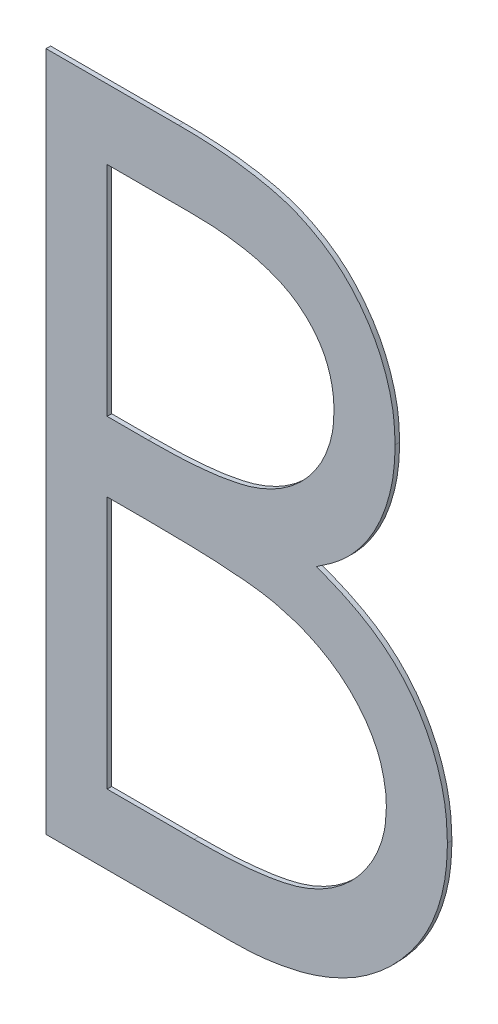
ISO-10303-21;
HEADER;
FILE_DESCRIPTION(('STEP AP214'),'2;1');
FILE_NAME('part.step','',(''),(''),'','','');
FILE_SCHEMA(('AUTOMOTIVE_DESIGN { 1 0 10303 214 1 1 1 1 }'));
ENDSEC;
DATA;
#1=APPLICATION_CONTEXT('core data for automotive mechanical design processes');
#2=APPLICATION_PROTOCOL_DEFINITION('international standard','automotive_design',2000,#1);
#3=PRODUCT_CONTEXT('',#1,'mechanical');
#4=PRODUCT('Part','Part','',(#3));
#5=PRODUCT_RELATED_PRODUCT_CATEGORY('part','',(#4));
#6=PRODUCT_DEFINITION_FORMATION('','',#4);
#7=PRODUCT_DEFINITION_CONTEXT('part definition',#1,'design');
#8=PRODUCT_DEFINITION('design','',#6,#7);
#9=PRODUCT_DEFINITION_SHAPE('','',#8);
#10=(LENGTH_UNIT() NAMED_UNIT(*) SI_UNIT(.MILLI.,.METRE.));
#11=(NAMED_UNIT(*) PLANE_ANGLE_UNIT() SI_UNIT($,.RADIAN.));
#12=(NAMED_UNIT(*) SI_UNIT($,.STERADIAN.) SOLID_ANGLE_UNIT());
#13=UNCERTAINTY_MEASURE_WITH_UNIT(LENGTH_MEASURE(1.E-05),#10,'distance_accuracy_value','');
#14=(GEOMETRIC_REPRESENTATION_CONTEXT(3) GLOBAL_UNCERTAINTY_ASSIGNED_CONTEXT((#13)) GLOBAL_UNIT_ASSIGNED_CONTEXT((#10,
#11,#12)) REPRESENTATION_CONTEXT('',''));
#15=CARTESIAN_POINT('',(0.,0.,0.));
#16=DIRECTION('',(0.,0.,1.));
#17=DIRECTION('',(1.,0.,0.));
#18=AXIS2_PLACEMENT_3D('',#15,#16,#17);
#19=CARTESIAN_POINT('',(2.93570461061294,16.6194775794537,0.));
#20=DIRECTION('',(0.,0.,1.));
#21=DIRECTION('',(1.,0.,0.));
#22=AXIS2_PLACEMENT_3D('',#19,#20,#21);
#23=PLANE('',#22);
#24=DIRECTION('',(0.,1.,0.));
#25=VECTOR('',#24,1.);
#26=CARTESIAN_POINT('',(-3.25397826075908,7.56722985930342,0.));
#27=LINE('',#26,#25);
#28=CARTESIAN_POINT('',(-3.25397826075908,0.484537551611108,0.));
#29=VERTEX_POINT('',#28);
#30=CARTESIAN_POINT('',(-3.25397826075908,7.56722985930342,0.));
#31=VERTEX_POINT('',#30);
#32=EDGE_CURVE('E460',#29,#31,#27,.T.);
#33=ORIENTED_EDGE('',*,*,#32,.F.);
#34=DIRECTION('',(1.,0.,0.));
#35=VECTOR('',#34,1.);
#36=CARTESIAN_POINT('',(-3.25397826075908,0.484537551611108,0.));
#37=LINE('',#36,#35);
#38=CARTESIAN_POINT('',(-0.819302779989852,0.484537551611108,0.));
#39=VERTEX_POINT('',#38);
#40=EDGE_CURVE('E172',#39,#29,#37,.F.);
#41=ORIENTED_EDGE('',*,*,#40,.F.);
#42=CARTESIAN_POINT('',(4.56140635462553,3.93811327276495,0.));
#43=CARTESIAN_POINT('',(4.56045237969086,3.91698360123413,0.));
#44=CARTESIAN_POINT('',(4.55949845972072,3.89585379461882,0.));
#45=CARTESIAN_POINT('',(4.55751645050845,3.85360120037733,0.));
#46=CARTESIAN_POINT('',(4.55648837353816,3.83247841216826,0.));
#47=CARTESIAN_POINT('',(4.55428159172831,3.7902035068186,0.));
#48=CARTESIAN_POINT('',(4.55310262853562,3.76905140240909,0.));
#49=CARTESIAN_POINT('',(4.55052009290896,3.72675632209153,0.));
#50=CARTESIAN_POINT('',(4.5491164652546,3.70561334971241,0.));
#51=CARTESIAN_POINT('',(4.54377705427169,3.63298116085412,0.));
#52=CARTESIAN_POINT('',(4.53910067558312,3.58153718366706,0.));
#53=CARTESIAN_POINT('',(4.52993179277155,3.50462360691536,0.));
#54=CARTESIAN_POINT('',(4.52651623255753,3.47902660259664,0.));
#55=CARTESIAN_POINT('',(4.51884079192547,3.42795971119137,0.));
#56=CARTESIAN_POINT('',(4.51458091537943,3.40248982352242,0.));
#57=CARTESIAN_POINT('',(4.50060355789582,3.3263068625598,0.));
#58=CARTESIAN_POINT('',(4.48968710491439,3.27581004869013,0.));
#59=CARTESIAN_POINT('',(4.46496478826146,3.17554941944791,0.));
#60=CARTESIAN_POINT('',(4.45115949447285,3.12578546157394,0.));
#61=CARTESIAN_POINT('',(4.42095158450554,3.02702007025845,0.));
#62=CARTESIAN_POINT('',(4.40454734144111,2.97801913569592,0.));
#63=CARTESIAN_POINT('',(4.36933399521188,2.88088611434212,0.));
#64=CARTESIAN_POINT('',(4.35052452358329,2.83275416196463,0.));
#65=CARTESIAN_POINT('',(4.29314053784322,2.6959468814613,0.));
#66=CARTESIAN_POINT('',(4.25162429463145,2.60848642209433,0.));
#67=CARTESIAN_POINT('',(4.160967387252,2.43762173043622,0.));
#68=CARTESIAN_POINT('',(4.11182579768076,2.35421799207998,0.));
#69=CARTESIAN_POINT('',(4.03315926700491,2.23228543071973,0.));
#70=CARTESIAN_POINT('',(4.00609254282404,2.19214548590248,0.));
#71=CARTESIAN_POINT('',(3.95043784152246,2.11293414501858,0.));
#72=CARTESIAN_POINT('',(3.92184980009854,2.07386279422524,0.));
#73=CARTESIAN_POINT('',(3.83385204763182,1.95839548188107,0.));
#74=CARTESIAN_POINT('',(3.77217450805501,1.88369328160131,0.));
#75=CARTESIAN_POINT('',(3.67535815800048,1.77611193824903,0.));
#76=CARTESIAN_POINT('',(3.6425201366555,1.74113819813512,0.));
#77=CARTESIAN_POINT('',(3.57535669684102,1.67266164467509,0.));
#78=CARTESIAN_POINT('',(3.54103153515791,1.63915857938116,0.));
#79=CARTESIAN_POINT('',(3.4361145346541,1.5409990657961,0.));
#80=CARTESIAN_POINT('',(3.3634419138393,1.47853803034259,0.));
#81=CARTESIAN_POINT('',(3.25100688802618,1.3894717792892,0.));
#82=CARTESIAN_POINT('',(3.21301398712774,1.3605917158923,0.));
#83=CARTESIAN_POINT('',(3.13589424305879,1.3043349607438,0.));
#84=CARTESIAN_POINT('',(3.09676671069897,1.27695921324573,0.));
#85=CARTESIAN_POINT('',(2.97755704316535,1.1970103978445,0.));
#86=CARTESIAN_POINT('',(2.89587038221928,1.1467919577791,0.));
#87=CARTESIAN_POINT('',(2.77062456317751,1.07644197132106,0.));
#88=CARTESIAN_POINT('',(2.72843509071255,1.05382702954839,0.));
#89=CARTESIAN_POINT('',(2.64319518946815,1.01027142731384,0.));
#90=CARTESIAN_POINT('',(2.60014472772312,0.989330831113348,0.));
#91=CARTESIAN_POINT('',(2.50034154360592,0.943188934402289,0.));
#92=CARTESIAN_POINT('',(2.44331841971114,0.918570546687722,0.));
#93=CARTESIAN_POINT('',(2.32808618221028,0.872287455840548,0.));
#94=CARTESIAN_POINT('',(2.26987705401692,0.85062278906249,0.));
#95=CARTESIAN_POINT('',(2.1523977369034,0.810246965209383,0.));
#96=CARTESIAN_POINT('',(2.09312681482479,0.791537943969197,0.));
#97=CARTESIAN_POINT('',(1.97376575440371,0.756928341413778,0.));
#98=CARTESIAN_POINT('',(1.91367546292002,0.741028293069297,0.));
#99=CARTESIAN_POINT('',(1.82302168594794,0.71871133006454,0.));
#100=CARTESIAN_POINT('',(1.79264541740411,0.711512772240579,0.));
#101=CARTESIAN_POINT('',(1.73178950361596,0.697566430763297,0.));
#102=CARTESIAN_POINT('',(1.70130985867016,0.690818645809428,0.));
#103=CARTESIAN_POINT('',(1.60973122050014,0.671278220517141,0.));
#104=CARTESIAN_POINT('',(1.54848024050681,0.65918549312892,0.));
#105=CARTESIAN_POINT('',(1.45633422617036,0.642560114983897,0.));
#106=CARTESIAN_POINT('',(1.42557377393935,0.637270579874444,0.));
#107=CARTESIAN_POINT('',(1.36397210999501,0.62718260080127,0.));
#108=CARTESIAN_POINT('',(1.33313089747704,0.622384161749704,0.));
#109=CARTESIAN_POINT('',(1.24051594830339,0.60857807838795,0.));
#110=CARTESIAN_POINT('',(1.17865500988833,0.600160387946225,0.));
#111=CARTESIAN_POINT('',(1.08324622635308,0.587824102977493,0.));
#112=CARTESIAN_POINT('',(1.04973436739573,0.583613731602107,0.));
#113=CARTESIAN_POINT('',(0.982690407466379,0.575368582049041,0.));
#114=CARTESIAN_POINT('',(0.949158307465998,0.571333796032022,0.));
#115=CARTESIAN_POINT('',(0.848530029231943,0.559583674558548,0.));
#116=CARTESIAN_POINT('',(0.781391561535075,0.55222122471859,0.));
#117=CARTESIAN_POINT('',(0.647186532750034,0.538899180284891,0.));
#118=CARTESIAN_POINT('',(0.580120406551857,0.532935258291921,0.));
#119=CARTESIAN_POINT('',(0.445877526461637,0.52242713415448,0.));
#120=CARTESIAN_POINT('',(0.378700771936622,0.517882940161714,0.));
#121=CARTESIAN_POINT('',(0.217550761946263,0.508486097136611,0.));
#122=CARTESIAN_POINT('',(0.123543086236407,0.504229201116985,0.));
#123=CARTESIAN_POINT('',(-0.064543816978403,0.497522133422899,0.));
#124=CARTESIAN_POINT('',(-0.158623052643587,0.495072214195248,0.));
#125=CARTESIAN_POINT('',(-0.347147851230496,0.491056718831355,0.));
#126=CARTESIAN_POINT('',(-0.441593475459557,0.48949446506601,0.));
#127=CARTESIAN_POINT('',(-0.630460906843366,0.486805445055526,0.));
#128=CARTESIAN_POINT('',(-0.724882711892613,0.485678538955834,0.));
#129=CARTESIAN_POINT('',(-0.819302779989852,0.484537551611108,0.));
#130=B_SPLINE_CURVE_WITH_KNOTS('',3,(#42,#43,#44,#45,#46,#47,#48,#49,#50,#51,#52,#53,#54,#55,
#56,#57,#58,#59,#60,#61,#62,#63,#64,#65,#66,#67,#68,#69,#70,#71,#72,#73,#74,#75,#76,#77,#78,#79,
#80,#81,#82,#83,#84,#85,#86,#87,#88,#89,#90,#91,#92,#93,#94,#95,#96,#97,#98,#99,#100,#101,#102,
#103,#104,#105,#106,#107,#108,#109,#110,#111,#112,#113,#114,#115,#116,#117,#118,#119,#120,#121,
#122,#123,#124,#125,#126,#127,#128,#129),.UNSPECIFIED.,.F.,.F.,(4,2,2,2,2,2,2,2,2,2,2,2,2,2,2,2,
2,2,2,2,2,2,2,2,2,2,2,2,2,2,2,2,2,2,2,2,2,2,2,2,2,2,2,4),(0.,0.0634537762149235,
0.12689707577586,0.19045049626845,0.25401956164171,0.408923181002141,0.486382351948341,
0.56384116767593,0.718727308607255,0.873582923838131,1.02853586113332,1.18351256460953,
1.47352147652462,1.76356561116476,1.90877311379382,2.05398675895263,2.34422533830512,
2.48810855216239,2.63196701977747,2.9190624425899,3.06220357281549,3.20543354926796,
3.49274276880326,3.636319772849,3.77990228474,3.96614973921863,4.15239948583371,
4.33878321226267,4.52520226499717,4.61885271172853,4.71250288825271,4.89976531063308,
4.99339767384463,5.08703097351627,5.27431008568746,5.37563616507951,5.47695771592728,
5.6795696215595,5.88154606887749,6.08352367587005,6.3658089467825,6.64813364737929,
6.93150819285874,7.21479162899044),.UNSPECIFIED.);
#131=CARTESIAN_POINT('',(4.56140635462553,3.93811327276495,0.));
#132=VERTEX_POINT('',#131);
#133=EDGE_CURVE('E310',#132,#39,#130,.T.);
#134=ORIENTED_EDGE('',*,*,#133,.F.);
#135=CARTESIAN_POINT('',(1.44364794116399,7.3420796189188,0.));
#136=CARTESIAN_POINT('',(1.4845035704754,7.3310987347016,0.));
#137=CARTESIAN_POINT('',(1.52535866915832,7.32011880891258,0.));
#138=CARTESIAN_POINT('',(1.60706426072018,7.29792300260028,0.));
#139=CARTESIAN_POINT('',(1.64791467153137,7.28670682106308,0.));
#140=CARTESIAN_POINT('',(1.77076486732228,7.25225636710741,0.));
#141=CARTESIAN_POINT('',(1.85258218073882,7.22834392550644,0.));
#142=CARTESIAN_POINT('',(1.97445775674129,7.18980440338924,0.));
#143=CARTESIAN_POINT('',(2.01493466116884,7.17651514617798,0.));
#144=CARTESIAN_POINT('',(2.09549940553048,7.148809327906,0.));
#145=CARTESIAN_POINT('',(2.13558722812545,7.1343927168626,0.));
#146=CARTESIAN_POINT('',(2.33477886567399,7.05924944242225,0.));
#147=CARTESIAN_POINT('',(2.49053341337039,6.98921209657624,0.));
#148=CARTESIAN_POINT('',(2.69045639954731,6.88535434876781,0.));
#149=CARTESIAN_POINT('',(2.73876639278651,6.85912432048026,0.));
#150=CARTESIAN_POINT('',(2.83438546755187,6.8049051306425,0.));
#151=CARTESIAN_POINT('',(2.88169470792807,6.77691625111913,0.));
#152=CARTESIAN_POINT('',(3.02188114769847,6.69016595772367,0.));
#153=CARTESIAN_POINT('',(3.11306396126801,6.62859679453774,0.));
#154=CARTESIAN_POINT('',(3.24540592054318,6.53014964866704,0.));
#155=CARTESIAN_POINT('',(3.28882608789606,6.49627812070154,0.));
#156=CARTESIAN_POINT('',(3.37403486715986,6.42653616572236,0.));
#157=CARTESIAN_POINT('',(3.41582347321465,6.39066573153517,0.));
#158=CARTESIAN_POINT('',(3.49775557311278,6.3170973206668,0.));
#159=CARTESIAN_POINT('',(3.53789907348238,6.27939935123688,0.));
#160=CARTESIAN_POINT('',(3.61651238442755,6.20229367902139,0.));
#161=CARTESIAN_POINT('',(3.65498211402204,6.16288589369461,0.));
#162=CARTESIAN_POINT('',(3.72259833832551,6.09068729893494,0.));
#163=CARTESIAN_POINT('',(3.75204957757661,6.05818103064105,0.));
#164=CARTESIAN_POINT('',(3.8097818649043,5.99214818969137,0.));
#165=CARTESIAN_POINT('',(3.83806305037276,5.95862173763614,0.));
#166=CARTESIAN_POINT('',(3.89323197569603,5.89042073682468,0.));
#167=CARTESIAN_POINT('',(3.92011929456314,5.85574584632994,0.));
#168=CARTESIAN_POINT('',(3.97234470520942,5.7852491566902,0.));
#169=CARTESIAN_POINT('',(3.99768280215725,5.74942736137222,0.));
#170=CARTESIAN_POINT('',(4.04683924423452,5.67686119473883,0.));
#171=CARTESIAN_POINT('',(4.07066047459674,5.64011877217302,0.));
#172=CARTESIAN_POINT('',(4.11689436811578,5.56575360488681,0.));
#173=CARTESIAN_POINT('',(4.1393068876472,5.52813077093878,0.));
#174=CARTESIAN_POINT('',(4.18271277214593,5.45213047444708,0.));
#175=CARTESIAN_POINT('',(4.20370763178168,5.41375386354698,0.));
#176=CARTESIAN_POINT('',(4.24439314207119,5.33631513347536,0.));
#177=CARTESIAN_POINT('',(4.26408379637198,5.29725301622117,0.));
#178=CARTESIAN_POINT('',(4.30186575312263,5.21795618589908,0.));
#179=CARTESIAN_POINT('',(4.31994269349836,5.17771450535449,0.));
#180=CARTESIAN_POINT('',(4.34520765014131,5.11659284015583,0.));
#181=CARTESIAN_POINT('',(4.353320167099,5.09609453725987,0.));
#182=CARTESIAN_POINT('',(4.3688798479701,5.05484699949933,0.));
#183=CARTESIAN_POINT('',(4.37632700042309,5.03409776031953,0.));
#184=CARTESIAN_POINT('',(4.39781623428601,4.97150106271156,0.));
#185=CARTESIAN_POINT('',(4.41098620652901,4.92935351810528,0.));
#186=CARTESIAN_POINT('',(4.42943628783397,4.86575616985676,0.));
#187=CARTESIAN_POINT('',(4.43537003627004,4.8444895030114,0.));
#188=CARTESIAN_POINT('',(4.44688517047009,4.8018608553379,0.));
#189=CARTESIAN_POINT('',(4.45246655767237,4.7804988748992,0.));
#190=CARTESIAN_POINT('',(4.46867272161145,4.71631225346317,0.));
#191=CARTESIAN_POINT('',(4.47876962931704,4.67335174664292,0.));
#192=CARTESIAN_POINT('',(4.49755274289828,4.58713834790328,0.));
#193=CARTESIAN_POINT('',(4.50623903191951,4.54388547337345,0.));
#194=CARTESIAN_POINT('',(4.52994695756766,4.41380585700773,0.));
#195=CARTESIAN_POINT('',(4.54266110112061,4.32648926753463,0.));
#196=CARTESIAN_POINT('',(4.55213025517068,4.21371706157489,0.));
#197=CARTESIAN_POINT('',(4.55379642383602,4.18866456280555,0.));
#198=CARTESIAN_POINT('',(4.55648283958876,4.13852041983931,0.));
#199=CARTESIAN_POINT('',(4.55750291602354,4.11342876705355,0.));
#200=CARTESIAN_POINT('',(4.55910972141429,4.06329556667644,0.));
#201=CARTESIAN_POINT('',(4.55969752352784,4.03825404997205,0.));
#202=CARTESIAN_POINT('',(4.56065878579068,3.98817885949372,0.));
#203=CARTESIAN_POINT('',(4.56103235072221,3.96314518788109,0.));
#204=CARTESIAN_POINT('',(4.56140635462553,3.93811327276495,0.));
#205=B_SPLINE_CURVE_WITH_KNOTS('',3,(#135,#136,#137,#138,#139,#140,#141,#142,#143,#144,#145,
#146,#147,#148,#149,#150,#151,#152,#153,#154,#155,#156,#157,#158,#159,#160,#161,#162,#163,#164,
#165,#166,#167,#168,#169,#170,#171,#172,#173,#174,#175,#176,#177,#178,#179,#180,#181,#182,#183,
#184,#185,#186,#187,#188,#189,#190,#191,#192,#193,#194,#195,#196,#197,#198,#199,#200,#201,#202,
#203,#204),.UNSPECIFIED.,.F.,.F.,(4,2,2,2,2,2,2,2,2,2,2,2,2,2,2,2,2,2,2,2,2,2,2,2,2,2,2,2,2,2,2,
2,2,2,4),(0.,0.126914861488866,0.254002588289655,0.509669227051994,0.637460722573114,
0.765257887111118,1.27603260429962,1.44093357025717,1.60580816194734,1.93539956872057,
2.10055562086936,2.26571226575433,2.43086825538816,2.59603222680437,2.72760057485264,
2.85915342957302,2.99074578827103,3.12233770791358,3.25367134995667,3.38501836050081,
3.51622465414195,3.6474305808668,3.77970716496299,3.84583209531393,3.91195816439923,
4.04436840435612,4.11060365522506,4.17683863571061,4.30919880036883,4.44155116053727,
4.70573324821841,4.78104489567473,4.85637642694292,4.93152030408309,5.00662739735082),.UNSPECIFIED.);
#206=CARTESIAN_POINT('',(1.44364794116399,7.3420796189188,0.));
#207=VERTEX_POINT('',#206);
#208=EDGE_CURVE('E317',#207,#132,#205,.T.);
#209=ORIENTED_EDGE('',*,*,#208,.F.);
#210=CARTESIAN_POINT('',(-2.12059484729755,7.56722985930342,0.));
#211=CARTESIAN_POINT('',(-2.07826102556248,7.56712356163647,0.));
#212=CARTESIAN_POINT('',(-2.0359272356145,7.56701694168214,0.));
#213=CARTESIAN_POINT('',(-1.95126095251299,7.56676267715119,0.));
#214=CARTESIAN_POINT('',(-1.90892845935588,7.56661503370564,0.));
#215=CARTESIAN_POINT('',(-1.781924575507,7.56604996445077,0.));
#216=CARTESIAN_POINT('',(-1.6972534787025,7.56551040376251,0.));
#217=CARTESIAN_POINT('',(-1.57025186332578,7.56420276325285,0.));
#218=CARTESIAN_POINT('',(-1.52791887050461,7.56368383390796,0.));
#219=CARTESIAN_POINT('',(-1.44325569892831,7.56245177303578,0.));
#220=CARTESIAN_POINT('',(-1.4009255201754,7.56173864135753,0.));
#221=CARTESIAN_POINT('',(-1.2739347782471,7.55939378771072,0.));
#222=CARTESIAN_POINT('',(-1.18927813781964,7.55755665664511,0.));
#223=CARTESIAN_POINT('',(-1.06229610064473,7.55467026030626,0.));
#224=CARTESIAN_POINT('',(-1.01996906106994,7.55368634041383,0.));
#225=CARTESIAN_POINT('',(-0.935314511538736,7.55173879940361,0.));
#226=CARTESIAN_POINT('',(-0.892987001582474,7.55077517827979,0.));
#227=CARTESIAN_POINT('',(-0.808312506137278,7.54879172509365,0.));
#228=CARTESIAN_POINT('',(-0.765965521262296,7.54777186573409,0.));
#229=CARTESIAN_POINT('',(-0.681276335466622,7.5455531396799,0.));
#230=CARTESIAN_POINT('',(-0.638934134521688,7.54435427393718,0.));
#231=CARTESIAN_POINT('',(-0.554262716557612,7.5416740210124,0.));
#232=CARTESIAN_POINT('',(-0.511933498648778,7.54019266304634,0.));
#233=CARTESIAN_POINT('',(-0.427291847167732,7.53680972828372,0.));
#234=CARTESIAN_POINT('',(-0.384979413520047,7.53490815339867,0.));
#235=CARTESIAN_POINT('',(-0.258101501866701,7.52863565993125,0.));
#236=CARTESIAN_POINT('',(-0.173564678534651,7.52369600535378,0.));
#237=CARTESIAN_POINT('',(-0.0467844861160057,7.51579786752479,0.));
#238=CARTESIAN_POINT('',(-0.00452455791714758,7.51308342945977,0.));
#239=CARTESIAN_POINT('',(0.079991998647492,7.50759554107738,0.));
#240=CARTESIAN_POINT('',(0.122248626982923,7.50482209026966,0.));
#241=CARTESIAN_POINT('',(0.21809849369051,7.49833250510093,0.));
#242=CARTESIAN_POINT('',(0.271688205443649,7.49456325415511,0.));
#243=CARTESIAN_POINT('',(0.378825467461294,7.48647780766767,0.));
#244=CARTESIAN_POINT('',(0.432373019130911,7.48216163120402,0.));
#245=CARTESIAN_POINT('',(0.539380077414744,7.47276613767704,0.));
#246=CARTESIAN_POINT('',(0.592839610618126,7.46768712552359,0.));
#247=CARTESIAN_POINT('',(0.699687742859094,7.45679811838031,0.));
#248=CARTESIAN_POINT('',(0.753076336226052,7.45098806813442,0.));
#249=CARTESIAN_POINT('',(0.859852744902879,7.43870045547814,0.));
#250=CARTESIAN_POINT('',(0.913240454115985,7.43222196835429,0.));
#251=CARTESIAN_POINT('',(1.01986198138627,7.41811279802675,0.));
#252=CARTESIAN_POINT('',(1.07309582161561,7.41048229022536,0.));
#253=CARTESIAN_POINT('',(1.15275541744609,7.39764916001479,0.));
#254=CARTESIAN_POINT('',(1.17929220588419,7.39313717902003,0.));
#255=CARTESIAN_POINT('',(1.23229025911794,7.38368140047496,0.));
#256=CARTESIAN_POINT('',(1.25875151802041,7.37873757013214,0.));
#257=CARTESIAN_POINT('',(1.31163461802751,7.36857679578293,0.));
#258=CARTESIAN_POINT('',(1.33805643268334,7.36335971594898,0.));
#259=CARTESIAN_POINT('',(1.39086848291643,7.35278895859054,0.));
#260=CARTESIAN_POINT('',(1.41725872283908,7.34743530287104,0.));
#261=CARTESIAN_POINT('',(1.44364794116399,7.3420796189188,0.));
#262=B_SPLINE_CURVE_WITH_KNOTS('',3,(#210,#211,#212,#213,#214,#215,#216,#217,#218,#219,#220,
#221,#222,#223,#224,#225,#226,#227,#228,#229,#230,#231,#232,#233,#234,#235,#236,#237,#238,#239,
#240,#241,#242,#243,#244,#245,#246,#247,#248,#249,#250,#251,#252,#253,#254,#255,#256,#257,#258,
#259,#260,#261),.UNSPECIFIED.,.F.,.F.,(4,2,2,2,2,2,2,2,2,2,2,2,2,2,2,2,2,2,2,2,2,2,2,2,2,4),(0.,
0.127001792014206,0.254000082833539,0.50801675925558,0.635024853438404,0.762033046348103,
1.01606181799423,1.1430772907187,1.27009272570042,1.3971703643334,1.52424732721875,
1.65131115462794,1.77837440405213,2.03240867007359,2.15945008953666,2.28649256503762,
2.44765747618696,2.60881676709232,2.76991181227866,2.93101904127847,3.09235221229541,
3.25366084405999,3.33440958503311,3.41516446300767,3.49595987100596,3.57674245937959),.UNSPECIFIED.);
#263=CARTESIAN_POINT('',(-2.12059484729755,7.56722985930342,0.));
#264=VERTEX_POINT('',#263);
#265=EDGE_CURVE('E323',#264,#207,#262,.T.);
#266=ORIENTED_EDGE('',*,*,#265,.F.);
#267=DIRECTION('',(1.,0.,0.));
#268=VECTOR('',#267,1.);
#269=CARTESIAN_POINT('',(-2.12059484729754,7.56722985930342,0.));
#270=LINE('',#269,#268);
#271=EDGE_CURVE('E454',#31,#264,#270,.T.);
#272=ORIENTED_EDGE('',*,*,#271,.F.);
#273=EDGE_LOOP('',(#33,#41,#134,#209,#266,#272));
#274=FACE_BOUND('',#273,.T.);
#275=DIRECTION('',(1.,0.,0.));
#276=VECTOR('',#275,1.);
#277=CARTESIAN_POINT('',(-4.96359364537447,17.580691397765,0.));
#278=LINE('',#277,#276);
#279=CARTESIAN_POINT('',(-1.2467066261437,17.580691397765,0.));
#280=VERTEX_POINT('',#279);
#281=CARTESIAN_POINT('',(-4.96359364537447,17.580691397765,0.));
#282=VERTEX_POINT('',#281);
#283=EDGE_CURVE('E490',#280,#282,#278,.F.);
#284=ORIENTED_EDGE('',*,*,#283,.F.);
#285=CARTESIAN_POINT('',(4.8056371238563,12.8601685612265,0.));
#286=CARTESIAN_POINT('',(4.80427605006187,12.9024445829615,0.));
#287=CARTESIAN_POINT('',(4.80291503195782,12.9447221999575,0.));
#288=CARTESIAN_POINT('',(4.79991895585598,13.0293377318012,0.));
#289=CARTESIAN_POINT('',(4.79828344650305,13.0716756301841,0.));
#290=CARTESIAN_POINT('',(4.79445220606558,13.1566553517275,0.));
#291=CARTESIAN_POINT('',(4.79225224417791,13.1992969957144,0.));
#292=CARTESIAN_POINT('',(4.78701448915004,13.2845299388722,0.));
#293=CARTESIAN_POINT('',(4.7839767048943,13.327121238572,0.));
#294=CARTESIAN_POINT('',(4.77679239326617,13.4122007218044,0.));
#295=CARTESIAN_POINT('',(4.77264619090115,13.4546889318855,0.));
#296=CARTESIAN_POINT('',(4.76293192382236,13.5395029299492,0.));
#297=CARTESIAN_POINT('',(4.75736390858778,13.5818287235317,0.));
#298=CARTESIAN_POINT('',(4.7448140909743,13.6662122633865,0.));
#299=CARTESIAN_POINT('',(4.73783416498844,13.7082702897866,0.));
#300=CARTESIAN_POINT('',(4.72256169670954,13.7921477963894,0.));
#301=CARTESIAN_POINT('',(4.71426908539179,13.8339672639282,0.));
#302=CARTESIAN_POINT('',(4.68752498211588,13.9590501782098,0.));
#303=CARTESIAN_POINT('',(4.6672100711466,14.0419194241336,0.));
#304=CARTESIAN_POINT('',(4.62242573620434,14.2060146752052,0.));
#305=CARTESIAN_POINT('',(4.59798027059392,14.2872472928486,0.));
#306=CARTESIAN_POINT('',(4.54488213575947,14.4483619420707,0.));
#307=CARTESIAN_POINT('',(4.51622804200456,14.5282435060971,0.));
#308=CARTESIAN_POINT('',(4.45461658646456,14.6863520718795,0.));
#309=CARTESIAN_POINT('',(4.42165829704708,14.7645787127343,0.));
#310=CARTESIAN_POINT('',(4.35145253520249,14.9190504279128,0.));
#311=CARTESIAN_POINT('',(4.31420659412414,14.9952961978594,0.));
#312=CARTESIAN_POINT('',(4.23553000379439,15.1455964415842,0.));
#313=CARTESIAN_POINT('',(4.19409939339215,15.2196509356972,0.));
#314=CARTESIAN_POINT('',(4.10709834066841,15.3653407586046,0.));
#315=CARTESIAN_POINT('',(4.06152582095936,15.4369748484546,0.));
#316=CARTESIAN_POINT('',(3.9793762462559,15.5585241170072,0.));
#317=CARTESIAN_POINT('',(3.94371233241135,15.609059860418,0.));
#318=CARTESIAN_POINT('',(3.87041597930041,15.7086904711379,0.));
#319=CARTESIAN_POINT('',(3.83278335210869,15.7577852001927,0.));
#320=CARTESIAN_POINT('',(3.75568770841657,15.854482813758,0.));
#321=CARTESIAN_POINT('',(3.71622547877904,15.9020863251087,0.));
#322=CARTESIAN_POINT('',(3.63547184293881,15.9957063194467,0.));
#323=CARTESIAN_POINT('',(3.59418051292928,16.0417228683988,0.));
#324=CARTESIAN_POINT('',(3.4785870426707,16.1650503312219,0.));
#325=CARTESIAN_POINT('',(3.40229948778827,16.240541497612,0.));
#326=CARTESIAN_POINT('',(3.28309204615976,16.3485306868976,0.));
#327=CARTESIAN_POINT('',(3.24254033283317,16.3836675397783,0.));
#328=CARTESIAN_POINT('',(3.15994487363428,16.4521496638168,0.));
#329=CARTESIAN_POINT('',(3.11790096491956,16.4854947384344,0.));
#330=CARTESIAN_POINT('',(2.98907407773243,16.5834796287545,0.));
#331=CARTESIAN_POINT('',(2.90026395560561,16.6454694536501,0.));
#332=CARTESIAN_POINT('',(2.71840428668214,16.7629718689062,0.));
#333=CARTESIAN_POINT('',(2.62535165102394,16.8184796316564,0.));
#334=CARTESIAN_POINT('',(2.43562461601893,16.9229665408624,0.));
#335=CARTESIAN_POINT('',(2.33894976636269,16.971944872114,0.));
#336=CARTESIAN_POINT('',(2.19170332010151,17.0404723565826,0.));
#337=CARTESIAN_POINT('',(2.14226225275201,17.0624863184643,0.));
#338=CARTESIAN_POINT('',(2.04262063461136,17.1047206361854,0.));
#339=CARTESIAN_POINT('',(1.99242019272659,17.124941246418,0.));
#340=CARTESIAN_POINT('',(1.91257900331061,17.1552364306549,0.));
#341=CARTESIAN_POINT('',(1.88319593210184,17.1659935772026,0.));
#342=CARTESIAN_POINT('',(1.82418434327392,17.1868104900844,0.));
#343=CARTESIAN_POINT('',(1.79455582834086,17.196870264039,0.));
#344=CARTESIAN_POINT('',(1.70535482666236,17.2260904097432,0.));
#345=CARTESIAN_POINT('',(1.64546711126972,17.2442915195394,0.));
#346=CARTESIAN_POINT('',(1.52512641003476,17.2785461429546,0.));
#347=CARTESIAN_POINT('',(1.46467377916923,17.2946009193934,0.));
#348=CARTESIAN_POINT('',(1.34331040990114,17.3248616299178,0.));
#349=CARTESIAN_POINT('',(1.28239967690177,17.3390675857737,0.));
#350=CARTESIAN_POINT('',(1.16040123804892,17.3658417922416,0.));
#351=CARTESIAN_POINT('',(1.09931451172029,17.3784145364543,0.));
#352=CARTESIAN_POINT('',(0.976872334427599,17.4021746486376,0.));
#353=CARTESIAN_POINT('',(0.915516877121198,17.4133619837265,0.));
#354=CARTESIAN_POINT('',(0.792582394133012,17.4345628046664,0.));
#355=CARTESIAN_POINT('',(0.731003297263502,17.4445758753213,0.));
#356=CARTESIAN_POINT('',(0.607680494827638,17.4635054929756,0.));
#357=CARTESIAN_POINT('',(0.545936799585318,17.4724221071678,0.));
#358=CARTESIAN_POINT('',(0.412409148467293,17.4902968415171,0.));
#359=CARTESIAN_POINT('',(0.34059527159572,17.499034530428,0.));
#360=CARTESIAN_POINT('',(0.196761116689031,17.5146450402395,0.));
#361=CARTESIAN_POINT('',(0.124740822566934,17.5215177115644,0.));
#362=CARTESIAN_POINT('',(-0.0194366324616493,17.5339107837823,0.));
#363=CARTESIAN_POINT('',(-0.0915938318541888,17.5394307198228,0.));
#364=CARTESIAN_POINT('',(-0.235963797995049,17.5496460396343,0.));
#365=CARTESIAN_POINT('',(-0.308176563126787,17.5543414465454,0.));
#366=CARTESIAN_POINT('',(-0.452559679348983,17.5626783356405,0.));
#367=CARTESIAN_POINT('',(-0.524729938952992,17.5663213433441,0.));
#368=CARTESIAN_POINT('',(-0.633027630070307,17.5707609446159,0.));
#369=CARTESIAN_POINT('',(-0.6691341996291,17.5720699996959,0.));
#370=CARTESIAN_POINT('',(-0.741359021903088,17.5743135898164,0.));
#371=CARTESIAN_POINT('',(-0.777477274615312,17.5752481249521,0.));
#372=CARTESIAN_POINT('',(-0.885771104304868,17.5776032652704,0.));
#373=CARTESIAN_POINT('',(-0.957955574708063,17.5785780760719,0.));
#374=CARTESIAN_POINT('',(-1.10233072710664,17.5799325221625,0.));
#375=CARTESIAN_POINT('',(-1.17452140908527,17.58031215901,0.));
#376=CARTESIAN_POINT('',(-1.2467066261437,17.580691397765,0.));
#377=B_SPLINE_CURVE_WITH_KNOTS('',3,(#285,#286,#287,#288,#289,#290,#291,#292,#293,#294,#295,
#296,#297,#298,#299,#300,#301,#302,#303,#304,#305,#306,#307,#308,#309,#310,#311,#312,#313,#314,
#315,#316,#317,#318,#319,#320,#321,#322,#323,#324,#325,#326,#327,#328,#329,#330,#331,#332,#333,
#334,#335,#336,#337,#338,#339,#340,#341,#342,#343,#344,#345,#346,#347,#348,#349,#350,#351,#352,
#353,#354,#355,#356,#357,#358,#359,#360,#361,#362,#363,#364,#365,#366,#367,#368,#369,#370,#371,
#372,#373,#374,#375,#376),.UNSPECIFIED.,.F.,.F.,(4,2,2,2,2,2,2,2,2,2,2,2,2,2,2,2,2,2,2,2,2,2,2,
2,2,2,2,2,2,2,2,2,2,2,2,2,2,2,2,2,2,2,2,2,2,4),(0.,0.126896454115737,0.254003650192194,
0.38209291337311,0.510180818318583,0.638231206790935,0.766277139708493,0.894154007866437,
1.02203760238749,1.27786147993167,1.5322494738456,1.78672377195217,2.04125300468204,
2.29569161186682,2.55012785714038,2.8046924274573,2.99020487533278,3.17573506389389,
3.36118618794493,3.54662959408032,3.86817884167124,4.02910253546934,4.19004384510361,
4.51461089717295,4.83941815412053,5.16426592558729,5.32660350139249,5.48891801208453,
5.58278069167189,5.67664234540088,5.86436638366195,6.05197948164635,6.23959037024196,
6.42667361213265,6.61376129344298,6.80091492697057,6.98805708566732,7.20506247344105,
7.42208526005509,7.63918251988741,7.85627368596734,8.07304856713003,8.1814377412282,
8.28982688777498,8.50639559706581,8.72296373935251),.UNSPECIFIED.);
#378=CARTESIAN_POINT('',(4.8056371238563,12.8601685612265,0.));
#379=VERTEX_POINT('',#378);
#380=EDGE_CURVE('E335',#379,#280,#377,.T.);
#381=ORIENTED_EDGE('',*,*,#380,.F.);
#382=CARTESIAN_POINT('',(2.60374409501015,8.80746423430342,0.));
#383=CARTESIAN_POINT('',(2.63897758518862,8.83086659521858,0.));
#384=CARTESIAN_POINT('',(2.67420991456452,8.85426853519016,0.));
#385=CARTESIAN_POINT('',(2.74459520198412,8.90132534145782,0.));
#386=CARTESIAN_POINT('',(2.77974790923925,8.92498058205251,0.));
#387=CARTESIAN_POINT('',(2.88526976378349,8.99691628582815,0.));
#388=CARTESIAN_POINT('',(2.95520787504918,9.04584668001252,0.));
#389=CARTESIAN_POINT('',(3.0582529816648,9.12177118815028,0.));
#390=CARTESIAN_POINT('',(3.09228874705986,9.14749900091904,0.));
#391=CARTESIAN_POINT('',(3.15957204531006,9.19996744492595,0.));
#392=CARTESIAN_POINT('',(3.19281957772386,9.22670807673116,0.));
#393=CARTESIAN_POINT('',(3.25844094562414,9.28116524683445,0.));
#394=CARTESIAN_POINT('',(3.29081574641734,9.30888062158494,0.));
#395=CARTESIAN_POINT('',(3.35466779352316,9.36532811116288,0.));
#396=CARTESIAN_POINT('',(3.38614502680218,9.39406024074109,0.));
#397=CARTESIAN_POINT('',(3.44814878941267,9.45255151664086,0.));
#398=CARTESIAN_POINT('',(3.47867505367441,9.48231094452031,0.));
#399=CARTESIAN_POINT('',(3.53868514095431,9.54285876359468,0.));
#400=CARTESIAN_POINT('',(3.56816897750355,9.57364714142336,0.));
#401=CARTESIAN_POINT('',(3.68141608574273,9.6960145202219,0.));
#402=CARTESIAN_POINT('',(3.76121796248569,9.79131136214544,0.));
#403=CARTESIAN_POINT('',(3.87485258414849,9.93885224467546,0.));
#404=CARTESIAN_POINT('',(3.91173446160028,9.9888216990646,0.));
#405=CARTESIAN_POINT('',(3.98359780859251,10.0901168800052,0.));
#406=CARTESIAN_POINT('',(4.018579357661,10.1414425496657,0.));
#407=CARTESIAN_POINT('',(4.08658455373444,10.2456758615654,0.));
#408=CARTESIAN_POINT('',(4.11959960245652,10.2985891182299,0.));
#409=CARTESIAN_POINT('',(4.18333829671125,10.4057731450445,0.));
#410=CARTESIAN_POINT('',(4.21406208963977,10.4600438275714,0.));
#411=CARTESIAN_POINT('',(4.30246332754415,10.6247719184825,0.));
#412=CARTESIAN_POINT('',(4.35643368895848,10.7372410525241,0.));
#413=CARTESIAN_POINT('',(4.45422552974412,10.9646215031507,0.));
#414=CARTESIAN_POINT('',(4.49817741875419,11.079477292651,0.));
#415=CARTESIAN_POINT('',(4.55756387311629,11.2540098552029,0.));
#416=CARTESIAN_POINT('',(4.57627698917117,11.3125925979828,0.));
#417=CARTESIAN_POINT('',(4.61155889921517,11.4304048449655,0.));
#418=CARTESIAN_POINT('',(4.62812761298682,11.4896343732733,0.));
#419=CARTESIAN_POINT('',(4.65918046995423,11.6085214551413,0.));
#420=CARTESIAN_POINT('',(4.67366832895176,11.6681780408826,0.));
#421=CARTESIAN_POINT('',(4.70050197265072,11.7879737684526,0.));
#422=CARTESIAN_POINT('',(4.71284774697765,11.848112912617,0.));
#423=CARTESIAN_POINT('',(4.73514513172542,11.9687712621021,0.));
#424=CARTESIAN_POINT('',(4.74509924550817,12.0292900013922,0.));
#425=CARTESIAN_POINT('',(4.76235135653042,12.1506994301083,0.));
#426=CARTESIAN_POINT('',(4.76964977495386,12.2115900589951,0.));
#427=CARTESIAN_POINT('',(4.78035305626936,12.3214416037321,0.));
#428=CARTESIAN_POINT('',(4.78424440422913,12.3703565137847,0.));
#429=CARTESIAN_POINT('',(4.79078259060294,12.4682796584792,0.));
#430=CARTESIAN_POINT('',(4.79342906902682,12.5172879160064,0.));
#431=CARTESIAN_POINT('',(4.79787720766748,12.6152834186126,0.));
#432=CARTESIAN_POINT('',(4.79967983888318,12.6642706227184,0.));
#433=CARTESIAN_POINT('',(4.80286641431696,12.7622292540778,0.));
#434=CARTESIAN_POINT('',(4.80425061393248,12.8112006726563,0.));
#435=CARTESIAN_POINT('',(4.8056371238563,12.8601685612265,0.));
#436=B_SPLINE_CURVE_WITH_KNOTS('',3,(#382,#383,#384,#385,#386,#387,#388,#389,#390,#391,#392,
#393,#394,#395,#396,#397,#398,#399,#400,#401,#402,#403,#404,#405,#406,#407,#408,#409,#410,#411,
#412,#413,#414,#415,#416,#417,#418,#419,#420,#421,#422,#423,#424,#425,#426,#427,#428,#429,#430,
#431,#432,#433,#434,#435),.UNSPECIFIED.,.F.,.F.,(4,2,2,2,2,2,2,2,2,2,2,2,2,2,2,2,2,2,2,2,2,2,2,
2,2,2,4),(0.,0.126889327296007,0.254003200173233,0.50999867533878,0.637978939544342,
0.765959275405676,0.893791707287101,1.02162599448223,1.14949560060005,1.27736354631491,
1.64962380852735,1.83591955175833,2.02220749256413,2.20925779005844,2.3962960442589,
2.7700300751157,3.13857923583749,3.32304179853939,3.50751125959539,3.69164710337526,
3.87578383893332,4.05972698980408,4.24364095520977,4.3908266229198,4.53805482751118,
4.68511320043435,4.8320816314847),.UNSPECIFIED.);
#437=CARTESIAN_POINT('',(2.60374409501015,8.80746423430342,0.));
#438=VERTEX_POINT('',#437);
#439=EDGE_CURVE('E286',#438,#379,#436,.T.);
#440=ORIENTED_EDGE('',*,*,#439,.F.);
#441=CARTESIAN_POINT('',(6.27102173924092,3.93811327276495,0.));
#442=CARTESIAN_POINT('',(6.27038774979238,3.95925697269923,0.));
#443=CARTESIAN_POINT('',(6.26975371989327,3.9804006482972,0.));
#444=CARTESIAN_POINT('',(6.26845335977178,4.02268515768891,0.));
#445=CARTESIAN_POINT('',(6.26778703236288,4.0438259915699,0.));
#446=CARTESIAN_POINT('',(6.26638879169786,4.08613496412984,0.));
#447=CARTESIAN_POINT('',(6.26565678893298,4.10730310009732,0.));
#448=CARTESIAN_POINT('',(6.26409494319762,4.14963738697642,0.));
#449=CARTESIAN_POINT('',(6.2632650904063,4.17080353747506,0.));
#450=CARTESIAN_POINT('',(6.25877348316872,4.27711762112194,0.));
#451=CARTESIAN_POINT('',(6.25413501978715,4.36224048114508,0.));
#452=CARTESIAN_POINT('',(6.24396986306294,4.48967115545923,0.));
#453=CARTESIAN_POINT('',(6.24004706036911,4.53210455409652,0.));
#454=CARTESIAN_POINT('',(6.23105757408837,4.61684997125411,0.));
#455=CARTESIAN_POINT('',(6.22599085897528,4.65916198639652,0.));
#456=CARTESIAN_POINT('',(6.20911539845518,4.78577751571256,0.));
#457=CARTESIAN_POINT('',(6.19562310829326,4.86986409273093,0.));
#458=CARTESIAN_POINT('',(6.16407276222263,5.03717574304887,0.));
#459=CARTESIAN_POINT('',(6.14601440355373,5.12040075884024,0.));
#460=CARTESIAN_POINT('',(6.10571206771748,5.28546797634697,0.));
#461=CARTESIAN_POINT('',(6.08348551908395,5.36731444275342,0.));
#462=CARTESIAN_POINT('',(6.04728229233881,5.48923965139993,0.));
#463=CARTESIAN_POINT('',(6.03473425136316,5.52974942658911,0.));
#464=CARTESIAN_POINT('',(6.00869542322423,5.61046929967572,0.));
#465=CARTESIAN_POINT('',(5.99520455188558,5.65067937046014,0.));
#466=CARTESIAN_POINT('',(5.95848338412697,5.75585135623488,0.));
#467=CARTESIAN_POINT('',(5.93444729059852,5.82053505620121,0.));
#468=CARTESIAN_POINT('',(5.88363568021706,5.94881155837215,0.));
#469=CARTESIAN_POINT('',(5.85686021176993,6.01240437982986,0.));
#470=CARTESIAN_POINT('',(5.77239546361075,6.20134707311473,0.));
#471=CARTESIAN_POINT('',(5.71056287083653,6.32487554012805,0.));
#472=CARTESIAN_POINT('',(5.61324272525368,6.50169345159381,0.));
#473=CARTESIAN_POINT('',(5.58144568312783,6.55706825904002,0.));
#474=CARTESIAN_POINT('',(5.51572070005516,6.66654217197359,0.));
#475=CARTESIAN_POINT('',(5.48179299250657,6.72064141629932,0.));
#476=CARTESIAN_POINT('',(5.41167264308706,6.82734385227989,0.));
#477=CARTESIAN_POINT('',(5.37548027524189,6.87994722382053,0.));
#478=CARTESIAN_POINT('',(5.30077695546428,6.98348406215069,0.));
#479=CARTESIAN_POINT('',(5.262265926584,7.03441747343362,0.));
#480=CARTESIAN_POINT('',(5.1839499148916,7.13347173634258,0.));
#481=CARTESIAN_POINT('',(5.14419197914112,7.18162980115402,0.));
#482=CARTESIAN_POINT('',(5.06272848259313,7.27626185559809,0.));
#483=CARTESIAN_POINT('',(5.02102290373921,7.32273582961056,0.));
#484=CARTESIAN_POINT('',(4.89309280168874,7.45951601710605,0.));
#485=CARTESIAN_POINT('',(4.80402893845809,7.54721330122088,0.));
#486=CARTESIAN_POINT('',(4.66533633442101,7.67274017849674,0.));
#487=CARTESIAN_POINT('',(4.61833468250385,7.71351926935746,0.));
#488=CARTESIAN_POINT('',(4.52268193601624,7.79310129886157,0.));
#489=CARTESIAN_POINT('',(4.4740308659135,7.8319042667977,0.));
#490=CARTESIAN_POINT('',(4.37508205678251,7.90755156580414,0.));
#491=CARTESIAN_POINT('',(4.32478132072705,7.94439197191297,0.));
#492=CARTESIAN_POINT('',(4.22273402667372,8.01601300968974,0.));
#493=CARTESIAN_POINT('',(4.17098742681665,8.0507935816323,0.));
#494=CARTESIAN_POINT('',(4.0661677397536,8.11848374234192,0.));
#495=CARTESIAN_POINT('',(4.01309262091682,8.15139017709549,0.));
#496=CARTESIAN_POINT('',(3.90587541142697,8.21540432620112,0.));
#497=CARTESIAN_POINT('',(3.85173336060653,8.24651210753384,0.));
#498=CARTESIAN_POINT('',(3.70164492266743,8.32974770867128,0.));
#499=CARTESIAN_POINT('',(3.60475093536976,8.38017448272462,0.));
#500=CARTESIAN_POINT('',(3.4085592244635,8.47621537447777,0.));
#501=CARTESIAN_POINT('',(3.3092603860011,8.52182720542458,0.));
#502=CARTESIAN_POINT('',(3.10927586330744,8.60850821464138,0.));
#503=CARTESIAN_POINT('',(3.00859873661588,8.64959746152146,0.));
#504=CARTESIAN_POINT('',(2.8065067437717,8.7296036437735,0.));
#505=CARTESIAN_POINT('',(2.70509283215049,8.76852296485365,0.));
#506=CARTESIAN_POINT('',(2.60374409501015,8.80746423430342,0.));
#507=B_SPLINE_CURVE_WITH_KNOTS('',3,(#441,#442,#443,#444,#445,#446,#447,#448,#449,#450,#451,
#452,#453,#454,#455,#456,#457,#458,#459,#460,#461,#462,#463,#464,#465,#466,#467,#468,#469,#470,
#471,#472,#473,#474,#475,#476,#477,#478,#479,#480,#481,#482,#483,#484,#485,#486,#487,#488,#489,
#490,#491,#492,#493,#494,#495,#496,#497,#498,#499,#500,#501,#502,#503,#504,#505,#506),
.UNSPECIFIED.,.F.,.F.,(4,2,2,2,2,2,2,2,2,2,2,2,2,2,2,2,2,2,2,2,2,2,2,2,2,2,2,2,2,2,2,2,4),(0.,
0.0634595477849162,0.126913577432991,0.19045544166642,0.254003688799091,0.509672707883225,
0.637499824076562,0.765330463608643,1.02068041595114,1.27604730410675,1.53036931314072,
1.65758610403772,1.78481426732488,1.99176428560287,2.19871064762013,2.61255792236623,
2.80409491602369,2.99561096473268,3.18710388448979,3.37860316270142,3.56589325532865,
3.75318508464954,4.12764356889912,4.31428080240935,4.50091526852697,4.68790996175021,
4.87491007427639,5.06221611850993,5.24951518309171,5.57705406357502,5.90474780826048,
6.23092322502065,6.5567326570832),.UNSPECIFIED.);
#508=CARTESIAN_POINT('',(6.27102173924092,3.93811327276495,0.));
#509=VERTEX_POINT('',#508);
#510=EDGE_CURVE('E277',#509,#438,#507,.T.);
#511=ORIENTED_EDGE('',*,*,#510,.F.);
#512=CARTESIAN_POINT('',(0.18814914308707,-1.46930860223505,0.));
#513=CARTESIAN_POINT('',(0.230471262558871,-1.4686738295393,0.));
#514=CARTESIAN_POINT('',(0.272792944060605,-1.468039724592,0.));
#515=CARTESIAN_POINT('',(0.357447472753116,-1.46660574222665,0.));
#516=CARTESIAN_POINT('',(0.399780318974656,-1.46580580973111,0.));
#517=CARTESIAN_POINT('',(0.526993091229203,-1.46290193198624,0.));
#518=CARTESIAN_POINT('',(0.611865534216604,-1.46029547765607,0.));
#519=CARTESIAN_POINT('',(0.739078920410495,-1.4543913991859,0.));
#520=CARTESIAN_POINT('',(0.781464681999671,-1.45209119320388,0.));
#521=CARTESIAN_POINT('',(0.866181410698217,-1.44663708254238,0.));
#522=CARTESIAN_POINT('',(0.908512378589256,-1.44348319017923,0.));
#523=CARTESIAN_POINT('',(0.993101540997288,-1.4363103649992,0.));
#524=CARTESIAN_POINT('',(1.03535973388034,-1.43229141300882,0.));
#525=CARTESIAN_POINT('',(1.11979428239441,-1.423468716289,0.));
#526=CARTESIAN_POINT('',(1.16197063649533,-1.41866495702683,0.));
#527=CARTESIAN_POINT('',(1.28838354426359,-1.40314944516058,0.));
#528=CARTESIAN_POINT('',(1.37248541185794,-1.39133507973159,0.));
#529=CARTESIAN_POINT('',(1.54033447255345,-1.36533021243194,0.));
#530=CARTESIAN_POINT('',(1.62408158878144,-1.35113922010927,0.));
#531=CARTESIAN_POINT('',(1.79108292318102,-1.3201315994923,0.));
#532=CARTESIAN_POINT('',(1.87433720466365,-1.30331531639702,0.));
#533=CARTESIAN_POINT('',(2.04018407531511,-1.26660200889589,0.));
#534=CARTESIAN_POINT('',(2.12277654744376,-1.24670445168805,0.));
#535=CARTESIAN_POINT('',(2.28707437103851,-1.20353668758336,0.));
#536=CARTESIAN_POINT('',(2.36877976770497,-1.18026665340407,0.));
#537=CARTESIAN_POINT('',(2.52784374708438,-1.13122291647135,0.));
#538=CARTESIAN_POINT('',(2.60524492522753,-1.1055876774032,0.));
#539=CARTESIAN_POINT('',(2.7588476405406,-1.05094035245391,0.));
#540=CARTESIAN_POINT('',(2.83504916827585,-1.02192824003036,0.));
#541=CARTESIAN_POINT('',(2.98613320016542,-0.960750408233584,0.));
#542=CARTESIAN_POINT('',(3.06101624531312,-0.92858601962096,0.));
#543=CARTESIAN_POINT('',(3.20948714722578,-0.861380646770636,0.));
#544=CARTESIAN_POINT('',(3.28307490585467,-0.826339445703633,0.));
#545=CARTESIAN_POINT('',(3.42025162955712,-0.757476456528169,0.));
#546=CARTESIAN_POINT('',(3.48400731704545,-0.723987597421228,0.));
#547=CARTESIAN_POINT('',(3.61002865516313,-0.654336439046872,0.));
#548=CARTESIAN_POINT('',(3.67229466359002,-0.618174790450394,0.));
#549=CARTESIAN_POINT('',(3.79510586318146,-0.542946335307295,0.));
#550=CARTESIAN_POINT('',(3.85564986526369,-0.503877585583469,0.));
#551=CARTESIAN_POINT('',(3.94519605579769,-0.443390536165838,0.));
#552=CARTESIAN_POINT('',(3.97483834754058,-0.422910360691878,0.));
#553=CARTESIAN_POINT('',(4.03370757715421,-0.381357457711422,0.));
#554=CARTESIAN_POINT('',(4.06293448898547,-0.360284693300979,0.));
#555=CARTESIAN_POINT('',(4.15062400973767,-0.295819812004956,0.));
#556=CARTESIAN_POINT('',(4.20847996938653,-0.251599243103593,0.));
#557=CARTESIAN_POINT('',(4.32253469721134,-0.161066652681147,0.));
#558=CARTESIAN_POINT('',(4.37873340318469,-0.114754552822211,0.));
#559=CARTESIAN_POINT('',(4.48922883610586,-0.0198647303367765,0.));
#560=CARTESIAN_POINT('',(4.54352484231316,0.0287138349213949,0.));
#561=CARTESIAN_POINT('',(4.64990348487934,0.128229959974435,0.));
#562=CARTESIAN_POINT('',(4.70198626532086,0.179167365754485,0.));
#563=CARTESIAN_POINT('',(4.80405945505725,0.283126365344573,0.));
#564=CARTESIAN_POINT('',(4.85404907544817,0.336148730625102,0.));
#565=CARTESIAN_POINT('',(4.95216565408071,0.443900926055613,0.));
#566=CARTESIAN_POINT('',(5.00029228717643,0.498631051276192,0.));
#567=CARTESIAN_POINT('',(5.0947177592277,0.609619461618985,0.));
#568=CARTESIAN_POINT('',(5.14101716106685,0.665877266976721,0.));
#569=CARTESIAN_POINT('',(5.23138801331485,0.780140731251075,0.));
#570=CARTESIAN_POINT('',(5.27546000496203,0.838145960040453,0.));
#571=CARTESIAN_POINT('',(5.36433151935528,0.960670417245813,0.));
#572=CARTESIAN_POINT('',(5.4089184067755,1.02534431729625,0.));
#573=CARTESIAN_POINT('',(5.49494767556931,1.15673319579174,0.));
#574=CARTESIAN_POINT('',(5.53639054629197,1.22344785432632,0.));
#575=CARTESIAN_POINT('',(5.61609217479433,1.35860246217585,0.));
#576=CARTESIAN_POINT('',(5.65435610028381,1.42703936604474,0.));
#577=CARTESIAN_POINT('',(5.72764273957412,1.56563118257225,0.));
#578=CARTESIAN_POINT('',(5.76266544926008,1.63578609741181,0.));
#579=CARTESIAN_POINT('',(5.82500189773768,1.76876366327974,0.));
#580=CARTESIAN_POINT('',(5.85273045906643,1.8313919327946,0.));
#581=CARTESIAN_POINT('',(5.90541066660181,1.95780296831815,0.));
#582=CARTESIAN_POINT('',(5.93036240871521,2.02158569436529,0.));
#583=CARTESIAN_POINT('',(5.97760493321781,2.15020413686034,0.));
#584=CARTESIAN_POINT('',(5.99989282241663,2.21504091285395,0.));
#585=CARTESIAN_POINT('',(6.04186498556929,2.34555634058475,0.));
#586=CARTESIAN_POINT('',(6.0615490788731,2.41123505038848,0.));
#587=CARTESIAN_POINT('',(6.09641306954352,2.53659750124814,0.));
#588=CARTESIAN_POINT('',(6.1118475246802,2.5962105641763,0.));
#589=CARTESIAN_POINT('',(6.1405388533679,2.7159665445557,0.));
#590=CARTESIAN_POINT('',(6.15379547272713,2.77610952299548,0.));
#591=CARTESIAN_POINT('',(6.1780904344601,2.89687475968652,0.));
#592=CARTESIAN_POINT('',(6.1891276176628,2.95749725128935,0.));
#593=CARTESIAN_POINT('',(6.20893263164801,3.07910078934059,0.));
#594=CARTESIAN_POINT('',(6.21770086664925,3.1400817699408,0.));
#595=CARTESIAN_POINT('',(6.2329206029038,3.26231224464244,0.));
#596=CARTESIAN_POINT('',(6.23937291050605,3.3235616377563,0.));
#597=CARTESIAN_POINT('',(6.24992880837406,3.44627590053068,0.));
#598=CARTESIAN_POINT('',(6.25403172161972,3.50774082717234,0.));
#599=CARTESIAN_POINT('',(6.2606721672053,3.63069821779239,0.));
#600=CARTESIAN_POINT('',(6.26321090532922,3.69219062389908,0.));
#601=CARTESIAN_POINT('',(6.26750673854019,3.81516262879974,0.));
#602=CARTESIAN_POINT('',(6.26926436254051,3.87664220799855,0.));
#603=CARTESIAN_POINT('',(6.27102173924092,3.93811327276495,0.));
#604=B_SPLINE_CURVE_WITH_KNOTS('',3,(#512,#513,#514,#515,#516,#517,#518,#519,#520,#521,#522,
#523,#524,#525,#526,#527,#528,#529,#530,#531,#532,#533,#534,#535,#536,#537,#538,#539,#540,#541,
#542,#543,#544,#545,#546,#547,#548,#549,#550,#551,#552,#553,#554,#555,#556,#557,#558,#559,#560,
#561,#562,#563,#564,#565,#566,#567,#568,#569,#570,#571,#572,#573,#574,#575,#576,#577,#578,#579,
#580,#581,#582,#583,#584,#585,#586,#587,#588,#589,#590,#591,#592,#593,#594,#595,#596,#597,#598,
#599,#600,#601,#602,#603),.UNSPECIFIED.,.F.,.F.,(4,2,2,2,2,2,2,2,2,2,2,2,2,2,2,2,2,2,2,2,2,2,2,
2,2,2,2,2,2,2,2,2,2,2,2,2,2,2,2,2,2,2,2,2,2,4),(0.,0.12697955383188,0.25400135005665,
0.508710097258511,0.636047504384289,0.763383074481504,0.890721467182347,1.01806221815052,
1.27279949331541,1.52758940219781,1.78234583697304,2.0371463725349,2.29193386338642,
2.5364666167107,2.78100129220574,3.02543317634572,3.26988350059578,3.48587639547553,
3.70181688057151,3.9179030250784,4.02598483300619,4.13407338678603,4.35248116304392,
4.57089712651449,4.78939495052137,5.00787852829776,5.22644372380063,5.44504689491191,
5.66358219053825,5.88206412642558,6.11763196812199,6.35316306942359,6.58830347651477,
6.8234441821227,7.02885592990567,7.23426058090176,7.43988633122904,7.64552634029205,
7.83022323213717,8.01494166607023,8.19975632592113,8.38453803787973,8.56925535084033,
8.75402586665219,8.9386537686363,9.1231564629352),.UNSPECIFIED.);
#605=CARTESIAN_POINT('',(0.18814914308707,-1.46930860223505,0.));
#606=VERTEX_POINT('',#605);
#607=EDGE_CURVE('E23',#606,#509,#604,.T.);
#608=ORIENTED_EDGE('',*,*,#607,.F.);
#609=DIRECTION('',(1.,0.,0.));
#610=VECTOR('',#609,1.);
#611=CARTESIAN_POINT('',(0.18814914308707,-1.46930860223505,0.));
#612=LINE('',#611,#610);
#613=CARTESIAN_POINT('',(-4.96359364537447,-1.46930860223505,0.));
#614=VERTEX_POINT('',#613);
#615=EDGE_CURVE('E129',#614,#606,#612,.T.);
#616=ORIENTED_EDGE('',*,*,#615,.F.);
#617=DIRECTION('',(0.,1.,0.));
#618=VECTOR('',#617,1.);
#619=CARTESIAN_POINT('',(-4.96359364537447,-1.46930860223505,0.));
#620=LINE('',#619,#618);
#621=EDGE_CURVE('E536',#282,#614,#620,.F.);
#622=ORIENTED_EDGE('',*,*,#621,.F.);
#623=EDGE_LOOP('',(#284,#381,#440,#511,#608,#616,#622));
#624=FACE_BOUND('',#623,.T.);
#625=DIRECTION('',(0.,1.,0.));
#626=VECTOR('',#625,1.);
#627=CARTESIAN_POINT('',(-3.25397826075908,15.6268452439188,0.));
#628=LINE('',#627,#626);
#629=CARTESIAN_POINT('',(-3.25397826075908,9.52107601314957,0.));
#630=VERTEX_POINT('',#629);
#631=CARTESIAN_POINT('',(-3.25397826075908,15.6268452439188,0.));
#632=VERTEX_POINT('',#631);
#633=EDGE_CURVE('E486',#630,#632,#628,.T.);
#634=ORIENTED_EDGE('',*,*,#633,.F.);
#635=DIRECTION('',(1.,0.,0.));
#636=VECTOR('',#635,1.);
#637=CARTESIAN_POINT('',(-3.25397826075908,9.52107601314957,0.));
#638=LINE('',#637,#636);
#639=CARTESIAN_POINT('',(-2.10533042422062,9.52107601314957,0.));
#640=VERTEX_POINT('',#639);
#641=EDGE_CURVE('E464',#640,#630,#638,.F.);
#642=ORIENTED_EDGE('',*,*,#641,.F.);
#643=CARTESIAN_POINT('',(3.09602173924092,12.8258236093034,0.));
#644=CARTESIAN_POINT('',(3.09529361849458,12.8046851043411,0.));
#645=CARTESIAN_POINT('',(3.09456553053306,12.7835466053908,0.));
#646=CARTESIAN_POINT('',(3.09302648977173,12.7412746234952,0.));
#647=CARTESIAN_POINT('',(3.09221554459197,12.7201411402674,0.));
#648=CARTESIAN_POINT('',(3.0904262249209,12.6778441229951,0.));
#649=CARTESIAN_POINT('',(3.0894475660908,12.6566805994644,0.));
#650=CARTESIAN_POINT('',(3.08723904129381,12.6143646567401,0.));
#651=CARTESIAN_POINT('',(3.08600912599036,12.5932122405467,0.));
#652=CARTESIAN_POINT('',(3.07984617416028,12.4999099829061,0.));
#653=CARTESIAN_POINT('',(3.07313705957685,12.4278255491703,0.));
#654=CARTESIAN_POINT('',(3.05239838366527,12.2846979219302,0.));
#655=CARTESIAN_POINT('',(3.03836940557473,12.2136546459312,0.));
#656=CARTESIAN_POINT('',(3.00451168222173,12.0730665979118,0.));
#657=CARTESIAN_POINT('',(2.98468621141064,12.003521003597,0.));
#658=CARTESIAN_POINT('',(2.95177333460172,11.900207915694,0.));
#659=CARTESIAN_POINT('',(2.94026762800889,11.865923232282,0.));
#660=CARTESIAN_POINT('',(2.91620970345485,11.7977237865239,0.));
#661=CARTESIAN_POINT('',(2.90365750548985,11.7638090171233,0.));
#662=CARTESIAN_POINT('',(2.86438156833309,11.6629269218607,0.));
#663=CARTESIAN_POINT('',(2.83596835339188,11.5965984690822,0.));
#664=CARTESIAN_POINT('',(2.7896109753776,11.4989236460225,0.));
#665=CARTESIAN_POINT('',(2.77354111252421,11.466677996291,0.));
#666=CARTESIAN_POINT('',(2.74013410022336,11.4028497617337,0.));
#667=CARTESIAN_POINT('',(2.72279692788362,11.3712671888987,0.));
#668=CARTESIAN_POINT('',(2.66901534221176,11.2774806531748,0.));
#669=CARTESIAN_POINT('',(2.63081711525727,11.2162718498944,0.));
#670=CARTESIAN_POINT('',(2.57050465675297,11.1264863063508,0.));
#671=CARTESIAN_POINT('',(2.54988890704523,11.096884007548,0.));
#672=CARTESIAN_POINT('',(2.50773105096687,11.0383461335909,0.));
#673=CARTESIAN_POINT('',(2.48618892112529,11.009410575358,0.));
#674=CARTESIAN_POINT('',(2.41222919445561,10.9133291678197,0.));
#675=CARTESIAN_POINT('',(2.35769534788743,10.8477804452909,0.));
#676=CARTESIAN_POINT('',(2.27212080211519,10.7529104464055,0.));
#677=CARTESIAN_POINT('',(2.24296808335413,10.7218636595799,0.));
#678=CARTESIAN_POINT('',(2.18341021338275,10.6609942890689,0.));
#679=CARTESIAN_POINT('',(2.15300506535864,10.6311717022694,0.));
#680=CARTESIAN_POINT('',(2.06000723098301,10.5435634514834,0.));
#681=CARTESIAN_POINT('',(1.99563943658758,10.4876453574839,0.));
#682=CARTESIAN_POINT('',(1.86284272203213,10.3808951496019,0.));
#683=CARTESIAN_POINT('',(1.79441378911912,10.330063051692,0.));
#684=CARTESIAN_POINT('',(1.64878917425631,10.230232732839,0.));
#685=CARTESIAN_POINT('',(1.5713174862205,10.1816338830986,0.));
#686=CARTESIAN_POINT('',(1.45223426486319,10.1137832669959,0.));
#687=CARTESIAN_POINT('',(1.41204571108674,10.0920007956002,0.));
#688=CARTESIAN_POINT('',(1.33080175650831,10.0501170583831,0.));
#689=CARTESIAN_POINT('',(1.2897463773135,10.0300157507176,0.));
#690=CARTESIAN_POINT('',(1.20694944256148,9.99139727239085,0.));
#691=CARTESIAN_POINT('',(1.16520860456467,9.97287855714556,0.));
#692=CARTESIAN_POINT('',(1.08109973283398,9.9373112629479,0.));
#693=CARTESIAN_POINT('',(1.03873160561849,9.92026290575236,0.));
#694=CARTESIAN_POINT('',(0.953522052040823,9.88749855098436,0.));
#695=CARTESIAN_POINT('',(0.910681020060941,9.87178152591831,0.));
#696=CARTESIAN_POINT('',(0.824461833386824,9.84191261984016,0.));
#697=CARTESIAN_POINT('',(0.781083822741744,9.82776032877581,0.));
#698=CARTESIAN_POINT('',(0.713888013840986,9.80753115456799,0.));
#699=CARTESIAN_POINT('',(0.690283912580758,9.80074214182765,0.));
#700=CARTESIAN_POINT('',(0.642919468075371,9.78773277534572,0.));
#701=CARTESIAN_POINT('',(0.619159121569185,9.78151243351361,0.));
#702=CARTESIAN_POINT('',(0.547702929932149,9.76352860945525,0.));
#703=CARTESIAN_POINT('',(0.499837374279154,9.75244392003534,0.));
#704=CARTESIAN_POINT('',(0.427895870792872,9.73654471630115,0.));
#705=CARTESIAN_POINT('',(0.403896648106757,9.73136731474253,0.));
#706=CARTESIAN_POINT('',(0.355863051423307,9.7211781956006,0.));
#707=CARTESIAN_POINT('',(0.331828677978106,9.71616647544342,0.));
#708=CARTESIAN_POINT('',(0.259671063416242,9.70141956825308,0.));
#709=CARTESIAN_POINT('',(0.211488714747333,9.69197161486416,0.));
#710=CARTESIAN_POINT('',(0.116815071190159,9.67428757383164,0.));
#711=CARTESIAN_POINT('',(0.0703298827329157,9.66601888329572,0.));
#712=CARTESIAN_POINT('',(-0.022792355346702,9.65038325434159,0.));
#713=CARTESIAN_POINT('',(-0.0694294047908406,9.6430163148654,0.));
#714=CARTESIAN_POINT('',(-0.162855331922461,9.62926431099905,0.));
#715=CARTESIAN_POINT('',(-0.209644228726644,9.62287937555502,0.));
#716=CARTESIAN_POINT('',(-0.30336084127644,9.61123241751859,0.));
#717=CARTESIAN_POINT('',(-0.350288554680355,9.60597037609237,0.));
#718=CARTESIAN_POINT('',(-0.491237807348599,9.59149112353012,0.));
#719=CARTESIAN_POINT('',(-0.585388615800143,9.58358595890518,0.));
#720=CARTESIAN_POINT('',(-0.726635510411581,9.57210014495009,0.));
#721=CARTESIAN_POINT('',(-0.773721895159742,9.56833348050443,0.));
#722=CARTESIAN_POINT('',(-0.867916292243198,9.56108031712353,0.));
#723=CARTESIAN_POINT('',(-0.915024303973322,9.55759381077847,0.));
#724=CARTESIAN_POINT('',(-1.00974560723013,9.55108863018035,0.));
#725=CARTESIAN_POINT('',(-1.05735925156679,9.54807496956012,0.));
#726=CARTESIAN_POINT('',(-1.15262863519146,9.54280833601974,0.));
#727=CARTESIAN_POINT('',(-1.20028437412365,9.54055535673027,0.));
#728=CARTESIAN_POINT('',(-1.29561973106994,9.53669062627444,0.));
#729=CARTESIAN_POINT('',(-1.34329934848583,9.5350788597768,0.));
#730=CARTESIAN_POINT('',(-1.43867213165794,9.53230108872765,0.));
#731=CARTESIAN_POINT('',(-1.48636529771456,9.5311350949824,0.));
#732=CARTESIAN_POINT('',(-1.58166340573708,9.52905920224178,0.));
#733=CARTESIAN_POINT('',(-1.62926833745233,9.5281488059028,0.));
#734=CARTESIAN_POINT('',(-1.72448080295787,9.52646839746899,0.));
#735=CARTESIAN_POINT('',(-1.77208833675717,9.52569838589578,0.));
#736=CARTESIAN_POINT('',(-1.86730152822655,9.52426142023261,0.));
#737=CARTESIAN_POINT('',(-1.91490718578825,9.52359445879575,0.));
#738=CARTESIAN_POINT('',(-2.01011872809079,9.52231076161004,0.));
#739=CARTESIAN_POINT('',(-2.05772461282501,9.5216940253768,0.));
#740=CARTESIAN_POINT('',(-2.10533042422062,9.52107601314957,0.));
#741=B_SPLINE_CURVE_WITH_KNOTS('',3,(#643,#644,#645,#646,#647,#648,#649,#650,#651,#652,#653,
#654,#655,#656,#657,#658,#659,#660,#661,#662,#663,#664,#665,#666,#667,#668,#669,#670,#671,#672,
#673,#674,#675,#676,#677,#678,#679,#680,#681,#682,#683,#684,#685,#686,#687,#688,#689,#690,#691,
#692,#693,#694,#695,#696,#697,#698,#699,#700,#701,#702,#703,#704,#705,#706,#707,#708,#709,#710,
#711,#712,#713,#714,#715,#716,#717,#718,#719,#720,#721,#722,#723,#724,#725,#726,#727,#728,#729,
#730,#731,#732,#733,#734,#735,#736,#737,#738,#739,#740),.UNSPECIFIED.,.F.,.F.,(4,2,2,2,2,2,2,2,
2,2,2,2,2,2,2,2,2,2,2,2,2,2,2,2,2,2,2,2,2,2,2,2,2,2,2,2,2,2,2,2,2,2,2,2,2,2,2,2,4),(0.,
0.0634530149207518,0.12690019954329,0.190456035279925,0.254024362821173,0.47093425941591,
0.687826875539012,0.904597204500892,1.01307577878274,1.1215522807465,1.33780422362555,
1.44586367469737,1.55392507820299,1.77016059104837,1.878367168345,1.98657648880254,
2.24206774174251,2.36980437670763,2.49754068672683,2.7530457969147,3.00855170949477,
3.28256038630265,3.41966267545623,3.55676155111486,3.69372505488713,3.8307091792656,
3.96758660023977,4.10442806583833,4.17810390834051,4.2517812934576,4.39915305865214,
4.47280749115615,4.54646077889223,4.69375318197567,4.83538991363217,4.97702647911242,
5.11868162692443,5.26033439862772,5.54375146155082,5.68546384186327,5.82717247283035,
5.97029467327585,6.11341567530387,6.25653325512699,6.39965430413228,6.5424949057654,
6.68533603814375,6.82816698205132,6.9709965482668),.UNSPECIFIED.);
#742=CARTESIAN_POINT('',(3.09602173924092,12.8258236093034,0.));
#743=VERTEX_POINT('',#742);
#744=EDGE_CURVE('E301',#743,#640,#741,.T.);
#745=ORIENTED_EDGE('',*,*,#744,.F.);
#746=CARTESIAN_POINT('',(-0.933785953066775,15.6268452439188,0.));
#747=CARTESIAN_POINT('',(-0.891471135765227,15.6262923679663,0.));
#748=CARTESIAN_POINT('',(-0.849156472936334,15.625740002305,0.));
#749=CARTESIAN_POINT('',(-0.764498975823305,15.6244840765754,0.));
#750=CARTESIAN_POINT('',(-0.722156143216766,15.6237804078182,0.));
#751=CARTESIAN_POINT('',(-0.594920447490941,15.6212105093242,0.));
#752=CARTESIAN_POINT('',(-0.510034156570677,15.6188866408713,0.));
#753=CARTESIAN_POINT('',(-0.340363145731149,15.6118201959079,0.));
#754=CARTESIAN_POINT('',(-0.255578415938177,15.6070778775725,0.));
#755=CARTESIAN_POINT('',(-0.0862968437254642,15.5945133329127,0.));
#756=CARTESIAN_POINT('',(-0.00179982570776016,15.5866935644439,0.));
#757=CARTESIAN_POINT('',(0.166795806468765,15.5675124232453,0.));
#758=CARTESIAN_POINT('',(0.250894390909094,15.556150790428,0.));
#759=CARTESIAN_POINT('',(0.376644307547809,15.537170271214,0.));
#760=CARTESIAN_POINT('',(0.418449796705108,15.5305286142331,0.));
#761=CARTESIAN_POINT('',(0.501974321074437,15.5167192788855,0.));
#762=CARTESIAN_POINT('',(0.543693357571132,15.5095516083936,0.));
#763=CARTESIAN_POINT('',(0.627073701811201,15.4944699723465,0.));
#764=CARTESIAN_POINT('',(0.668734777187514,15.4865547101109,0.));
#765=CARTESIAN_POINT('',(0.751854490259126,15.469729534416,0.));
#766=CARTESIAN_POINT('',(0.793313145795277,15.4608197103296,0.));
#767=CARTESIAN_POINT('',(0.876361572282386,15.4416119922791,0.));
#768=CARTESIAN_POINT('',(0.917948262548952,15.4313006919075,0.));
#769=CARTESIAN_POINT('',(1.00077580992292,15.4093637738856,0.));
#770=CARTESIAN_POINT('',(1.0420166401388,15.3977380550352,0.));
#771=CARTESIAN_POINT('',(1.12418231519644,15.3733278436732,0.));
#772=CARTESIAN_POINT('',(1.16510692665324,15.3605425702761,0.));
#773=CARTESIAN_POINT('',(1.24664235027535,15.3340013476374,0.));
#774=CARTESIAN_POINT('',(1.28725314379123,15.3202453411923,0.));
#775=CARTESIAN_POINT('',(1.36796871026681,15.2916204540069,0.));
#776=CARTESIAN_POINT('',(1.40807450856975,15.2767544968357,0.));
#777=CARTESIAN_POINT('',(1.4876956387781,15.2455306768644,0.));
#778=CARTESIAN_POINT('',(1.52721105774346,15.2291730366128,0.));
#779=CARTESIAN_POINT('',(1.64447535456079,15.1774040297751,0.));
#780=CARTESIAN_POINT('',(1.72105002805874,15.1392605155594,0.));
#781=CARTESIAN_POINT('',(1.8266536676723,15.0806031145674,0.));
#782=CARTESIAN_POINT('',(1.85725906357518,15.0628501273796,0.));
#783=CARTESIAN_POINT('',(1.91779985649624,15.0262252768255,0.));
#784=CARTESIAN_POINT('',(1.94773522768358,15.0073533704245,0.));
#785=CARTESIAN_POINT('',(2.00688906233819,14.9684154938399,0.));
#786=CARTESIAN_POINT('',(2.03610628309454,14.948347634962,0.));
#787=CARTESIAN_POINT('',(2.09367967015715,14.9069998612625,0.));
#788=CARTESIAN_POINT('',(2.12203568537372,14.8857197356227,0.));
#789=CARTESIAN_POINT('',(2.1782078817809,14.841633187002,0.));
#790=CARTESIAN_POINT('',(2.20601011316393,14.8188090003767,0.));
#791=CARTESIAN_POINT('',(2.26066932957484,14.7720472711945,0.));
#792=CARTESIAN_POINT('',(2.28752610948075,14.7481094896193,0.));
#793=CARTESIAN_POINT('',(2.3403452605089,14.6992542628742,0.));
#794=CARTESIAN_POINT('',(2.36630739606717,14.67433656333,0.));
#795=CARTESIAN_POINT('',(2.417260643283,14.623529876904,0.));
#796=CARTESIAN_POINT('',(2.44225185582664,14.5976409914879,0.));
#797=CARTESIAN_POINT('',(2.49103257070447,14.5447746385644,0.));
#798=CARTESIAN_POINT('',(2.51482272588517,14.5177977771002,0.));
#799=CARTESIAN_POINT('',(2.56095896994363,14.4626397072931,0.));
#800=CARTESIAN_POINT('',(2.5833052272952,14.4344586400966,0.));
#801=CARTESIAN_POINT('',(2.62657526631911,14.3770468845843,0.));
#802=CARTESIAN_POINT('',(2.64749960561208,14.3478166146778,0.));
#803=CARTESIAN_POINT('',(2.68809634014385,14.2884886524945,0.));
#804=CARTESIAN_POINT('',(2.70776830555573,14.2583906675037,0.));
#805=CARTESIAN_POINT('',(2.74555974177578,14.1980609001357,0.));
#806=CARTESIAN_POINT('',(2.76370223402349,14.1678435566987,0.));
#807=CARTESIAN_POINT('',(2.79854757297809,14.1065994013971,0.));
#808=CARTESIAN_POINT('',(2.81525107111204,14.0755729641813,0.));
#809=CARTESIAN_POINT('',(2.83901435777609,14.0283794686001,0.));
#810=CARTESIAN_POINT('',(2.84672125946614,14.0125367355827,0.));
#811=CARTESIAN_POINT('',(2.86166107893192,13.9806293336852,0.));
#812=CARTESIAN_POINT('',(2.86889399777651,13.9645646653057,0.));
#813=CARTESIAN_POINT('',(2.8899346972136,13.9160768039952,0.));
#814=CARTESIAN_POINT('',(2.90308144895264,13.8833656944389,0.));
#815=CARTESIAN_POINT('',(2.92792166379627,13.8173429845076,0.));
#816=CARTESIAN_POINT('',(2.93961267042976,13.7840304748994,0.));
#817=CARTESIAN_POINT('',(2.96187745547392,13.7170353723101,0.));
#818=CARTESIAN_POINT('',(2.97245120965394,13.6833527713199,0.));
#819=CARTESIAN_POINT('',(2.99244527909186,13.6156425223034,0.));
#820=CARTESIAN_POINT('',(3.00186551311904,13.5816148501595,0.));
#821=CARTESIAN_POINT('',(3.01939418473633,13.5132284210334,0.));
#822=CARTESIAN_POINT('',(3.02750284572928,13.4788697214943,0.));
#823=CARTESIAN_POINT('',(3.04579977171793,13.393440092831,0.));
#824=CARTESIAN_POINT('',(3.05514521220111,13.3421862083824,0.));
#825=CARTESIAN_POINT('',(3.07065147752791,13.2392031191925,0.));
#826=CARTESIAN_POINT('',(3.07681278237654,13.1874739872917,0.));
#827=CARTESIAN_POINT('',(3.08590933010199,13.0841142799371,0.));
#828=CARTESIAN_POINT('',(3.08886647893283,13.0324854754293,0.));
#829=CARTESIAN_POINT('',(3.09321843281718,12.929161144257,0.));
#830=CARTESIAN_POINT('',(3.09461345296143,12.8774656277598,0.));
#831=CARTESIAN_POINT('',(3.09602173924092,12.8258236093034,0.));
#832=B_SPLINE_CURVE_WITH_KNOTS('',3,(#746,#747,#748,#749,#750,#751,#752,#753,#754,#755,#756,
#757,#758,#759,#760,#761,#762,#763,#764,#765,#766,#767,#768,#769,#770,#771,#772,#773,#774,#775,
#776,#777,#778,#779,#780,#781,#782,#783,#784,#785,#786,#787,#788,#789,#790,#791,#792,#793,#794,
#795,#796,#797,#798,#799,#800,#801,#802,#803,#804,#805,#806,#807,#808,#809,#810,#811,#812,#813,
#814,#815,#816,#817,#818,#819,#820,#821,#822,#823,#824,#825,#826,#827,#828,#829,#830,#831),
.UNSPECIFIED.,.F.,.F.,(4,2,2,2,2,2,2,2,2,2,2,2,2,2,2,2,2,2,2,2,2,2,2,2,2,2,2,2,2,2,2,2,2,2,2,2,
2,2,2,2,2,2,4),(0.,0.126954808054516,0.254001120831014,0.508735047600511,0.763441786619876,
1.01794551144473,1.27246792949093,1.39945582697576,1.52644182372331,1.65365226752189,
1.78085128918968,1.90936622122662,2.03789105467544,2.16650309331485,2.29512271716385,
2.42341476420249,2.55168770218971,2.80789390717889,2.91402451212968,3.02015920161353,
3.12646618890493,3.23279172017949,3.34067145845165,3.44857445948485,3.55650565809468,
3.66442561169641,3.77228625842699,3.88013429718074,3.98793979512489,4.09578209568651,
4.20148992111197,4.30714963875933,4.35999645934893,4.41284316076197,4.5185564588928,
4.62444579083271,4.73033741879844,4.83623649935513,4.94211752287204,5.09831310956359,
5.25448514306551,5.4095825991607,5.56465869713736),.UNSPECIFIED.);
#833=CARTESIAN_POINT('',(-0.933785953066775,15.6268452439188,0.));
#834=VERTEX_POINT('',#833);
#835=EDGE_CURVE('E329',#834,#743,#832,.T.);
#836=ORIENTED_EDGE('',*,*,#835,.F.);
#837=DIRECTION('',(1.,0.,0.));
#838=VECTOR('',#837,1.);
#839=CARTESIAN_POINT('',(-0.933785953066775,15.6268452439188,0.));
#840=LINE('',#839,#838);
#841=EDGE_CURVE('E480',#632,#834,#840,.T.);
#842=ORIENTED_EDGE('',*,*,#841,.F.);
#843=EDGE_LOOP('',(#634,#642,#745,#836,#842));
#844=FACE_BOUND('',#843,.T.);
#845=ADVANCED_FACE('F16',(#274,#624,#844),#23,.F.);
#846=CARTESIAN_POINT('',(-4.96359364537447,-1.46930860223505,0.127));
#847=DIRECTION('',(-1.,0.,0.));
#848=DIRECTION('',(0.,0.,1.));
#849=AXIS2_PLACEMENT_3D('',#846,#847,#848);
#850=PLANE('',#849);
#851=DIRECTION('',(0.,1.,0.));
#852=VECTOR('',#851,1.);
#853=CARTESIAN_POINT('',(-4.96359364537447,16.6194775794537,0.127));
#854=LINE('',#853,#852);
#855=CARTESIAN_POINT('',(-4.96359364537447,17.580691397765,0.127));
#856=VERTEX_POINT('',#855);
#857=CARTESIAN_POINT('',(-4.96359364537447,-1.46930860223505,0.127));
#858=VERTEX_POINT('',#857);
#859=EDGE_CURVE('E441',#856,#858,#854,.F.);
#860=ORIENTED_EDGE('',*,*,#859,.F.);
#861=DIRECTION('',(0.,0.,1.));
#862=VECTOR('',#861,1.);
#863=CARTESIAN_POINT('',(-4.96359364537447,17.580691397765,0.127));
#864=LINE('',#863,#862);
#865=EDGE_CURVE('E487',#282,#856,#864,.T.);
#866=ORIENTED_EDGE('',*,*,#865,.F.);
#867=ORIENTED_EDGE('',*,*,#621,.T.);
#868=DIRECTION('',(0.,0.,-1.));
#869=VECTOR('',#868,1.);
#870=CARTESIAN_POINT('',(-4.96359364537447,-1.46930860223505,0.127));
#871=LINE('',#870,#869);
#872=EDGE_CURVE('E505',#858,#614,#871,.T.);
#873=ORIENTED_EDGE('',*,*,#872,.F.);
#874=EDGE_LOOP('',(#860,#866,#867,#873));
#875=FACE_BOUND('',#874,.T.);
#876=ADVANCED_FACE('F295',(#875),#850,.T.);
#877=CARTESIAN_POINT('',(0.18814914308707,-1.46930860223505,0.127));
#878=DIRECTION('',(0.,-1.,0.));
#879=DIRECTION('',(0.,0.,-1.));
#880=AXIS2_PLACEMENT_3D('',#877,#878,#879);
#881=PLANE('',#880);
#882=DIRECTION('',(1.,0.,0.));
#883=VECTOR('',#882,1.);
#884=CARTESIAN_POINT('',(2.93570461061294,-1.46930860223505,0.127));
#885=LINE('',#884,#883);
#886=CARTESIAN_POINT('',(0.18814914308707,-1.46930860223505,0.127));
#887=VERTEX_POINT('',#886);
#888=EDGE_CURVE('E438',#858,#887,#885,.T.);
#889=ORIENTED_EDGE('',*,*,#888,.F.);
#890=ORIENTED_EDGE('',*,*,#872,.T.);
#891=ORIENTED_EDGE('',*,*,#615,.T.);
#892=DIRECTION('',(0.,0.,-1.));
#893=VECTOR('',#892,1.);
#894=CARTESIAN_POINT('',(0.18814914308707,-1.46930860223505,0.0635));
#895=LINE('',#894,#893);
#896=EDGE_CURVE('E285',#887,#606,#895,.T.);
#897=ORIENTED_EDGE('',*,*,#896,.F.);
#898=EDGE_LOOP('',(#889,#890,#891,#897));
#899=FACE_BOUND('',#898,.T.);
#900=ADVANCED_FACE('F541',(#899),#881,.T.);
#901=CARTESIAN_POINT('',(6.27102173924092,3.93811327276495,0.127));
#902=CARTESIAN_POINT('',(6.27102173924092,3.93811327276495,0.));
#903=CARTESIAN_POINT('',(6.26570490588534,3.75214786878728,0.127));
#904=CARTESIAN_POINT('',(6.26570490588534,3.75214786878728,0.));
#905=CARTESIAN_POINT('',(6.2552438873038,3.38625572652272,0.127));
#906=CARTESIAN_POINT('',(6.2552438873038,3.38625572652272,0.));
#907=CARTESIAN_POINT('',(6.1780643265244,2.84874563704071,0.127));
#908=CARTESIAN_POINT('',(6.1780643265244,2.84874563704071,0.));
#909=CARTESIAN_POINT('',(6.04738618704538,2.33507628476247,0.127));
#910=CARTESIAN_POINT('',(6.04738618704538,2.33507628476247,0.));
#911=CARTESIAN_POINT('',(5.86738466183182,1.8419252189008,0.127));
#912=CARTESIAN_POINT('',(5.86738466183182,1.8419252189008,0.));
#913=CARTESIAN_POINT('',(5.63245834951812,1.37024648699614,0.127));
#914=CARTESIAN_POINT('',(5.63245834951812,1.37024648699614,0.));
#915=CARTESIAN_POINT('',(5.34655614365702,0.919505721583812,0.127));
#916=CARTESIAN_POINT('',(5.34655614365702,0.919505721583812,0.));
#917=CARTESIAN_POINT('',(5.00566149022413,0.494231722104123,0.127));
#918=CARTESIAN_POINT('',(5.00566149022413,0.494231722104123,0.));
#919=CARTESIAN_POINT('',(4.62431930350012,0.0896988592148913,0.127));
#920=CARTESIAN_POINT('',(4.62431930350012,0.0896988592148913,0.));
#921=CARTESIAN_POINT('',(4.19290676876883,-0.274035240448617,0.127));
#922=CARTESIAN_POINT('',(4.19290676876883,-0.274035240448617,0.));
#923=CARTESIAN_POINT('',(3.72745673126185,-0.597970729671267,0.127));
#924=CARTESIAN_POINT('',(3.72745673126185,-0.597970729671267,0.));
#925=CARTESIAN_POINT('',(3.22210747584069,-0.864377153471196,0.127));
#926=CARTESIAN_POINT('',(3.22210747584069,-0.864377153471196,0.));
#927=CARTESIAN_POINT('',(2.68515876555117,-1.08816578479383,0.127));
#928=CARTESIAN_POINT('',(2.68515876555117,-1.08816578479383,0.));
#929=CARTESIAN_POINT('',(2.11058727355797,-1.25911067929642,0.127));
#930=CARTESIAN_POINT('',(2.11058727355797,-1.25911067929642,0.));
#931=CARTESIAN_POINT('',(1.50097308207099,-1.37870426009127,0.127));
#932=CARTESIAN_POINT('',(1.50097308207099,-1.37870426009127,0.));
#933=CARTESIAN_POINT('',(0.856841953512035,-1.45928596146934,0.127));
#934=CARTESIAN_POINT('',(0.856841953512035,-1.45928596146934,0.));
#935=CARTESIAN_POINT('',(0.414828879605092,-1.46591103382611,0.127));
#936=CARTESIAN_POINT('',(0.414828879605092,-1.46591103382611,0.));
#937=CARTESIAN_POINT('',(0.18814914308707,-1.46930860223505,0.127));
#938=CARTESIAN_POINT('',(0.18814914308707,-1.46930860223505,0.));
#939=B_SPLINE_SURFACE_WITH_KNOTS('',3,1,((#901,#902),(#903,#904),(#905,#906),(#907,#908),(#909,
#910),(#911,#912),(#913,#914),(#915,#916),(#917,#918),(#919,#920),(#921,#922),(#923,#924),(#925,
#926),(#927,#928),(#929,#930),(#931,#932),(#933,#934),(#935,#936),(#937,#938)),.UNSPECIFIED.,
.F.,.F.,.F.,(4,1,1,1,1,1,1,1,1,1,1,1,1,1,1,1,4),(2,2),(0.,0.0611602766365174,0.120334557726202,
0.178180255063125,0.235235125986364,0.29268296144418,0.35118624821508,0.410456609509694,
0.471719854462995,0.533761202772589,0.595739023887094,0.657887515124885,0.721295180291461,
0.786822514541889,0.854686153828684,0.925477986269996,1.),(0.,1.),.UNSPECIFIED.);
#940=CARTESIAN_POINT('',(0.18814914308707,-1.46930860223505,0.127));
#941=CARTESIAN_POINT('',(0.230471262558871,-1.4686738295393,0.127));
#942=CARTESIAN_POINT('',(0.272792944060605,-1.468039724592,0.127));
#943=CARTESIAN_POINT('',(0.357447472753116,-1.46660574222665,0.127));
#944=CARTESIAN_POINT('',(0.399780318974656,-1.46580580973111,0.127));
#945=CARTESIAN_POINT('',(0.526993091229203,-1.46290193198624,0.127));
#946=CARTESIAN_POINT('',(0.611865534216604,-1.46029547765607,0.127));
#947=CARTESIAN_POINT('',(0.739078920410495,-1.4543913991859,0.127));
#948=CARTESIAN_POINT('',(0.781464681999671,-1.45209119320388,0.127));
#949=CARTESIAN_POINT('',(0.866181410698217,-1.44663708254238,0.127));
#950=CARTESIAN_POINT('',(0.908512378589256,-1.44348319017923,0.127));
#951=CARTESIAN_POINT('',(0.993101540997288,-1.4363103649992,0.127));
#952=CARTESIAN_POINT('',(1.03535973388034,-1.43229141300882,0.127));
#953=CARTESIAN_POINT('',(1.11979428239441,-1.423468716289,0.127));
#954=CARTESIAN_POINT('',(1.16197063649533,-1.41866495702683,0.127));
#955=CARTESIAN_POINT('',(1.28838354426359,-1.40314944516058,0.127));
#956=CARTESIAN_POINT('',(1.37248541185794,-1.39133507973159,0.127));
#957=CARTESIAN_POINT('',(1.54033447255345,-1.36533021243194,0.127));
#958=CARTESIAN_POINT('',(1.62408158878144,-1.35113922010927,0.127));
#959=CARTESIAN_POINT('',(1.79108292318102,-1.3201315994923,0.127));
#960=CARTESIAN_POINT('',(1.87433720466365,-1.30331531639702,0.127));
#961=CARTESIAN_POINT('',(2.04018407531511,-1.26660200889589,0.127));
#962=CARTESIAN_POINT('',(2.12277654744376,-1.24670445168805,0.127));
#963=CARTESIAN_POINT('',(2.28707437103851,-1.20353668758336,0.127));
#964=CARTESIAN_POINT('',(2.36877976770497,-1.18026665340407,0.127));
#965=CARTESIAN_POINT('',(2.52784374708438,-1.13122291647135,0.127));
#966=CARTESIAN_POINT('',(2.60524492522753,-1.1055876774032,0.127));
#967=CARTESIAN_POINT('',(2.7588476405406,-1.05094035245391,0.127));
#968=CARTESIAN_POINT('',(2.83504916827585,-1.02192824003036,0.127));
#969=CARTESIAN_POINT('',(2.98613320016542,-0.960750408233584,0.127));
#970=CARTESIAN_POINT('',(3.06101624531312,-0.92858601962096,0.127));
#971=CARTESIAN_POINT('',(3.20948714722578,-0.861380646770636,0.127));
#972=CARTESIAN_POINT('',(3.28307490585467,-0.826339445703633,0.127));
#973=CARTESIAN_POINT('',(3.42025162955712,-0.757476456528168,0.127));
#974=CARTESIAN_POINT('',(3.48400731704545,-0.723987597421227,0.127));
#975=CARTESIAN_POINT('',(3.61002865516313,-0.654336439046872,0.127));
#976=CARTESIAN_POINT('',(3.67229466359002,-0.618174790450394,0.127));
#977=CARTESIAN_POINT('',(3.79510586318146,-0.542946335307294,0.127));
#978=CARTESIAN_POINT('',(3.85564986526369,-0.503877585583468,0.127));
#979=CARTESIAN_POINT('',(3.94519605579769,-0.443390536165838,0.127));
#980=CARTESIAN_POINT('',(3.97483834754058,-0.422910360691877,0.127));
#981=CARTESIAN_POINT('',(4.03370757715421,-0.381357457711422,0.127));
#982=CARTESIAN_POINT('',(4.06293448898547,-0.360284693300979,0.127));
#983=CARTESIAN_POINT('',(4.15062400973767,-0.295819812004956,0.127));
#984=CARTESIAN_POINT('',(4.20847996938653,-0.251599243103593,0.127));
#985=CARTESIAN_POINT('',(4.32253469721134,-0.161066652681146,0.127));
#986=CARTESIAN_POINT('',(4.37873340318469,-0.114754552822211,0.127));
#987=CARTESIAN_POINT('',(4.48922883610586,-0.0198647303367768,0.127));
#988=CARTESIAN_POINT('',(4.54352484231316,0.0287138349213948,0.127));
#989=CARTESIAN_POINT('',(4.64990348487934,0.128229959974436,0.127));
#990=CARTESIAN_POINT('',(4.70198626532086,0.179167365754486,0.127));
#991=CARTESIAN_POINT('',(4.80405945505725,0.283126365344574,0.127));
#992=CARTESIAN_POINT('',(4.85404907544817,0.336148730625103,0.127));
#993=CARTESIAN_POINT('',(4.95216565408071,0.443900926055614,0.127));
#994=CARTESIAN_POINT('',(5.00029228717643,0.498631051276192,0.127));
#995=CARTESIAN_POINT('',(5.0947177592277,0.609619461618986,0.127));
#996=CARTESIAN_POINT('',(5.14101716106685,0.665877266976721,0.127));
#997=CARTESIAN_POINT('',(5.23138801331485,0.780140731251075,0.127));
#998=CARTESIAN_POINT('',(5.27546000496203,0.838145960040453,0.127));
#999=CARTESIAN_POINT('',(5.36433151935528,0.960670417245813,0.127));
#1000=CARTESIAN_POINT('',(5.4089184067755,1.02534431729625,0.127));
#1001=CARTESIAN_POINT('',(5.49494767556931,1.15673319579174,0.127));
#1002=CARTESIAN_POINT('',(5.53639054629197,1.22344785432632,0.127));
#1003=CARTESIAN_POINT('',(5.61609217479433,1.35860246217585,0.127));
#1004=CARTESIAN_POINT('',(5.65435610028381,1.42703936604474,0.127));
#1005=CARTESIAN_POINT('',(5.72764273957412,1.56563118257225,0.127));
#1006=CARTESIAN_POINT('',(5.76266544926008,1.63578609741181,0.127));
#1007=CARTESIAN_POINT('',(5.82500189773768,1.76876366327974,0.127));
#1008=CARTESIAN_POINT('',(5.85273045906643,1.8313919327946,0.127));
#1009=CARTESIAN_POINT('',(5.90541066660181,1.95780296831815,0.127));
#1010=CARTESIAN_POINT('',(5.93036240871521,2.02158569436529,0.127));
#1011=CARTESIAN_POINT('',(5.97760493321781,2.15020413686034,0.127));
#1012=CARTESIAN_POINT('',(5.99989282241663,2.21504091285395,0.127));
#1013=CARTESIAN_POINT('',(6.04186498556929,2.34555634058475,0.127));
#1014=CARTESIAN_POINT('',(6.0615490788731,2.41123505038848,0.127));
#1015=CARTESIAN_POINT('',(6.09641306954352,2.53659750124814,0.127));
#1016=CARTESIAN_POINT('',(6.1118475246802,2.5962105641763,0.127));
#1017=CARTESIAN_POINT('',(6.1405388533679,2.7159665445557,0.127));
#1018=CARTESIAN_POINT('',(6.15379547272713,2.77610952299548,0.127));
#1019=CARTESIAN_POINT('',(6.1780904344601,2.89687475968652,0.127));
#1020=CARTESIAN_POINT('',(6.1891276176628,2.95749725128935,0.127));
#1021=CARTESIAN_POINT('',(6.20893263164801,3.07910078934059,0.127));
#1022=CARTESIAN_POINT('',(6.21770086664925,3.1400817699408,0.127));
#1023=CARTESIAN_POINT('',(6.2329206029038,3.26231224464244,0.127));
#1024=CARTESIAN_POINT('',(6.23937291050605,3.3235616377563,0.127));
#1025=CARTESIAN_POINT('',(6.24992880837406,3.44627590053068,0.127));
#1026=CARTESIAN_POINT('',(6.25403172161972,3.50774082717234,0.127));
#1027=CARTESIAN_POINT('',(6.2606721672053,3.63069821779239,0.127));
#1028=CARTESIAN_POINT('',(6.26321090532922,3.69219062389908,0.127));
#1029=CARTESIAN_POINT('',(6.26750673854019,3.81516262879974,0.127));
#1030=CARTESIAN_POINT('',(6.26926436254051,3.87664220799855,0.127));
#1031=CARTESIAN_POINT('',(6.27102173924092,3.93811327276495,0.127));
#1032=B_SPLINE_CURVE_WITH_KNOTS('',3,(#940,#941,#942,#943,#944,#945,#946,#947,#948,#949,#950,
#951,#952,#953,#954,#955,#956,#957,#958,#959,#960,#961,#962,#963,#964,#965,#966,#967,#968,#969,
#970,#971,#972,#973,#974,#975,#976,#977,#978,#979,#980,#981,#982,#983,#984,#985,#986,#987,#988,
#989,#990,#991,#992,#993,#994,#995,#996,#997,#998,#999,#1000,#1001,#1002,#1003,#1004,#1005,
#1006,#1007,#1008,#1009,#1010,#1011,#1012,#1013,#1014,#1015,#1016,#1017,#1018,#1019,#1020,#1021,
#1022,#1023,#1024,#1025,#1026,#1027,#1028,#1029,#1030,#1031),.UNSPECIFIED.,.F.,.F.,(4,2,2,2,2,2,
2,2,2,2,2,2,2,2,2,2,2,2,2,2,2,2,2,2,2,2,2,2,2,2,2,2,2,2,2,2,2,2,2,2,2,2,2,2,2,4),(0.,
0.12697955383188,0.25400135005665,0.508710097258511,0.636047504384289,0.763383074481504,
0.890721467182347,1.01806221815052,1.27279949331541,1.52758940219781,1.78234583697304,
2.0371463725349,2.29193386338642,2.5364666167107,2.78100129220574,3.02543317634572,
3.26988350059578,3.48587639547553,3.70181688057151,3.9179030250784,4.02598483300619,
4.13407338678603,4.35248116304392,4.57089712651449,4.78939495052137,5.00787852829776,
5.22644372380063,5.44504689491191,5.66358219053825,5.88206412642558,6.11763196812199,
6.35316306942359,6.58830347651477,6.8234441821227,7.02885592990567,7.23426058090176,
7.43988633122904,7.64552634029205,7.83022323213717,8.01494166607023,8.19975632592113,
8.38453803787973,8.56925535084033,8.75402586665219,8.9386537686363,9.1231564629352),.UNSPECIFIED.);
#1033=CARTESIAN_POINT('',(6.27102173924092,3.93811327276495,0.127));
#1034=VERTEX_POINT('',#1033);
#1035=EDGE_CURVE('E251',#887,#1034,#1032,.T.);
#1036=DIRECTION('',(0.,0.,-1.));
#1037=VECTOR('',#1036,1.);
#1038=CARTESIAN_POINT('',(6.27102173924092,3.93811327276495,0.0635));
#1039=LINE('',#1038,#1037);
#1040=EDGE_CURVE('E284',#1034,#509,#1039,.T.);
#1041=ORIENTED_EDGE('',*,*,#1035,.F.);
#1042=ORIENTED_EDGE('',*,*,#896,.T.);
#1043=ORIENTED_EDGE('',*,*,#607,.T.);
#1044=ORIENTED_EDGE('',*,*,#1040,.F.);
#1045=EDGE_LOOP('',(#1041,#1042,#1043,#1044));
#1046=FACE_BOUND('',#1045,.T.);
#1047=ADVANCED_FACE('F263',(#1046),#939,.T.);
#1048=CARTESIAN_POINT('',(2.60374409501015,8.80746423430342,0.127));
#1049=CARTESIAN_POINT('',(2.60374409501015,8.80746423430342,0.));
#1050=CARTESIAN_POINT('',(2.82015442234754,8.72437902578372,0.127));
#1051=CARTESIAN_POINT('',(2.82015442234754,8.72437902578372,0.));
#1052=CARTESIAN_POINT('',(3.23420098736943,8.56541644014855,0.127));
#1053=CARTESIAN_POINT('',(3.23420098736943,8.56541644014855,0.));
#1054=CARTESIAN_POINT('',(3.80399199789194,8.2843719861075,0.127));
#1055=CARTESIAN_POINT('',(3.80399199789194,8.2843719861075,0.));
#1056=CARTESIAN_POINT('',(4.29490965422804,7.97868964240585,0.127));
#1057=CARTESIAN_POINT('',(4.29490965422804,7.97868964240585,0.));
#1058=CARTESIAN_POINT('',(4.71072840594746,7.64486914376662,0.127));
#1059=CARTESIAN_POINT('',(4.71072840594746,7.64486914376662,0.));
#1060=CARTESIAN_POINT('',(5.06635192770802,7.2850483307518,0.127));
#1061=CARTESIAN_POINT('',(5.06635192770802,7.2850483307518,0.));
#1062=CARTESIAN_POINT('',(5.37688293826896,6.89395120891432,0.127));
#1063=CARTESIAN_POINT('',(5.37688293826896,6.89395120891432,0.));
#1064=CARTESIAN_POINT('',(5.64184870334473,6.46647596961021,0.127));
#1065=CARTESIAN_POINT('',(5.64184870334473,6.46647596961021,0.));
#1066=CARTESIAN_POINT('',(5.86888618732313,6.00707958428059,0.127));
#1067=CARTESIAN_POINT('',(5.86888618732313,6.00707958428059,0.));
#1068=CARTESIAN_POINT('',(6.04604441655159,5.52045294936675,0.127));
#1069=CARTESIAN_POINT('',(6.04604441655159,5.52045294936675,0.));
#1070=CARTESIAN_POINT('',(6.17871898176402,5.01116058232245,0.127));
#1071=CARTESIAN_POINT('',(6.17871898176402,5.01116058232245,0.));
#1072=CARTESIAN_POINT('',(6.25474181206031,4.48102871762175,0.127));
#1073=CARTESIAN_POINT('',(6.25474181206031,4.48102871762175,0.));
#1074=CARTESIAN_POINT('',(6.2655602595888,4.12024686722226,0.127));
#1075=CARTESIAN_POINT('',(6.2655602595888,4.12024686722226,0.));
#1076=CARTESIAN_POINT('',(6.27102173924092,3.93811327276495,0.127));
#1077=CARTESIAN_POINT('',(6.27102173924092,3.93811327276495,0.));
#1078=B_SPLINE_SURFACE_WITH_KNOTS('',3,1,((#1048,#1049),(#1050,#1051),(#1052,#1053),(#1054,
#1055),(#1056,#1057),(#1058,#1059),(#1060,#1061),(#1062,#1063),(#1064,#1065),(#1066,#1067),
(#1068,#1069),(#1070,#1071),(#1072,#1073),(#1074,#1075),(#1076,#1077)),.UNSPECIFIED.,.F.,.F.,
.F.,(4,1,1,1,1,1,1,1,1,1,1,1,4),(2,2),(0.,0.106057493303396,0.20291425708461,0.290300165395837,
0.37022256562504,0.44638372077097,0.521396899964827,0.598291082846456,0.676142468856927,
0.755528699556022,0.834887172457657,0.916646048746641,1.),(0.,1.),.UNSPECIFIED.);
#1079=CARTESIAN_POINT('',(6.27102173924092,3.93811327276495,0.127));
#1080=CARTESIAN_POINT('',(6.27038774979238,3.95925697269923,0.127));
#1081=CARTESIAN_POINT('',(6.26975371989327,3.9804006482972,0.127));
#1082=CARTESIAN_POINT('',(6.26845335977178,4.02268515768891,0.127));
#1083=CARTESIAN_POINT('',(6.26778703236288,4.0438259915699,0.127));
#1084=CARTESIAN_POINT('',(6.26638879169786,4.08613496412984,0.127));
#1085=CARTESIAN_POINT('',(6.26565678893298,4.10730310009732,0.127));
#1086=CARTESIAN_POINT('',(6.26409494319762,4.14963738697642,0.127));
#1087=CARTESIAN_POINT('',(6.2632650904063,4.17080353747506,0.127));
#1088=CARTESIAN_POINT('',(6.25877348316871,4.27711762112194,0.127));
#1089=CARTESIAN_POINT('',(6.25413501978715,4.36224048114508,0.127));
#1090=CARTESIAN_POINT('',(6.24396986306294,4.48967115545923,0.127));
#1091=CARTESIAN_POINT('',(6.24004706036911,4.53210455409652,0.127));
#1092=CARTESIAN_POINT('',(6.23105757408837,4.61684997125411,0.127));
#1093=CARTESIAN_POINT('',(6.22599085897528,4.65916198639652,0.127));
#1094=CARTESIAN_POINT('',(6.20911539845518,4.78577751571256,0.127));
#1095=CARTESIAN_POINT('',(6.19562310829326,4.86986409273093,0.127));
#1096=CARTESIAN_POINT('',(6.16407276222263,5.03717574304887,0.127));
#1097=CARTESIAN_POINT('',(6.14601440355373,5.12040075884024,0.127));
#1098=CARTESIAN_POINT('',(6.10571206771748,5.28546797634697,0.127));
#1099=CARTESIAN_POINT('',(6.08348551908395,5.36731444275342,0.127));
#1100=CARTESIAN_POINT('',(6.04728229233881,5.48923965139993,0.127));
#1101=CARTESIAN_POINT('',(6.03473425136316,5.52974942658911,0.127));
#1102=CARTESIAN_POINT('',(6.00869542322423,5.61046929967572,0.127));
#1103=CARTESIAN_POINT('',(5.99520455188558,5.65067937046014,0.127));
#1104=CARTESIAN_POINT('',(5.95848338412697,5.75585135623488,0.127));
#1105=CARTESIAN_POINT('',(5.93444729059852,5.82053505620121,0.127));
#1106=CARTESIAN_POINT('',(5.88363568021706,5.94881155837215,0.127));
#1107=CARTESIAN_POINT('',(5.85686021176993,6.01240437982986,0.127));
#1108=CARTESIAN_POINT('',(5.77239546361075,6.20134707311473,0.127));
#1109=CARTESIAN_POINT('',(5.71056287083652,6.32487554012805,0.127));
#1110=CARTESIAN_POINT('',(5.61324272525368,6.50169345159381,0.127));
#1111=CARTESIAN_POINT('',(5.58144568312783,6.55706825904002,0.127));
#1112=CARTESIAN_POINT('',(5.51572070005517,6.66654217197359,0.127));
#1113=CARTESIAN_POINT('',(5.48179299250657,6.72064141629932,0.127));
#1114=CARTESIAN_POINT('',(5.41167264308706,6.82734385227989,0.127));
#1115=CARTESIAN_POINT('',(5.37548027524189,6.87994722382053,0.127));
#1116=CARTESIAN_POINT('',(5.30077695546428,6.98348406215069,0.127));
#1117=CARTESIAN_POINT('',(5.262265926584,7.03441747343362,0.127));
#1118=CARTESIAN_POINT('',(5.1839499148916,7.13347173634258,0.127));
#1119=CARTESIAN_POINT('',(5.14419197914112,7.18162980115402,0.127));
#1120=CARTESIAN_POINT('',(5.06272848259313,7.27626185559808,0.127));
#1121=CARTESIAN_POINT('',(5.02102290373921,7.32273582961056,0.127));
#1122=CARTESIAN_POINT('',(4.89309280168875,7.45951601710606,0.127));
#1123=CARTESIAN_POINT('',(4.80402893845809,7.54721330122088,0.127));
#1124=CARTESIAN_POINT('',(4.66533633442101,7.67274017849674,0.127));
#1125=CARTESIAN_POINT('',(4.61833468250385,7.71351926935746,0.127));
#1126=CARTESIAN_POINT('',(4.52268193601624,7.79310129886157,0.127));
#1127=CARTESIAN_POINT('',(4.4740308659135,7.8319042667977,0.127));
#1128=CARTESIAN_POINT('',(4.37508205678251,7.90755156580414,0.127));
#1129=CARTESIAN_POINT('',(4.32478132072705,7.94439197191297,0.127));
#1130=CARTESIAN_POINT('',(4.22273402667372,8.01601300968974,0.127));
#1131=CARTESIAN_POINT('',(4.17098742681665,8.0507935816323,0.127));
#1132=CARTESIAN_POINT('',(4.0661677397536,8.11848374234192,0.127));
#1133=CARTESIAN_POINT('',(4.01309262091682,8.15139017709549,0.127));
#1134=CARTESIAN_POINT('',(3.90587541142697,8.21540432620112,0.127));
#1135=CARTESIAN_POINT('',(3.85173336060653,8.24651210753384,0.127));
#1136=CARTESIAN_POINT('',(3.70164492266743,8.32974770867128,0.127));
#1137=CARTESIAN_POINT('',(3.60475093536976,8.38017448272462,0.127));
#1138=CARTESIAN_POINT('',(3.4085592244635,8.47621537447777,0.127));
#1139=CARTESIAN_POINT('',(3.3092603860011,8.52182720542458,0.127));
#1140=CARTESIAN_POINT('',(3.10927586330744,8.60850821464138,0.127));
#1141=CARTESIAN_POINT('',(3.00859873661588,8.64959746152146,0.127));
#1142=CARTESIAN_POINT('',(2.8065067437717,8.7296036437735,0.127));
#1143=CARTESIAN_POINT('',(2.70509283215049,8.76852296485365,0.127));
#1144=CARTESIAN_POINT('',(2.60374409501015,8.80746423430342,0.127));
#1145=B_SPLINE_CURVE_WITH_KNOTS('',3,(#1079,#1080,#1081,#1082,#1083,#1084,#1085,#1086,#1087,
#1088,#1089,#1090,#1091,#1092,#1093,#1094,#1095,#1096,#1097,#1098,#1099,#1100,#1101,#1102,#1103,
#1104,#1105,#1106,#1107,#1108,#1109,#1110,#1111,#1112,#1113,#1114,#1115,#1116,#1117,#1118,#1119,
#1120,#1121,#1122,#1123,#1124,#1125,#1126,#1127,#1128,#1129,#1130,#1131,#1132,#1133,#1134,#1135,
#1136,#1137,#1138,#1139,#1140,#1141,#1142,#1143,#1144),.UNSPECIFIED.,.F.,.F.,(4,2,2,2,2,2,2,2,2,
2,2,2,2,2,2,2,2,2,2,2,2,2,2,2,2,2,2,2,2,2,2,2,4),(0.,0.0634595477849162,0.126913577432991,
0.19045544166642,0.254003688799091,0.509672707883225,0.637499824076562,0.765330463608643,
1.02068041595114,1.27604730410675,1.53036931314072,1.65758610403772,1.78481426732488,
1.99176428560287,2.19871064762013,2.61255792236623,2.80409491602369,2.99561096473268,
3.18710388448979,3.37860316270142,3.56589325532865,3.75318508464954,4.12764356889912,
4.31428080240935,4.50091526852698,4.68790996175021,4.87491007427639,5.06221611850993,
5.24951518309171,5.57705406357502,5.90474780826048,6.23092322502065,6.5567326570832),.UNSPECIFIED.);
#1146=CARTESIAN_POINT('',(2.60374409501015,8.80746423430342,0.127));
#1147=VERTEX_POINT('',#1146);
#1148=EDGE_CURVE('E244',#1034,#1147,#1145,.T.);
#1149=DIRECTION('',(0.,0.,-1.));
#1150=VECTOR('',#1149,1.);
#1151=CARTESIAN_POINT('',(2.60374409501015,8.80746423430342,0.0635));
#1152=LINE('',#1151,#1150);
#1153=EDGE_CURVE('E342',#1147,#438,#1152,.T.);
#1154=ORIENTED_EDGE('',*,*,#1148,.F.);
#1155=ORIENTED_EDGE('',*,*,#1040,.T.);
#1156=ORIENTED_EDGE('',*,*,#510,.T.);
#1157=ORIENTED_EDGE('',*,*,#1153,.F.);
#1158=EDGE_LOOP('',(#1154,#1155,#1156,#1157));
#1159=FACE_BOUND('',#1158,.T.);
#1160=ADVANCED_FACE('F257',(#1159),#1078,.T.);
#1161=CARTESIAN_POINT('',(4.8056371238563,12.8601685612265,0.127));
#1162=CARTESIAN_POINT('',(4.8056371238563,12.8601685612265,0.));
#1163=CARTESIAN_POINT('',(4.79968689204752,12.649788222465,0.127));
#1164=CARTESIAN_POINT('',(4.79968689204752,12.649788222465,0.));
#1165=CARTESIAN_POINT('',(4.78799412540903,12.2363710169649,0.127));
#1166=CARTESIAN_POINT('',(4.78799412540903,12.2363710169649,0.));
#1167=CARTESIAN_POINT('',(4.67618282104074,11.6317016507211,0.127));
#1168=CARTESIAN_POINT('',(4.67618282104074,11.6317016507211,0.));
#1169=CARTESIAN_POINT('',(4.50113689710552,11.0561128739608,0.127));
#1170=CARTESIAN_POINT('',(4.50113689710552,11.0561128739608,0.));
#1171=CARTESIAN_POINT('',(4.25781261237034,10.5117053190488,0.127));
#1172=CARTESIAN_POINT('',(4.25781261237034,10.5117053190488,0.));
#1173=CARTESIAN_POINT('',(3.9415717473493,10.0107795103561,0.127));
#1174=CARTESIAN_POINT('',(3.9415717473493,10.0107795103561,0.));
#1175=CARTESIAN_POINT('',(3.56678575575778,9.54929453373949,0.127));
#1176=CARTESIAN_POINT('',(3.56678575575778,9.54929453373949,0.));
#1177=CARTESIAN_POINT('',(3.11461058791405,9.14678949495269,0.127));
#1178=CARTESIAN_POINT('',(3.11461058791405,9.14678949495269,0.));
#1179=CARTESIAN_POINT('',(2.77582952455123,8.92176598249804,0.127));
#1180=CARTESIAN_POINT('',(2.77582952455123,8.92176598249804,0.));
#1181=CARTESIAN_POINT('',(2.60374409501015,8.80746423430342,0.127));
#1182=CARTESIAN_POINT('',(2.60374409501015,8.80746423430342,0.));
#1183=B_SPLINE_SURFACE_WITH_KNOTS('',3,1,((#1161,#1162),(#1163,#1164),(#1165,#1166),(#1167,
#1168),(#1169,#1170),(#1171,#1172),(#1173,#1174),(#1175,#1176),(#1177,#1178),(#1179,#1180),
(#1181,#1182)),.UNSPECIFIED.,.F.,.F.,.F.,(4,1,1,1,1,1,1,1,4),(2,2),(0.,0.13056910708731,
0.256580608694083,0.380551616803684,0.503622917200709,0.625739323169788,0.747548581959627,
0.871766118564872,1.),(0.,1.),.UNSPECIFIED.);
#1184=CARTESIAN_POINT('',(2.60374409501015,8.80746423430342,0.127));
#1185=CARTESIAN_POINT('',(2.63897758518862,8.83086659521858,0.127));
#1186=CARTESIAN_POINT('',(2.67420991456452,8.85426853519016,0.127));
#1187=CARTESIAN_POINT('',(2.74459520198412,8.90132534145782,0.127));
#1188=CARTESIAN_POINT('',(2.77974790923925,8.92498058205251,0.127));
#1189=CARTESIAN_POINT('',(2.88526976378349,8.99691628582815,0.127));
#1190=CARTESIAN_POINT('',(2.95520787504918,9.04584668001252,0.127));
#1191=CARTESIAN_POINT('',(3.0582529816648,9.12177118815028,0.127));
#1192=CARTESIAN_POINT('',(3.09228874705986,9.14749900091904,0.127));
#1193=CARTESIAN_POINT('',(3.15957204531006,9.19996744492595,0.127));
#1194=CARTESIAN_POINT('',(3.19281957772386,9.22670807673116,0.127));
#1195=CARTESIAN_POINT('',(3.25844094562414,9.28116524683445,0.127));
#1196=CARTESIAN_POINT('',(3.29081574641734,9.30888062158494,0.127));
#1197=CARTESIAN_POINT('',(3.35466779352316,9.36532811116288,0.127));
#1198=CARTESIAN_POINT('',(3.38614502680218,9.39406024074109,0.127));
#1199=CARTESIAN_POINT('',(3.44814878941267,9.45255151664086,0.127));
#1200=CARTESIAN_POINT('',(3.47867505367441,9.48231094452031,0.127));
#1201=CARTESIAN_POINT('',(3.53868514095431,9.54285876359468,0.127));
#1202=CARTESIAN_POINT('',(3.56816897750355,9.57364714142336,0.127));
#1203=CARTESIAN_POINT('',(3.68141608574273,9.6960145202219,0.127));
#1204=CARTESIAN_POINT('',(3.76121796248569,9.79131136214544,0.127));
#1205=CARTESIAN_POINT('',(3.87485258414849,9.93885224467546,0.127));
#1206=CARTESIAN_POINT('',(3.91173446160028,9.9888216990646,0.127));
#1207=CARTESIAN_POINT('',(3.98359780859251,10.0901168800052,0.127));
#1208=CARTESIAN_POINT('',(4.018579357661,10.1414425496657,0.127));
#1209=CARTESIAN_POINT('',(4.08658455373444,10.2456758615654,0.127));
#1210=CARTESIAN_POINT('',(4.11959960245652,10.2985891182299,0.127));
#1211=CARTESIAN_POINT('',(4.18333829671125,10.4057731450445,0.127));
#1212=CARTESIAN_POINT('',(4.21406208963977,10.4600438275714,0.127));
#1213=CARTESIAN_POINT('',(4.30246332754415,10.6247719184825,0.127));
#1214=CARTESIAN_POINT('',(4.35643368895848,10.7372410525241,0.127));
#1215=CARTESIAN_POINT('',(4.45422552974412,10.9646215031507,0.127));
#1216=CARTESIAN_POINT('',(4.49817741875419,11.079477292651,0.127));
#1217=CARTESIAN_POINT('',(4.55756387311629,11.2540098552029,0.127));
#1218=CARTESIAN_POINT('',(4.57627698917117,11.3125925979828,0.127));
#1219=CARTESIAN_POINT('',(4.61155889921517,11.4304048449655,0.127));
#1220=CARTESIAN_POINT('',(4.62812761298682,11.4896343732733,0.127));
#1221=CARTESIAN_POINT('',(4.65918046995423,11.6085214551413,0.127));
#1222=CARTESIAN_POINT('',(4.67366832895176,11.6681780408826,0.127));
#1223=CARTESIAN_POINT('',(4.70050197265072,11.7879737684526,0.127));
#1224=CARTESIAN_POINT('',(4.71284774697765,11.848112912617,0.127));
#1225=CARTESIAN_POINT('',(4.73514513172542,11.9687712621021,0.127));
#1226=CARTESIAN_POINT('',(4.74509924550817,12.0292900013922,0.127));
#1227=CARTESIAN_POINT('',(4.76235135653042,12.1506994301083,0.127));
#1228=CARTESIAN_POINT('',(4.76964977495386,12.2115900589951,0.127));
#1229=CARTESIAN_POINT('',(4.78035305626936,12.3214416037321,0.127));
#1230=CARTESIAN_POINT('',(4.78424440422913,12.3703565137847,0.127));
#1231=CARTESIAN_POINT('',(4.79078259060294,12.4682796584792,0.127));
#1232=CARTESIAN_POINT('',(4.79342906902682,12.5172879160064,0.127));
#1233=CARTESIAN_POINT('',(4.79787720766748,12.6152834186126,0.127));
#1234=CARTESIAN_POINT('',(4.79967983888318,12.6642706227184,0.127));
#1235=CARTESIAN_POINT('',(4.80286641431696,12.7622292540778,0.127));
#1236=CARTESIAN_POINT('',(4.80425061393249,12.8112006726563,0.127));
#1237=CARTESIAN_POINT('',(4.8056371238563,12.8601685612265,0.127));
#1238=B_SPLINE_CURVE_WITH_KNOTS('',3,(#1184,#1185,#1186,#1187,#1188,#1189,#1190,#1191,#1192,
#1193,#1194,#1195,#1196,#1197,#1198,#1199,#1200,#1201,#1202,#1203,#1204,#1205,#1206,#1207,#1208,
#1209,#1210,#1211,#1212,#1213,#1214,#1215,#1216,#1217,#1218,#1219,#1220,#1221,#1222,#1223,#1224,
#1225,#1226,#1227,#1228,#1229,#1230,#1231,#1232,#1233,#1234,#1235,#1236,#1237),.UNSPECIFIED.,
.F.,.F.,(4,2,2,2,2,2,2,2,2,2,2,2,2,2,2,2,2,2,2,2,2,2,2,2,2,2,4),(0.,0.126889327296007,
0.254003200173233,0.509998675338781,0.637978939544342,0.765959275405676,0.893791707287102,
1.02162599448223,1.14949560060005,1.27736354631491,1.64962380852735,1.83591955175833,
2.02220749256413,2.20925779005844,2.3962960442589,2.7700300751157,3.1385792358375,
3.32304179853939,3.50751125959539,3.69164710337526,3.87578383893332,4.05972698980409,
4.24364095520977,4.3908266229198,4.53805482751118,4.68511320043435,4.8320816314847),.UNSPECIFIED.);
#1239=CARTESIAN_POINT('',(4.8056371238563,12.8601685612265,0.127));
#1240=VERTEX_POINT('',#1239);
#1241=EDGE_CURVE('E237',#1147,#1240,#1238,.T.);
#1242=DIRECTION('',(0.,0.,-1.));
#1243=VECTOR('',#1242,1.);
#1244=CARTESIAN_POINT('',(4.8056371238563,12.8601685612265,0.0635));
#1245=LINE('',#1244,#1243);
#1246=EDGE_CURVE('E341',#1240,#379,#1245,.T.);
#1247=ORIENTED_EDGE('',*,*,#1241,.F.);
#1248=ORIENTED_EDGE('',*,*,#1153,.T.);
#1249=ORIENTED_EDGE('',*,*,#439,.T.);
#1250=ORIENTED_EDGE('',*,*,#1246,.F.);
#1251=EDGE_LOOP('',(#1247,#1248,#1249,#1250));
#1252=FACE_BOUND('',#1251,.T.);
#1253=ADVANCED_FACE('F262',(#1252),#1183,.T.);
#1254=CARTESIAN_POINT('',(-1.2467066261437,17.580691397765,0.127));
#1255=CARTESIAN_POINT('',(-1.2467066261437,17.580691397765,0.));
#1256=CARTESIAN_POINT('',(-1.06476019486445,17.5797348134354,0.127));
#1257=CARTESIAN_POINT('',(-1.06476019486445,17.5797348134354,0.));
#1258=CARTESIAN_POINT('',(-0.712102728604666,17.5778807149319,0.127));
#1259=CARTESIAN_POINT('',(-0.712102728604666,17.5778807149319,0.));
#1260=CARTESIAN_POINT('',(-0.199279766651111,17.5491253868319,0.127));
#1261=CARTESIAN_POINT('',(-0.199279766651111,17.5491253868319,0.));
#1262=CARTESIAN_POINT('',(0.281045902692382,17.5099168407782,0.127));
#1263=CARTESIAN_POINT('',(0.281045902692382,17.5099168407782,0.));
#1264=CARTESIAN_POINT('',(0.729013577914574,17.4477044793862,0.127));
#1265=CARTESIAN_POINT('',(0.729013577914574,17.4477044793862,0.));
#1266=CARTESIAN_POINT('',(1.14441625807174,17.3726378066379,0.127));
#1267=CARTESIAN_POINT('',(1.14441625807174,17.3726378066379,0.));
#1268=CARTESIAN_POINT('',(1.52850582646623,17.281732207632,0.127));
#1269=CARTESIAN_POINT('',(1.52850582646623,17.281732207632,0.));
#1270=CARTESIAN_POINT('',(1.88006090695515,17.1727302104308,0.127));
#1271=CARTESIAN_POINT('',(1.88006090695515,17.1727302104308,0.));
#1272=CARTESIAN_POINT('',(2.29977451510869,16.9993954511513,0.127));
#1273=CARTESIAN_POINT('',(2.29977451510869,16.9993954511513,0.));
#1274=CARTESIAN_POINT('',(2.77831411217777,16.7418222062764,0.127));
#1275=CARTESIAN_POINT('',(2.77831411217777,16.7418222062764,0.));
#1276=CARTESIAN_POINT('',(3.29646536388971,16.3612110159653,0.127));
#1277=CARTESIAN_POINT('',(3.29646536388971,16.3612110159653,0.));
#1278=CARTESIAN_POINT('',(3.73953700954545,15.8956700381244,0.127));
#1279=CARTESIAN_POINT('',(3.73953700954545,15.8956700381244,0.));
#1280=CARTESIAN_POINT('',(4.12155110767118,15.3705287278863,0.127));
#1281=CARTESIAN_POINT('',(4.12155110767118,15.3705287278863,0.));
#1282=CARTESIAN_POINT('',(4.42526863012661,14.7928468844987,0.127));
#1283=CARTESIAN_POINT('',(4.42526863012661,14.7928468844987,0.));
#1284=CARTESIAN_POINT('',(4.64499294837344,14.1763932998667,0.127));
#1285=CARTESIAN_POINT('',(4.64499294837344,14.1763932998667,0.));
#1286=CARTESIAN_POINT('',(4.78410081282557,13.5291192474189,0.127));
#1287=CARTESIAN_POINT('',(4.78410081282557,13.5291192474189,0.));
#1288=CARTESIAN_POINT('',(4.79840700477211,13.0847470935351,0.127));
#1289=CARTESIAN_POINT('',(4.79840700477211,13.0847470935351,0.));
#1290=CARTESIAN_POINT('',(4.8056371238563,12.8601685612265,0.127));
#1291=CARTESIAN_POINT('',(4.8056371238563,12.8601685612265,0.));
#1292=B_SPLINE_SURFACE_WITH_KNOTS('',3,1,((#1254,#1255),(#1256,#1257),(#1258,#1259),(#1260,
#1261),(#1262,#1263),(#1264,#1265),(#1266,#1267),(#1268,#1269),(#1270,#1271),(#1272,#1273),
(#1274,#1275),(#1276,#1277),(#1278,#1279),(#1280,#1281),(#1282,#1283),(#1284,#1285),(#1286,
#1287),(#1288,#1289),(#1290,#1291)),.UNSPECIFIED.,.F.,.F.,.F.,(4,1,1,1,1,1,1,1,1,1,1,1,1,1,1,1,
4),(2,2),(0.,0.0625940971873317,0.121322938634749,0.176680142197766,0.228365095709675,
0.276868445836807,0.321879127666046,0.364098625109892,0.403355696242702,0.477967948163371,
0.550535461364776,0.623584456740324,0.698174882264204,0.773353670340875,0.847281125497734,
0.92281833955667,1.),(0.,1.),.UNSPECIFIED.);
#1293=CARTESIAN_POINT('',(4.8056371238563,12.8601685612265,0.127));
#1294=CARTESIAN_POINT('',(4.80427605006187,12.9024445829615,0.127));
#1295=CARTESIAN_POINT('',(4.80291503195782,12.9447221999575,0.127));
#1296=CARTESIAN_POINT('',(4.79991895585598,13.0293377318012,0.127));
#1297=CARTESIAN_POINT('',(4.79828344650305,13.0716756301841,0.127));
#1298=CARTESIAN_POINT('',(4.79445220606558,13.1566553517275,0.127));
#1299=CARTESIAN_POINT('',(4.79225224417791,13.1992969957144,0.127));
#1300=CARTESIAN_POINT('',(4.78701448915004,13.2845299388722,0.127));
#1301=CARTESIAN_POINT('',(4.7839767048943,13.327121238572,0.127));
#1302=CARTESIAN_POINT('',(4.77679239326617,13.4122007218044,0.127));
#1303=CARTESIAN_POINT('',(4.77264619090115,13.4546889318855,0.127));
#1304=CARTESIAN_POINT('',(4.76293192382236,13.5395029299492,0.127));
#1305=CARTESIAN_POINT('',(4.75736390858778,13.5818287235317,0.127));
#1306=CARTESIAN_POINT('',(4.7448140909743,13.6662122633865,0.127));
#1307=CARTESIAN_POINT('',(4.73783416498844,13.7082702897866,0.127));
#1308=CARTESIAN_POINT('',(4.72256169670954,13.7921477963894,0.127));
#1309=CARTESIAN_POINT('',(4.71426908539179,13.8339672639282,0.127));
#1310=CARTESIAN_POINT('',(4.68752498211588,13.9590501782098,0.127));
#1311=CARTESIAN_POINT('',(4.6672100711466,14.0419194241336,0.127));
#1312=CARTESIAN_POINT('',(4.62242573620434,14.2060146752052,0.127));
#1313=CARTESIAN_POINT('',(4.59798027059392,14.2872472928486,0.127));
#1314=CARTESIAN_POINT('',(4.54488213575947,14.4483619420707,0.127));
#1315=CARTESIAN_POINT('',(4.51622804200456,14.5282435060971,0.127));
#1316=CARTESIAN_POINT('',(4.45461658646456,14.6863520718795,0.127));
#1317=CARTESIAN_POINT('',(4.42165829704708,14.7645787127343,0.127));
#1318=CARTESIAN_POINT('',(4.35145253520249,14.9190504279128,0.127));
#1319=CARTESIAN_POINT('',(4.31420659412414,14.9952961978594,0.127));
#1320=CARTESIAN_POINT('',(4.23553000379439,15.1455964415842,0.127));
#1321=CARTESIAN_POINT('',(4.19409939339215,15.2196509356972,0.127));
#1322=CARTESIAN_POINT('',(4.10709834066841,15.3653407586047,0.127));
#1323=CARTESIAN_POINT('',(4.06152582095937,15.4369748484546,0.127));
#1324=CARTESIAN_POINT('',(3.9793762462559,15.5585241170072,0.127));
#1325=CARTESIAN_POINT('',(3.94371233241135,15.609059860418,0.127));
#1326=CARTESIAN_POINT('',(3.8704159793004,15.7086904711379,0.127));
#1327=CARTESIAN_POINT('',(3.83278335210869,15.7577852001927,0.127));
#1328=CARTESIAN_POINT('',(3.75568770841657,15.854482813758,0.127));
#1329=CARTESIAN_POINT('',(3.71622547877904,15.9020863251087,0.127));
#1330=CARTESIAN_POINT('',(3.63547184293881,15.9957063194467,0.127));
#1331=CARTESIAN_POINT('',(3.59418051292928,16.0417228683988,0.127));
#1332=CARTESIAN_POINT('',(3.4785870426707,16.1650503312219,0.127));
#1333=CARTESIAN_POINT('',(3.40229948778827,16.240541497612,0.127));
#1334=CARTESIAN_POINT('',(3.28309204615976,16.3485306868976,0.127));
#1335=CARTESIAN_POINT('',(3.24254033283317,16.3836675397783,0.127));
#1336=CARTESIAN_POINT('',(3.15994487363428,16.4521496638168,0.127));
#1337=CARTESIAN_POINT('',(3.11790096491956,16.4854947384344,0.127));
#1338=CARTESIAN_POINT('',(2.98907407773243,16.5834796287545,0.127));
#1339=CARTESIAN_POINT('',(2.90026395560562,16.6454694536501,0.127));
#1340=CARTESIAN_POINT('',(2.71840428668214,16.7629718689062,0.127));
#1341=CARTESIAN_POINT('',(2.62535165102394,16.8184796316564,0.127));
#1342=CARTESIAN_POINT('',(2.43562461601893,16.9229665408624,0.127));
#1343=CARTESIAN_POINT('',(2.33894976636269,16.971944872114,0.127));
#1344=CARTESIAN_POINT('',(2.19170332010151,17.0404723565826,0.127));
#1345=CARTESIAN_POINT('',(2.142262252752,17.0624863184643,0.127));
#1346=CARTESIAN_POINT('',(2.04262063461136,17.1047206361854,0.127));
#1347=CARTESIAN_POINT('',(1.99242019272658,17.124941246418,0.127));
#1348=CARTESIAN_POINT('',(1.91257900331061,17.1552364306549,0.127));
#1349=CARTESIAN_POINT('',(1.88319593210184,17.1659935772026,0.127));
#1350=CARTESIAN_POINT('',(1.82418434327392,17.1868104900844,0.127));
#1351=CARTESIAN_POINT('',(1.79455582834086,17.196870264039,0.127));
#1352=CARTESIAN_POINT('',(1.70535482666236,17.2260904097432,0.127));
#1353=CARTESIAN_POINT('',(1.64546711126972,17.2442915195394,0.127));
#1354=CARTESIAN_POINT('',(1.52512641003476,17.2785461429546,0.127));
#1355=CARTESIAN_POINT('',(1.46467377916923,17.2946009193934,0.127));
#1356=CARTESIAN_POINT('',(1.34331040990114,17.3248616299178,0.127));
#1357=CARTESIAN_POINT('',(1.28239967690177,17.3390675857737,0.127));
#1358=CARTESIAN_POINT('',(1.16040123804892,17.3658417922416,0.127));
#1359=CARTESIAN_POINT('',(1.09931451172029,17.3784145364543,0.127));
#1360=CARTESIAN_POINT('',(0.976872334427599,17.4021746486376,0.127));
#1361=CARTESIAN_POINT('',(0.915516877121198,17.4133619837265,0.127));
#1362=CARTESIAN_POINT('',(0.792582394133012,17.4345628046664,0.127));
#1363=CARTESIAN_POINT('',(0.731003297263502,17.4445758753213,0.127));
#1364=CARTESIAN_POINT('',(0.607680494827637,17.4635054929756,0.127));
#1365=CARTESIAN_POINT('',(0.545936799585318,17.4724221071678,0.127));
#1366=CARTESIAN_POINT('',(0.412409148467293,17.4902968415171,0.127));
#1367=CARTESIAN_POINT('',(0.34059527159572,17.499034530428,0.127));
#1368=CARTESIAN_POINT('',(0.196761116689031,17.5146450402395,0.127));
#1369=CARTESIAN_POINT('',(0.124740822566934,17.5215177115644,0.127));
#1370=CARTESIAN_POINT('',(-0.0194366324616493,17.5339107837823,0.127));
#1371=CARTESIAN_POINT('',(-0.0915938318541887,17.5394307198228,0.127));
#1372=CARTESIAN_POINT('',(-0.235963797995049,17.5496460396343,0.127));
#1373=CARTESIAN_POINT('',(-0.308176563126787,17.5543414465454,0.127));
#1374=CARTESIAN_POINT('',(-0.452559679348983,17.5626783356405,0.127));
#1375=CARTESIAN_POINT('',(-0.524729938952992,17.5663213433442,0.127));
#1376=CARTESIAN_POINT('',(-0.633027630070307,17.5707609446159,0.127));
#1377=CARTESIAN_POINT('',(-0.6691341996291,17.5720699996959,0.127));
#1378=CARTESIAN_POINT('',(-0.741359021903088,17.5743135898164,0.127));
#1379=CARTESIAN_POINT('',(-0.777477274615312,17.5752481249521,0.127));
#1380=CARTESIAN_POINT('',(-0.885771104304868,17.5776032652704,0.127));
#1381=CARTESIAN_POINT('',(-0.957955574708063,17.5785780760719,0.127));
#1382=CARTESIAN_POINT('',(-1.10233072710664,17.5799325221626,0.127));
#1383=CARTESIAN_POINT('',(-1.17452140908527,17.58031215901,0.127));
#1384=CARTESIAN_POINT('',(-1.2467066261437,17.580691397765,0.127));
#1385=B_SPLINE_CURVE_WITH_KNOTS('',3,(#1293,#1294,#1295,#1296,#1297,#1298,#1299,#1300,#1301,
#1302,#1303,#1304,#1305,#1306,#1307,#1308,#1309,#1310,#1311,#1312,#1313,#1314,#1315,#1316,#1317,
#1318,#1319,#1320,#1321,#1322,#1323,#1324,#1325,#1326,#1327,#1328,#1329,#1330,#1331,#1332,#1333,
#1334,#1335,#1336,#1337,#1338,#1339,#1340,#1341,#1342,#1343,#1344,#1345,#1346,#1347,#1348,#1349,
#1350,#1351,#1352,#1353,#1354,#1355,#1356,#1357,#1358,#1359,#1360,#1361,#1362,#1363,#1364,#1365,
#1366,#1367,#1368,#1369,#1370,#1371,#1372,#1373,#1374,#1375,#1376,#1377,#1378,#1379,#1380,#1381,
#1382,#1383,#1384),.UNSPECIFIED.,.F.,.F.,(4,2,2,2,2,2,2,2,2,2,2,2,2,2,2,2,2,2,2,2,2,2,2,2,2,2,2,
2,2,2,2,2,2,2,2,2,2,2,2,2,2,2,2,2,2,4),(0.,0.126896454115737,0.254003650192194,0.38209291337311,
0.510180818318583,0.638231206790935,0.766277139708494,0.894154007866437,1.02203760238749,
1.27786147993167,1.5322494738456,1.78672377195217,2.04125300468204,2.29569161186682,
2.55012785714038,2.8046924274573,2.99020487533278,3.17573506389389,3.36118618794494,
3.54662959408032,3.86817884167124,4.02910253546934,4.19004384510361,4.51461089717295,
4.83941815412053,5.16426592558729,5.32660350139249,5.48891801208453,5.58278069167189,
5.67664234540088,5.86436638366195,6.05197948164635,6.23959037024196,6.42667361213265,
6.61376129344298,6.80091492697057,6.98805708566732,7.20506247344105,7.42208526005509,
7.63918251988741,7.85627368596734,8.07304856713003,8.1814377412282,8.28982688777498,
8.5063955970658,8.72296373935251),.UNSPECIFIED.);
#1386=CARTESIAN_POINT('',(-1.2467066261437,17.580691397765,0.127));
#1387=VERTEX_POINT('',#1386);
#1388=EDGE_CURVE('E230',#1240,#1387,#1385,.T.);
#1389=DIRECTION('',(0.,0.,1.));
#1390=VECTOR('',#1389,1.);
#1391=CARTESIAN_POINT('',(-1.2467066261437,17.580691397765,0.127));
#1392=LINE('',#1391,#1390);
#1393=EDGE_CURVE('E483',#1387,#280,#1392,.F.);
#1394=ORIENTED_EDGE('',*,*,#1388,.F.);
#1395=ORIENTED_EDGE('',*,*,#1246,.T.);
#1396=ORIENTED_EDGE('',*,*,#380,.T.);
#1397=ORIENTED_EDGE('',*,*,#1393,.F.);
#1398=EDGE_LOOP('',(#1394,#1395,#1396,#1397));
#1399=FACE_BOUND('',#1398,.T.);
#1400=ADVANCED_FACE('F343',(#1399),#1292,.T.);
#1401=CARTESIAN_POINT('',(-4.96359364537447,17.580691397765,0.127));
#1402=DIRECTION('',(0.,1.,0.));
#1403=DIRECTION('',(0.,0.,1.));
#1404=AXIS2_PLACEMENT_3D('',#1401,#1402,#1403);
#1405=PLANE('',#1404);
#1406=DIRECTION('',(1.,0.,0.));
#1407=VECTOR('',#1406,1.);
#1408=CARTESIAN_POINT('',(2.93570461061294,17.580691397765,0.127));
#1409=LINE('',#1408,#1407);
#1410=EDGE_CURVE('E433',#1387,#856,#1409,.F.);
#1411=ORIENTED_EDGE('',*,*,#1410,.F.);
#1412=ORIENTED_EDGE('',*,*,#1393,.T.);
#1413=ORIENTED_EDGE('',*,*,#283,.T.);
#1414=ORIENTED_EDGE('',*,*,#865,.T.);
#1415=EDGE_LOOP('',(#1411,#1412,#1413,#1414));
#1416=FACE_BOUND('',#1415,.T.);
#1417=ADVANCED_FACE('F348',(#1416),#1405,.T.);
#1418=CARTESIAN_POINT('',(-3.25397826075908,15.6268452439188,0.127));
#1419=DIRECTION('',(1.,0.,0.));
#1420=DIRECTION('',(0.,0.,-1.));
#1421=AXIS2_PLACEMENT_3D('',#1418,#1419,#1420);
#1422=PLANE('',#1421);
#1423=DIRECTION('',(0.,1.,0.));
#1424=VECTOR('',#1423,1.);
#1425=CARTESIAN_POINT('',(-3.25397826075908,16.6194775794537,0.127));
#1426=LINE('',#1425,#1424);
#1427=CARTESIAN_POINT('',(-3.25397826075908,9.52107601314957,0.127));
#1428=VERTEX_POINT('',#1427);
#1429=CARTESIAN_POINT('',(-3.25397826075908,15.6268452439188,0.127));
#1430=VERTEX_POINT('',#1429);
#1431=EDGE_CURVE('E430',#1428,#1430,#1426,.T.);
#1432=ORIENTED_EDGE('',*,*,#1431,.F.);
#1433=DIRECTION('',(0.,0.,1.));
#1434=VECTOR('',#1433,1.);
#1435=CARTESIAN_POINT('',(-3.25397826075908,9.52107601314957,0.127));
#1436=LINE('',#1435,#1434);
#1437=EDGE_CURVE('E461',#630,#1428,#1436,.T.);
#1438=ORIENTED_EDGE('',*,*,#1437,.F.);
#1439=ORIENTED_EDGE('',*,*,#633,.T.);
#1440=DIRECTION('',(0.,0.,-1.));
#1441=VECTOR('',#1440,1.);
#1442=CARTESIAN_POINT('',(-3.25397826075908,15.6268452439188,0.127));
#1443=LINE('',#1442,#1441);
#1444=EDGE_CURVE('E477',#1430,#632,#1443,.T.);
#1445=ORIENTED_EDGE('',*,*,#1444,.F.);
#1446=EDGE_LOOP('',(#1432,#1438,#1439,#1445));
#1447=FACE_BOUND('',#1446,.T.);
#1448=ADVANCED_FACE('F576',(#1447),#1422,.T.);
#1449=CARTESIAN_POINT('',(-0.933785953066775,15.6268452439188,0.127));
#1450=DIRECTION('',(0.,-1.,0.));
#1451=DIRECTION('',(0.,0.,-1.));
#1452=AXIS2_PLACEMENT_3D('',#1449,#1450,#1451);
#1453=PLANE('',#1452);
#1454=DIRECTION('',(1.,0.,0.));
#1455=VECTOR('',#1454,1.);
#1456=CARTESIAN_POINT('',(2.93570461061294,15.6268452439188,0.127));
#1457=LINE('',#1456,#1455);
#1458=CARTESIAN_POINT('',(-0.933785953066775,15.6268452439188,0.127));
#1459=VERTEX_POINT('',#1458);
#1460=EDGE_CURVE('E427',#1430,#1459,#1457,.T.);
#1461=ORIENTED_EDGE('',*,*,#1460,.F.);
#1462=ORIENTED_EDGE('',*,*,#1444,.T.);
#1463=ORIENTED_EDGE('',*,*,#841,.T.);
#1464=DIRECTION('',(0.,0.,-1.));
#1465=VECTOR('',#1464,1.);
#1466=CARTESIAN_POINT('',(-0.933785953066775,15.6268452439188,0.0635));
#1467=LINE('',#1466,#1465);
#1468=EDGE_CURVE('E474',#1459,#834,#1467,.T.);
#1469=ORIENTED_EDGE('',*,*,#1468,.F.);
#1470=EDGE_LOOP('',(#1461,#1462,#1463,#1469));
#1471=FACE_BOUND('',#1470,.T.);
#1472=ADVANCED_FACE('F362',(#1471),#1453,.T.);
#1473=CARTESIAN_POINT('',(3.09602173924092,12.8258236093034,0.127));
#1474=CARTESIAN_POINT('',(3.09602173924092,12.8258236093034,0.));
#1475=CARTESIAN_POINT('',(3.09315781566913,12.9315553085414,0.127));
#1476=CARTESIAN_POINT('',(3.09315781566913,12.9315553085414,0.));
#1477=CARTESIAN_POINT('',(3.08753991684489,13.1389595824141,0.127));
#1478=CARTESIAN_POINT('',(3.08753991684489,13.1389595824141,0.));
#1479=CARTESIAN_POINT('',(3.04152979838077,13.4413067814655,0.127));
#1480=CARTESIAN_POINT('',(3.04152979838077,13.4413067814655,0.));
#1481=CARTESIAN_POINT('',(2.96332914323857,13.7256620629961,0.127));
#1482=CARTESIAN_POINT('',(2.96332914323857,13.7256620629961,0.));
#1483=CARTESIAN_POINT('',(2.86288506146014,13.9959222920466,0.127));
#1484=CARTESIAN_POINT('',(2.86288506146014,13.9959222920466,0.));
#1485=CARTESIAN_POINT('',(2.72252091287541,14.2436367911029,0.127));
#1486=CARTESIAN_POINT('',(2.72252091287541,14.2436367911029,0.));
#1487=CARTESIAN_POINT('',(2.55725691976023,14.4773704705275,0.127));
#1488=CARTESIAN_POINT('',(2.55725691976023,14.4773704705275,0.));
#1489=CARTESIAN_POINT('',(2.35758194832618,14.6891635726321,0.127));
#1490=CARTESIAN_POINT('',(2.35758194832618,14.6891635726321,0.));
#1491=CARTESIAN_POINT('',(2.1303028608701,14.8871175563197,0.127));
#1492=CARTESIAN_POINT('',(2.1303028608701,14.8871175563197,0.));
#1493=CARTESIAN_POINT('',(1.86899878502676,15.0626199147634,0.127));
#1494=CARTESIAN_POINT('',(1.86899878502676,15.0626199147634,0.));
#1495=CARTESIAN_POINT('',(1.57382561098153,15.2163303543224,0.127));
#1496=CARTESIAN_POINT('',(1.57382561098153,15.2163303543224,0.));
#1497=CARTESIAN_POINT('',(1.24078982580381,15.3401051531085,0.127));
#1498=CARTESIAN_POINT('',(1.24078982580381,15.3401051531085,0.));
#1499=CARTESIAN_POINT('',(0.875504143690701,15.4485059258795,0.127));
#1500=CARTESIAN_POINT('',(0.875504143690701,15.4485059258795,0.));
#1501=CARTESIAN_POINT('',(0.472345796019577,15.5246422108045,0.127));
#1502=CARTESIAN_POINT('',(0.472345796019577,15.5246422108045,0.));
#1503=CARTESIAN_POINT('',(0.0359671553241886,15.5880699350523,0.127));
#1504=CARTESIAN_POINT('',(0.0359671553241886,15.5880699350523,0.));
#1505=CARTESIAN_POINT('',(-0.437206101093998,15.6203610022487,0.127));
#1506=CARTESIAN_POINT('',(-0.437206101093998,15.6203610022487,0.));
#1507=CARTESIAN_POINT('',(-0.764567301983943,15.6246356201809,0.127));
#1508=CARTESIAN_POINT('',(-0.764567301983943,15.6246356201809,0.));
#1509=CARTESIAN_POINT('',(-0.933785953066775,15.6268452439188,0.127));
#1510=CARTESIAN_POINT('',(-0.933785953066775,15.6268452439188,0.));
#1511=B_SPLINE_SURFACE_WITH_KNOTS('',3,1,((#1473,#1474),(#1475,#1476),(#1477,#1478),(#1479,
#1480),(#1481,#1482),(#1483,#1484),(#1485,#1486),(#1487,#1488),(#1489,#1490),(#1491,#1492),
(#1493,#1494),(#1495,#1496),(#1497,#1498),(#1499,#1500),(#1501,#1502),(#1503,#1504),(#1505,
#1506),(#1507,#1508),(#1509,#1510)),.UNSPECIFIED.,.F.,.F.,.F.,(4,1,1,1,1,1,1,1,1,1,1,1,1,1,1,1,
4),(2,2),(0.,0.0570031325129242,0.111817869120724,0.164402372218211,0.215869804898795,
0.266841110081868,0.317478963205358,0.36990213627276,0.423400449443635,0.479718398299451,
0.539241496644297,0.602430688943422,0.671029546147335,0.744484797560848,0.823453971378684,
0.908740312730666,1.),(0.,1.),.UNSPECIFIED.);
#1512=CARTESIAN_POINT('',(-0.933785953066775,15.6268452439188,0.127));
#1513=CARTESIAN_POINT('',(-0.891471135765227,15.6262923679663,0.127));
#1514=CARTESIAN_POINT('',(-0.849156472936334,15.625740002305,0.127));
#1515=CARTESIAN_POINT('',(-0.764498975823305,15.6244840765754,0.127));
#1516=CARTESIAN_POINT('',(-0.722156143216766,15.6237804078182,0.127));
#1517=CARTESIAN_POINT('',(-0.594920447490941,15.6212105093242,0.127));
#1518=CARTESIAN_POINT('',(-0.510034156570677,15.6188866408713,0.127));
#1519=CARTESIAN_POINT('',(-0.340363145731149,15.6118201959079,0.127));
#1520=CARTESIAN_POINT('',(-0.255578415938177,15.6070778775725,0.127));
#1521=CARTESIAN_POINT('',(-0.0862968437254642,15.5945133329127,0.127));
#1522=CARTESIAN_POINT('',(-0.00179982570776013,15.5866935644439,0.127));
#1523=CARTESIAN_POINT('',(0.166795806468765,15.5675124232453,0.127));
#1524=CARTESIAN_POINT('',(0.250894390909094,15.556150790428,0.127));
#1525=CARTESIAN_POINT('',(0.376644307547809,15.537170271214,0.127));
#1526=CARTESIAN_POINT('',(0.418449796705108,15.5305286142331,0.127));
#1527=CARTESIAN_POINT('',(0.501974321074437,15.5167192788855,0.127));
#1528=CARTESIAN_POINT('',(0.543693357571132,15.5095516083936,0.127));
#1529=CARTESIAN_POINT('',(0.627073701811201,15.4944699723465,0.127));
#1530=CARTESIAN_POINT('',(0.668734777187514,15.4865547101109,0.127));
#1531=CARTESIAN_POINT('',(0.751854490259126,15.469729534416,0.127));
#1532=CARTESIAN_POINT('',(0.793313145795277,15.4608197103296,0.127));
#1533=CARTESIAN_POINT('',(0.876361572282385,15.4416119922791,0.127));
#1534=CARTESIAN_POINT('',(0.917948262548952,15.4313006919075,0.127));
#1535=CARTESIAN_POINT('',(1.00077580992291,15.4093637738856,0.127));
#1536=CARTESIAN_POINT('',(1.0420166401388,15.3977380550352,0.127));
#1537=CARTESIAN_POINT('',(1.12418231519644,15.3733278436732,0.127));
#1538=CARTESIAN_POINT('',(1.16510692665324,15.3605425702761,0.127));
#1539=CARTESIAN_POINT('',(1.24664235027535,15.3340013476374,0.127));
#1540=CARTESIAN_POINT('',(1.28725314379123,15.3202453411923,0.127));
#1541=CARTESIAN_POINT('',(1.36796871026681,15.2916204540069,0.127));
#1542=CARTESIAN_POINT('',(1.40807450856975,15.2767544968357,0.127));
#1543=CARTESIAN_POINT('',(1.4876956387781,15.2455306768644,0.127));
#1544=CARTESIAN_POINT('',(1.52721105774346,15.2291730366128,0.127));
#1545=CARTESIAN_POINT('',(1.64447535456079,15.1774040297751,0.127));
#1546=CARTESIAN_POINT('',(1.72105002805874,15.1392605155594,0.127));
#1547=CARTESIAN_POINT('',(1.8266536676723,15.0806031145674,0.127));
#1548=CARTESIAN_POINT('',(1.85725906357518,15.0628501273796,0.127));
#1549=CARTESIAN_POINT('',(1.91779985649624,15.0262252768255,0.127));
#1550=CARTESIAN_POINT('',(1.94773522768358,15.0073533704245,0.127));
#1551=CARTESIAN_POINT('',(2.00688906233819,14.9684154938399,0.127));
#1552=CARTESIAN_POINT('',(2.03610628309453,14.948347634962,0.127));
#1553=CARTESIAN_POINT('',(2.09367967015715,14.9069998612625,0.127));
#1554=CARTESIAN_POINT('',(2.12203568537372,14.8857197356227,0.127));
#1555=CARTESIAN_POINT('',(2.1782078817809,14.841633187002,0.127));
#1556=CARTESIAN_POINT('',(2.20601011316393,14.8188090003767,0.127));
#1557=CARTESIAN_POINT('',(2.26066932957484,14.7720472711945,0.127));
#1558=CARTESIAN_POINT('',(2.28752610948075,14.7481094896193,0.127));
#1559=CARTESIAN_POINT('',(2.3403452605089,14.6992542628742,0.127));
#1560=CARTESIAN_POINT('',(2.36630739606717,14.67433656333,0.127));
#1561=CARTESIAN_POINT('',(2.417260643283,14.623529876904,0.127));
#1562=CARTESIAN_POINT('',(2.44225185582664,14.5976409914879,0.127));
#1563=CARTESIAN_POINT('',(2.49103257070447,14.5447746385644,0.127));
#1564=CARTESIAN_POINT('',(2.51482272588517,14.5177977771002,0.127));
#1565=CARTESIAN_POINT('',(2.56095896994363,14.4626397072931,0.127));
#1566=CARTESIAN_POINT('',(2.5833052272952,14.4344586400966,0.127));
#1567=CARTESIAN_POINT('',(2.62657526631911,14.3770468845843,0.127));
#1568=CARTESIAN_POINT('',(2.64749960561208,14.3478166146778,0.127));
#1569=CARTESIAN_POINT('',(2.68809634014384,14.2884886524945,0.127));
#1570=CARTESIAN_POINT('',(2.70776830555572,14.2583906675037,0.127));
#1571=CARTESIAN_POINT('',(2.74555974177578,14.1980609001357,0.127));
#1572=CARTESIAN_POINT('',(2.76370223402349,14.1678435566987,0.127));
#1573=CARTESIAN_POINT('',(2.79854757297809,14.1065994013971,0.127));
#1574=CARTESIAN_POINT('',(2.81525107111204,14.0755729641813,0.127));
#1575=CARTESIAN_POINT('',(2.83901435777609,14.0283794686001,0.127));
#1576=CARTESIAN_POINT('',(2.84672125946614,14.0125367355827,0.127));
#1577=CARTESIAN_POINT('',(2.86166107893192,13.9806293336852,0.127));
#1578=CARTESIAN_POINT('',(2.86889399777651,13.9645646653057,0.127));
#1579=CARTESIAN_POINT('',(2.8899346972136,13.9160768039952,0.127));
#1580=CARTESIAN_POINT('',(2.90308144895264,13.8833656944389,0.127));
#1581=CARTESIAN_POINT('',(2.92792166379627,13.8173429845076,0.127));
#1582=CARTESIAN_POINT('',(2.93961267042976,13.7840304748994,0.127));
#1583=CARTESIAN_POINT('',(2.96187745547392,13.7170353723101,0.127));
#1584=CARTESIAN_POINT('',(2.97245120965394,13.6833527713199,0.127));
#1585=CARTESIAN_POINT('',(2.99244527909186,13.6156425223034,0.127));
#1586=CARTESIAN_POINT('',(3.00186551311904,13.5816148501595,0.127));
#1587=CARTESIAN_POINT('',(3.01939418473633,13.5132284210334,0.127));
#1588=CARTESIAN_POINT('',(3.02750284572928,13.4788697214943,0.127));
#1589=CARTESIAN_POINT('',(3.04579977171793,13.393440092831,0.127));
#1590=CARTESIAN_POINT('',(3.05514521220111,13.3421862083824,0.127));
#1591=CARTESIAN_POINT('',(3.07065147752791,13.2392031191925,0.127));
#1592=CARTESIAN_POINT('',(3.07681278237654,13.1874739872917,0.127));
#1593=CARTESIAN_POINT('',(3.08590933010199,13.0841142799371,0.127));
#1594=CARTESIAN_POINT('',(3.08886647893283,13.0324854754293,0.127));
#1595=CARTESIAN_POINT('',(3.09321843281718,12.929161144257,0.127));
#1596=CARTESIAN_POINT('',(3.09461345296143,12.8774656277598,0.127));
#1597=CARTESIAN_POINT('',(3.09602173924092,12.8258236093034,0.127));
#1598=B_SPLINE_CURVE_WITH_KNOTS('',3,(#1512,#1513,#1514,#1515,#1516,#1517,#1518,#1519,#1520,
#1521,#1522,#1523,#1524,#1525,#1526,#1527,#1528,#1529,#1530,#1531,#1532,#1533,#1534,#1535,#1536,
#1537,#1538,#1539,#1540,#1541,#1542,#1543,#1544,#1545,#1546,#1547,#1548,#1549,#1550,#1551,#1552,
#1553,#1554,#1555,#1556,#1557,#1558,#1559,#1560,#1561,#1562,#1563,#1564,#1565,#1566,#1567,#1568,
#1569,#1570,#1571,#1572,#1573,#1574,#1575,#1576,#1577,#1578,#1579,#1580,#1581,#1582,#1583,#1584,
#1585,#1586,#1587,#1588,#1589,#1590,#1591,#1592,#1593,#1594,#1595,#1596,#1597),.UNSPECIFIED.,
.F.,.F.,(4,2,2,2,2,2,2,2,2,2,2,2,2,2,2,2,2,2,2,2,2,2,2,2,2,2,2,2,2,2,2,2,2,2,2,2,2,2,2,2,2,2,4),
(0.,0.126954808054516,0.254001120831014,0.508735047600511,0.763441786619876,1.01794551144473,
1.27246792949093,1.39945582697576,1.52644182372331,1.65365226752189,1.78085128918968,
1.90936622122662,2.03789105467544,2.16650309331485,2.29512271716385,2.42341476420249,
2.55168770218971,2.80789390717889,2.91402451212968,3.02015920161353,3.12646618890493,
3.23279172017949,3.34067145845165,3.44857445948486,3.55650565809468,3.66442561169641,
3.77228625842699,3.88013429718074,3.98793979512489,4.09578209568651,4.20148992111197,
4.30714963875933,4.35999645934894,4.41284316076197,4.5185564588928,4.62444579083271,
4.73033741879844,4.83623649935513,4.94211752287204,5.09831310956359,5.25448514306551,
5.4095825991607,5.56465869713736),.UNSPECIFIED.);
#1599=CARTESIAN_POINT('',(3.09602173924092,12.8258236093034,0.127));
#1600=VERTEX_POINT('',#1599);
#1601=EDGE_CURVE('E222',#1459,#1600,#1598,.T.);
#1602=DIRECTION('',(0.,0.,-1.));
#1603=VECTOR('',#1602,1.);
#1604=CARTESIAN_POINT('',(3.09602173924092,12.8258236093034,0.0635));
#1605=LINE('',#1604,#1603);
#1606=EDGE_CURVE('E471',#1600,#743,#1605,.T.);
#1607=ORIENTED_EDGE('',*,*,#1601,.F.);
#1608=ORIENTED_EDGE('',*,*,#1468,.T.);
#1609=ORIENTED_EDGE('',*,*,#835,.T.);
#1610=ORIENTED_EDGE('',*,*,#1606,.F.);
#1611=EDGE_LOOP('',(#1607,#1608,#1609,#1610));
#1612=FACE_BOUND('',#1611,.T.);
#1613=ADVANCED_FACE('F350',(#1612),#1511,.T.);
#1614=CARTESIAN_POINT('',(-2.10533042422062,9.52107601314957,0.127));
#1615=CARTESIAN_POINT('',(-2.10533042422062,9.52107601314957,0.));
#1616=CARTESIAN_POINT('',(-1.93742483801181,9.52325273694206,0.127));
#1617=CARTESIAN_POINT('',(-1.93742483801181,9.52325273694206,0.));
#1618=CARTESIAN_POINT('',(-1.61299702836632,9.52745861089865,0.127));
#1619=CARTESIAN_POINT('',(-1.61299702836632,9.52745861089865,0.));
#1620=CARTESIAN_POINT('',(-1.14317016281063,9.53950646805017,0.127));
#1621=CARTESIAN_POINT('',(-1.14317016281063,9.53950646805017,0.));
#1622=CARTESIAN_POINT('',(-0.707061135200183,9.57324153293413,0.127));
#1623=CARTESIAN_POINT('',(-0.707061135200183,9.57324153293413,0.));
#1624=CARTESIAN_POINT('',(-0.305422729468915,9.60696690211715,0.127));
#1625=CARTESIAN_POINT('',(-0.305422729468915,9.60696690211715,0.));
#1626=CARTESIAN_POINT('',(0.061112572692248,9.66180144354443,0.127));
#1627=CARTESIAN_POINT('',(0.061112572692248,9.66180144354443,0.));
#1628=CARTESIAN_POINT('',(0.391732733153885,9.72707285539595,0.127));
#1629=CARTESIAN_POINT('',(0.391732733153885,9.72707285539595,0.));
#1630=CARTESIAN_POINT('',(0.691626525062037,9.79610409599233,0.127));
#1631=CARTESIAN_POINT('',(0.691626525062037,9.79610409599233,0.));
#1632=CARTESIAN_POINT('',(1.03746319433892,9.9135037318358,0.127));
#1633=CARTESIAN_POINT('',(1.03746319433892,9.9135037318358,0.));
#1634=CARTESIAN_POINT('',(1.42974595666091,10.0870093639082,0.127));
#1635=CARTESIAN_POINT('',(1.42974595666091,10.0870093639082,0.));
#1636=CARTESIAN_POINT('',(1.84793756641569,10.3562775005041,0.127));
#1637=CARTESIAN_POINT('',(1.84793756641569,10.3562775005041,0.));
#1638=CARTESIAN_POINT('',(2.21660660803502,10.6769943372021,0.127));
#1639=CARTESIAN_POINT('',(2.21660660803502,10.6769943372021,0.));
#1640=CARTESIAN_POINT('',(2.52792272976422,11.0470594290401,0.127));
#1641=CARTESIAN_POINT('',(2.52792272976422,11.0470594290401,0.));
#1642=CARTESIAN_POINT('',(2.7827108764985,11.4545453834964,0.127));
#1643=CARTESIAN_POINT('',(2.7827108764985,11.4545453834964,0.));
#1644=CARTESIAN_POINT('',(2.95967838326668,11.8929505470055,0.127));
#1645=CARTESIAN_POINT('',(2.95967838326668,11.8929505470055,0.));
#1646=CARTESIAN_POINT('',(3.07967860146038,12.3513486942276,0.127));
#1647=CARTESIAN_POINT('',(3.07967860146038,12.3513486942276,0.));
#1648=CARTESIAN_POINT('',(3.09051822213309,12.6660451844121,0.127));
#1649=CARTESIAN_POINT('',(3.09051822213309,12.6660451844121,0.));
#1650=CARTESIAN_POINT('',(3.09602173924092,12.8258236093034,0.127));
#1651=CARTESIAN_POINT('',(3.09602173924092,12.8258236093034,0.));
#1652=B_SPLINE_SURFACE_WITH_KNOTS('',3,1,((#1614,#1615),(#1616,#1617),(#1618,#1619),(#1620,
#1621),(#1622,#1623),(#1624,#1625),(#1626,#1627),(#1628,#1629),(#1630,#1631),(#1632,#1633),
(#1634,#1635),(#1636,#1637),(#1638,#1639),(#1640,#1641),(#1642,#1643),(#1644,#1645),(#1646,
#1647),(#1648,#1649),(#1650,#1651)),.UNSPECIFIED.,.F.,.F.,.F.,(4,1,1,1,1,1,1,1,1,1,1,1,1,1,1,1,
4),(2,2),(0.,0.072301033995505,0.139700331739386,0.202288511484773,0.260599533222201,
0.313190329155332,0.361738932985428,0.405706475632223,0.445539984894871,0.518831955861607,
0.589778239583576,0.658867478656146,0.728430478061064,0.797282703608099,0.864815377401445,
0.931363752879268,1.),(0.,1.),.UNSPECIFIED.);
#1653=CARTESIAN_POINT('',(3.09602173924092,12.8258236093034,0.127));
#1654=CARTESIAN_POINT('',(3.09529361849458,12.8046851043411,0.127));
#1655=CARTESIAN_POINT('',(3.09456553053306,12.7835466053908,0.127));
#1656=CARTESIAN_POINT('',(3.09302648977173,12.7412746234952,0.127));
#1657=CARTESIAN_POINT('',(3.09221554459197,12.7201411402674,0.127));
#1658=CARTESIAN_POINT('',(3.0904262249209,12.6778441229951,0.127));
#1659=CARTESIAN_POINT('',(3.0894475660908,12.6566805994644,0.127));
#1660=CARTESIAN_POINT('',(3.08723904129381,12.6143646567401,0.127));
#1661=CARTESIAN_POINT('',(3.08600912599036,12.5932122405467,0.127));
#1662=CARTESIAN_POINT('',(3.07984617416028,12.4999099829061,0.127));
#1663=CARTESIAN_POINT('',(3.07313705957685,12.4278255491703,0.127));
#1664=CARTESIAN_POINT('',(3.05239838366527,12.2846979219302,0.127));
#1665=CARTESIAN_POINT('',(3.03836940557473,12.2136546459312,0.127));
#1666=CARTESIAN_POINT('',(3.00451168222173,12.0730665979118,0.127));
#1667=CARTESIAN_POINT('',(2.98468621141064,12.003521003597,0.127));
#1668=CARTESIAN_POINT('',(2.95177333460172,11.900207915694,0.127));
#1669=CARTESIAN_POINT('',(2.94026762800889,11.865923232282,0.127));
#1670=CARTESIAN_POINT('',(2.91620970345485,11.7977237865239,0.127));
#1671=CARTESIAN_POINT('',(2.90365750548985,11.7638090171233,0.127));
#1672=CARTESIAN_POINT('',(2.86438156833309,11.6629269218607,0.127));
#1673=CARTESIAN_POINT('',(2.83596835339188,11.5965984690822,0.127));
#1674=CARTESIAN_POINT('',(2.7896109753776,11.4989236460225,0.127));
#1675=CARTESIAN_POINT('',(2.77354111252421,11.466677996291,0.127));
#1676=CARTESIAN_POINT('',(2.74013410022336,11.4028497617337,0.127));
#1677=CARTESIAN_POINT('',(2.72279692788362,11.3712671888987,0.127));
#1678=CARTESIAN_POINT('',(2.66901534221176,11.2774806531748,0.127));
#1679=CARTESIAN_POINT('',(2.63081711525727,11.2162718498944,0.127));
#1680=CARTESIAN_POINT('',(2.57050465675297,11.1264863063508,0.127));
#1681=CARTESIAN_POINT('',(2.54988890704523,11.096884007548,0.127));
#1682=CARTESIAN_POINT('',(2.50773105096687,11.0383461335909,0.127));
#1683=CARTESIAN_POINT('',(2.48618892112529,11.009410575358,0.127));
#1684=CARTESIAN_POINT('',(2.41222919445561,10.9133291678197,0.127));
#1685=CARTESIAN_POINT('',(2.35769534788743,10.8477804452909,0.127));
#1686=CARTESIAN_POINT('',(2.27212080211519,10.7529104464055,0.127));
#1687=CARTESIAN_POINT('',(2.24296808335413,10.7218636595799,0.127));
#1688=CARTESIAN_POINT('',(2.18341021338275,10.6609942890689,0.127));
#1689=CARTESIAN_POINT('',(2.15300506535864,10.6311717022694,0.127));
#1690=CARTESIAN_POINT('',(2.06000723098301,10.5435634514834,0.127));
#1691=CARTESIAN_POINT('',(1.99563943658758,10.4876453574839,0.127));
#1692=CARTESIAN_POINT('',(1.86284272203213,10.3808951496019,0.127));
#1693=CARTESIAN_POINT('',(1.79441378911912,10.330063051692,0.127));
#1694=CARTESIAN_POINT('',(1.64878917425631,10.230232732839,0.127));
#1695=CARTESIAN_POINT('',(1.5713174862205,10.1816338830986,0.127));
#1696=CARTESIAN_POINT('',(1.45223426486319,10.1137832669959,0.127));
#1697=CARTESIAN_POINT('',(1.41204571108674,10.0920007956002,0.127));
#1698=CARTESIAN_POINT('',(1.33080175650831,10.0501170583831,0.127));
#1699=CARTESIAN_POINT('',(1.2897463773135,10.0300157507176,0.127));
#1700=CARTESIAN_POINT('',(1.20694944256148,9.99139727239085,0.127));
#1701=CARTESIAN_POINT('',(1.16520860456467,9.97287855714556,0.127));
#1702=CARTESIAN_POINT('',(1.08109973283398,9.9373112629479,0.127));
#1703=CARTESIAN_POINT('',(1.03873160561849,9.92026290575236,0.127));
#1704=CARTESIAN_POINT('',(0.953522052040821,9.88749855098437,0.127));
#1705=CARTESIAN_POINT('',(0.91068102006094,9.87178152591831,0.127));
#1706=CARTESIAN_POINT('',(0.824461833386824,9.84191261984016,0.127));
#1707=CARTESIAN_POINT('',(0.781083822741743,9.82776032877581,0.127));
#1708=CARTESIAN_POINT('',(0.713888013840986,9.80753115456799,0.127));
#1709=CARTESIAN_POINT('',(0.690283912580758,9.80074214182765,0.127));
#1710=CARTESIAN_POINT('',(0.642919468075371,9.78773277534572,0.127));
#1711=CARTESIAN_POINT('',(0.619159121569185,9.78151243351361,0.127));
#1712=CARTESIAN_POINT('',(0.547702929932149,9.76352860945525,0.127));
#1713=CARTESIAN_POINT('',(0.499837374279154,9.75244392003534,0.127));
#1714=CARTESIAN_POINT('',(0.427895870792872,9.73654471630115,0.127));
#1715=CARTESIAN_POINT('',(0.403896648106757,9.73136731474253,0.127));
#1716=CARTESIAN_POINT('',(0.355863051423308,9.7211781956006,0.127));
#1717=CARTESIAN_POINT('',(0.331828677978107,9.71616647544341,0.127));
#1718=CARTESIAN_POINT('',(0.259671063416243,9.70141956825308,0.127));
#1719=CARTESIAN_POINT('',(0.211488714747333,9.69197161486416,0.127));
#1720=CARTESIAN_POINT('',(0.116815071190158,9.67428757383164,0.127));
#1721=CARTESIAN_POINT('',(0.0703298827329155,9.66601888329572,0.127));
#1722=CARTESIAN_POINT('',(-0.022792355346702,9.65038325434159,0.127));
#1723=CARTESIAN_POINT('',(-0.0694294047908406,9.6430163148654,0.127));
#1724=CARTESIAN_POINT('',(-0.162855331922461,9.62926431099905,0.127));
#1725=CARTESIAN_POINT('',(-0.209644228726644,9.62287937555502,0.127));
#1726=CARTESIAN_POINT('',(-0.30336084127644,9.61123241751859,0.127));
#1727=CARTESIAN_POINT('',(-0.350288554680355,9.60597037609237,0.127));
#1728=CARTESIAN_POINT('',(-0.491237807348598,9.59149112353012,0.127));
#1729=CARTESIAN_POINT('',(-0.585388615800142,9.58358595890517,0.127));
#1730=CARTESIAN_POINT('',(-0.726635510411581,9.57210014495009,0.127));
#1731=CARTESIAN_POINT('',(-0.773721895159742,9.56833348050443,0.127));
#1732=CARTESIAN_POINT('',(-0.867916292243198,9.56108031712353,0.127));
#1733=CARTESIAN_POINT('',(-0.915024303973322,9.55759381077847,0.127));
#1734=CARTESIAN_POINT('',(-1.00974560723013,9.55108863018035,0.127));
#1735=CARTESIAN_POINT('',(-1.05735925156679,9.54807496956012,0.127));
#1736=CARTESIAN_POINT('',(-1.15262863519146,9.54280833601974,0.127));
#1737=CARTESIAN_POINT('',(-1.20028437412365,9.54055535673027,0.127));
#1738=CARTESIAN_POINT('',(-1.29561973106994,9.53669062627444,0.127));
#1739=CARTESIAN_POINT('',(-1.34329934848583,9.5350788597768,0.127));
#1740=CARTESIAN_POINT('',(-1.43867213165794,9.53230108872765,0.127));
#1741=CARTESIAN_POINT('',(-1.48636529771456,9.5311350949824,0.127));
#1742=CARTESIAN_POINT('',(-1.58166340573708,9.52905920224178,0.127));
#1743=CARTESIAN_POINT('',(-1.62926833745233,9.5281488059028,0.127));
#1744=CARTESIAN_POINT('',(-1.72448080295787,9.52646839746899,0.127));
#1745=CARTESIAN_POINT('',(-1.77208833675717,9.52569838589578,0.127));
#1746=CARTESIAN_POINT('',(-1.86730152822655,9.52426142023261,0.127));
#1747=CARTESIAN_POINT('',(-1.91490718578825,9.52359445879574,0.127));
#1748=CARTESIAN_POINT('',(-2.01011872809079,9.52231076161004,0.127));
#1749=CARTESIAN_POINT('',(-2.05772461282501,9.5216940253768,0.127));
#1750=CARTESIAN_POINT('',(-2.10533042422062,9.52107601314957,0.127));
#1751=B_SPLINE_CURVE_WITH_KNOTS('',3,(#1653,#1654,#1655,#1656,#1657,#1658,#1659,#1660,#1661,
#1662,#1663,#1664,#1665,#1666,#1667,#1668,#1669,#1670,#1671,#1672,#1673,#1674,#1675,#1676,#1677,
#1678,#1679,#1680,#1681,#1682,#1683,#1684,#1685,#1686,#1687,#1688,#1689,#1690,#1691,#1692,#1693,
#1694,#1695,#1696,#1697,#1698,#1699,#1700,#1701,#1702,#1703,#1704,#1705,#1706,#1707,#1708,#1709,
#1710,#1711,#1712,#1713,#1714,#1715,#1716,#1717,#1718,#1719,#1720,#1721,#1722,#1723,#1724,#1725,
#1726,#1727,#1728,#1729,#1730,#1731,#1732,#1733,#1734,#1735,#1736,#1737,#1738,#1739,#1740,#1741,
#1742,#1743,#1744,#1745,#1746,#1747,#1748,#1749,#1750),.UNSPECIFIED.,.F.,.F.,(4,2,2,2,2,2,2,2,2,
2,2,2,2,2,2,2,2,2,2,2,2,2,2,2,2,2,2,2,2,2,2,2,2,2,2,2,2,2,2,2,2,2,2,2,2,2,2,2,4),(0.,
0.0634530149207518,0.12690019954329,0.190456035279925,0.254024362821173,0.47093425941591,
0.687826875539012,0.904597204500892,1.01307577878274,1.1215522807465,1.33780422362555,
1.44586367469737,1.55392507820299,1.77016059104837,1.878367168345,1.98657648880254,
2.24206774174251,2.36980437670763,2.49754068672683,2.7530457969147,3.00855170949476,
3.28256038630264,3.41966267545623,3.55676155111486,3.69372505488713,3.83070917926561,
3.96758660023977,4.10442806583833,4.17810390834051,4.2517812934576,4.39915305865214,
4.47280749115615,4.54646077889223,4.69375318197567,4.83538991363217,4.97702647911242,
5.11868162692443,5.26033439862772,5.54375146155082,5.68546384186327,5.82717247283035,
5.97029467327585,6.11341567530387,6.25653325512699,6.39965430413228,6.5424949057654,
6.68533603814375,6.82816698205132,6.9709965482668),.UNSPECIFIED.);
#1752=CARTESIAN_POINT('',(-2.10533042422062,9.52107601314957,0.127));
#1753=VERTEX_POINT('',#1752);
#1754=EDGE_CURVE('E214',#1600,#1753,#1751,.T.);
#1755=DIRECTION('',(0.,0.,1.));
#1756=VECTOR('',#1755,1.);
#1757=CARTESIAN_POINT('',(-2.10533042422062,9.52107601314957,0.127));
#1758=LINE('',#1757,#1756);
#1759=EDGE_CURVE('E457',#1753,#640,#1758,.F.);
#1760=ORIENTED_EDGE('',*,*,#1754,.F.);
#1761=ORIENTED_EDGE('',*,*,#1606,.T.);
#1762=ORIENTED_EDGE('',*,*,#744,.T.);
#1763=ORIENTED_EDGE('',*,*,#1759,.F.);
#1764=EDGE_LOOP('',(#1760,#1761,#1762,#1763));
#1765=FACE_BOUND('',#1764,.T.);
#1766=ADVANCED_FACE('F361',(#1765),#1652,.T.);
#1767=CARTESIAN_POINT('',(-3.25397826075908,9.52107601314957,0.127));
#1768=DIRECTION('',(0.,1.,0.));
#1769=DIRECTION('',(0.,0.,1.));
#1770=AXIS2_PLACEMENT_3D('',#1767,#1768,#1769);
#1771=PLANE('',#1770);
#1772=DIRECTION('',(1.,0.,0.));
#1773=VECTOR('',#1772,1.);
#1774=CARTESIAN_POINT('',(2.93570461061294,9.52107601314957,0.127));
#1775=LINE('',#1774,#1773);
#1776=EDGE_CURVE('E167',#1753,#1428,#1775,.F.);
#1777=ORIENTED_EDGE('',*,*,#1776,.F.);
#1778=ORIENTED_EDGE('',*,*,#1759,.T.);
#1779=ORIENTED_EDGE('',*,*,#641,.T.);
#1780=ORIENTED_EDGE('',*,*,#1437,.T.);
#1781=EDGE_LOOP('',(#1777,#1778,#1779,#1780));
#1782=FACE_BOUND('',#1781,.T.);
#1783=ADVANCED_FACE('F374',(#1782),#1771,.T.);
#1784=CARTESIAN_POINT('',(-3.25397826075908,7.56722985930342,0.127));
#1785=DIRECTION('',(1.,0.,0.));
#1786=DIRECTION('',(0.,0.,-1.));
#1787=AXIS2_PLACEMENT_3D('',#1784,#1785,#1786);
#1788=PLANE('',#1787);
#1789=DIRECTION('',(0.,1.,0.));
#1790=VECTOR('',#1789,1.);
#1791=CARTESIAN_POINT('',(-3.25397826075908,16.6194775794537,0.127));
#1792=LINE('',#1791,#1790);
#1793=CARTESIAN_POINT('',(-3.25397826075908,0.484537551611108,0.127));
#1794=VERTEX_POINT('',#1793);
#1795=CARTESIAN_POINT('',(-3.25397826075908,7.56722985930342,0.127));
#1796=VERTEX_POINT('',#1795);
#1797=EDGE_CURVE('E155',#1794,#1796,#1792,.T.);
#1798=ORIENTED_EDGE('',*,*,#1797,.F.);
#1799=DIRECTION('',(0.,0.,1.));
#1800=VECTOR('',#1799,1.);
#1801=CARTESIAN_POINT('',(-3.25397826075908,0.484537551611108,0.127));
#1802=LINE('',#1801,#1800);
#1803=EDGE_CURVE('E159',#29,#1794,#1802,.T.);
#1804=ORIENTED_EDGE('',*,*,#1803,.F.);
#1805=ORIENTED_EDGE('',*,*,#32,.T.);
#1806=DIRECTION('',(0.,0.,-1.));
#1807=VECTOR('',#1806,1.);
#1808=CARTESIAN_POINT('',(-3.25397826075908,7.56722985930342,0.127));
#1809=LINE('',#1808,#1807);
#1810=EDGE_CURVE('E162',#1796,#31,#1809,.T.);
#1811=ORIENTED_EDGE('',*,*,#1810,.F.);
#1812=EDGE_LOOP('',(#1798,#1804,#1805,#1811));
#1813=FACE_BOUND('',#1812,.T.);
#1814=ADVANCED_FACE('F157',(#1813),#1788,.T.);
#1815=CARTESIAN_POINT('',(-2.12059484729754,7.56722985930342,0.127));
#1816=DIRECTION('',(0.,-1.,0.));
#1817=DIRECTION('',(0.,0.,-1.));
#1818=AXIS2_PLACEMENT_3D('',#1815,#1816,#1817);
#1819=PLANE('',#1818);
#1820=DIRECTION('',(1.,0.,0.));
#1821=VECTOR('',#1820,1.);
#1822=CARTESIAN_POINT('',(2.93570461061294,7.56722985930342,0.127));
#1823=LINE('',#1822,#1821);
#1824=CARTESIAN_POINT('',(-2.12059484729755,7.56722985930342,0.127));
#1825=VERTEX_POINT('',#1824);
#1826=EDGE_CURVE('E166',#1796,#1825,#1823,.T.);
#1827=ORIENTED_EDGE('',*,*,#1826,.F.);
#1828=ORIENTED_EDGE('',*,*,#1810,.T.);
#1829=ORIENTED_EDGE('',*,*,#271,.T.);
#1830=DIRECTION('',(0.,0.,-1.));
#1831=VECTOR('',#1830,1.);
#1832=CARTESIAN_POINT('',(-2.12059484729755,7.56722985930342,0.0635));
#1833=LINE('',#1832,#1831);
#1834=EDGE_CURVE('E451',#1825,#264,#1833,.T.);
#1835=ORIENTED_EDGE('',*,*,#1834,.F.);
#1836=EDGE_LOOP('',(#1827,#1828,#1829,#1835));
#1837=FACE_BOUND('',#1836,.T.);
#1838=ADVANCED_FACE('F388',(#1837),#1819,.T.);
#1839=CARTESIAN_POINT('',(1.44364794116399,7.3420796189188,0.127));
#1840=CARTESIAN_POINT('',(1.44364794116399,7.3420796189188,0.));
#1841=CARTESIAN_POINT('',(1.350961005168,7.36088514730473,0.127));
#1842=CARTESIAN_POINT('',(1.350961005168,7.36088514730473,0.));
#1843=CARTESIAN_POINT('',(1.14999660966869,7.40165941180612,0.127));
#1844=CARTESIAN_POINT('',(1.14999660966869,7.40165941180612,0.));
#1845=CARTESIAN_POINT('',(0.822295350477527,7.44469991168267,0.127));
#1846=CARTESIAN_POINT('',(0.822295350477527,7.44469991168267,0.));
#1847=CARTESIAN_POINT('',(0.448175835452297,7.48304516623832,0.127));
#1848=CARTESIAN_POINT('',(0.448175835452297,7.48304516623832,0.));
#1849=CARTESIAN_POINT('',(0.0267741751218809,7.51140875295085,0.127));
#1850=CARTESIAN_POINT('',(0.0267741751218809,7.51140875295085,0.));
#1851=CARTESIAN_POINT('',(-0.442442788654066,7.54072693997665,0.127));
#1852=CARTESIAN_POINT('',(-0.442442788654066,7.54072693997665,0.));
#1853=CARTESIAN_POINT('',(-0.960477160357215,7.55212875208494,0.127));
#1854=CARTESIAN_POINT('',(-0.960477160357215,7.55212875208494,0.));
#1855=CARTESIAN_POINT('',(-1.52521340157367,7.56573186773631,0.127));
#1856=CARTESIAN_POINT('',(-1.52521340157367,7.56573186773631,0.));
#1857=CARTESIAN_POINT('',(-1.91705759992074,7.56671775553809,0.127));
#1858=CARTESIAN_POINT('',(-1.91705759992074,7.56671775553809,0.));
#1859=CARTESIAN_POINT('',(-2.12059484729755,7.56722985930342,0.127));
#1860=CARTESIAN_POINT('',(-2.12059484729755,7.56722985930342,0.));
#1861=B_SPLINE_SURFACE_WITH_KNOTS('',3,1,((#1839,#1840),(#1841,#1842),(#1843,#1844),(#1845,
#1846),(#1847,#1848),(#1849,#1850),(#1851,#1852),(#1853,#1854),(#1855,#1856),(#1857,#1858),
(#1859,#1860)),.UNSPECIFIED.,.F.,.F.,.F.,(4,1,1,1,1,1,1,1,4),(2,2),(0.,0.0793064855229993,
0.171952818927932,0.27705650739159,0.394730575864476,0.526177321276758,0.671344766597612,
0.829285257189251,1.),(0.,1.),.UNSPECIFIED.);
#1862=CARTESIAN_POINT('',(-2.12059484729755,7.56722985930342,0.127));
#1863=CARTESIAN_POINT('',(-2.07826102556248,7.56712356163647,0.127));
#1864=CARTESIAN_POINT('',(-2.0359272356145,7.56701694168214,0.127));
#1865=CARTESIAN_POINT('',(-1.95126095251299,7.56676267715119,0.127));
#1866=CARTESIAN_POINT('',(-1.90892845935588,7.56661503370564,0.127));
#1867=CARTESIAN_POINT('',(-1.781924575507,7.56604996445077,0.127));
#1868=CARTESIAN_POINT('',(-1.6972534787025,7.56551040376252,0.127));
#1869=CARTESIAN_POINT('',(-1.57025186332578,7.56420276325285,0.127));
#1870=CARTESIAN_POINT('',(-1.52791887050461,7.56368383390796,0.127));
#1871=CARTESIAN_POINT('',(-1.44325569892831,7.56245177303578,0.127));
#1872=CARTESIAN_POINT('',(-1.4009255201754,7.56173864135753,0.127));
#1873=CARTESIAN_POINT('',(-1.2739347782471,7.55939378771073,0.127));
#1874=CARTESIAN_POINT('',(-1.18927813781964,7.55755665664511,0.127));
#1875=CARTESIAN_POINT('',(-1.06229610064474,7.55467026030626,0.127));
#1876=CARTESIAN_POINT('',(-1.01996906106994,7.55368634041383,0.127));
#1877=CARTESIAN_POINT('',(-0.935314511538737,7.55173879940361,0.127));
#1878=CARTESIAN_POINT('',(-0.892987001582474,7.55077517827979,0.127));
#1879=CARTESIAN_POINT('',(-0.808312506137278,7.54879172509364,0.127));
#1880=CARTESIAN_POINT('',(-0.765965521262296,7.54777186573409,0.127));
#1881=CARTESIAN_POINT('',(-0.681276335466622,7.5455531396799,0.127));
#1882=CARTESIAN_POINT('',(-0.638934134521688,7.54435427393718,0.127));
#1883=CARTESIAN_POINT('',(-0.554262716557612,7.5416740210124,0.127));
#1884=CARTESIAN_POINT('',(-0.511933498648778,7.54019266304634,0.127));
#1885=CARTESIAN_POINT('',(-0.427291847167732,7.53680972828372,0.127));
#1886=CARTESIAN_POINT('',(-0.384979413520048,7.53490815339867,0.127));
#1887=CARTESIAN_POINT('',(-0.258101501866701,7.52863565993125,0.127));
#1888=CARTESIAN_POINT('',(-0.173564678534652,7.52369600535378,0.127));
#1889=CARTESIAN_POINT('',(-0.0467844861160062,7.51579786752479,0.127));
#1890=CARTESIAN_POINT('',(-0.00452455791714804,7.51308342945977,0.127));
#1891=CARTESIAN_POINT('',(0.0799919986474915,7.50759554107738,0.127));
#1892=CARTESIAN_POINT('',(0.122248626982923,7.50482209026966,0.127));
#1893=CARTESIAN_POINT('',(0.218098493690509,7.49833250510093,0.127));
#1894=CARTESIAN_POINT('',(0.271688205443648,7.49456325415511,0.127));
#1895=CARTESIAN_POINT('',(0.378825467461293,7.48647780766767,0.127));
#1896=CARTESIAN_POINT('',(0.43237301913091,7.48216163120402,0.127));
#1897=CARTESIAN_POINT('',(0.539380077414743,7.47276613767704,0.127));
#1898=CARTESIAN_POINT('',(0.592839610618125,7.46768712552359,0.127));
#1899=CARTESIAN_POINT('',(0.699687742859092,7.45679811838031,0.127));
#1900=CARTESIAN_POINT('',(0.75307633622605,7.45098806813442,0.127));
#1901=CARTESIAN_POINT('',(0.859852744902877,7.43870045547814,0.127));
#1902=CARTESIAN_POINT('',(0.913240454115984,7.43222196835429,0.127));
#1903=CARTESIAN_POINT('',(1.01986198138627,7.41811279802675,0.127));
#1904=CARTESIAN_POINT('',(1.07309582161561,7.41048229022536,0.127));
#1905=CARTESIAN_POINT('',(1.15275541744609,7.39764916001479,0.127));
#1906=CARTESIAN_POINT('',(1.17929220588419,7.39313717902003,0.127));
#1907=CARTESIAN_POINT('',(1.23229025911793,7.38368140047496,0.127));
#1908=CARTESIAN_POINT('',(1.25875151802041,7.37873757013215,0.127));
#1909=CARTESIAN_POINT('',(1.31163461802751,7.36857679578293,0.127));
#1910=CARTESIAN_POINT('',(1.33805643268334,7.36335971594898,0.127));
#1911=CARTESIAN_POINT('',(1.39086848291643,7.35278895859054,0.127));
#1912=CARTESIAN_POINT('',(1.41725872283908,7.34743530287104,0.127));
#1913=CARTESIAN_POINT('',(1.44364794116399,7.3420796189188,0.127));
#1914=B_SPLINE_CURVE_WITH_KNOTS('',3,(#1862,#1863,#1864,#1865,#1866,#1867,#1868,#1869,#1870,
#1871,#1872,#1873,#1874,#1875,#1876,#1877,#1878,#1879,#1880,#1881,#1882,#1883,#1884,#1885,#1886,
#1887,#1888,#1889,#1890,#1891,#1892,#1893,#1894,#1895,#1896,#1897,#1898,#1899,#1900,#1901,#1902,
#1903,#1904,#1905,#1906,#1907,#1908,#1909,#1910,#1911,#1912,#1913),.UNSPECIFIED.,.F.,.F.,(4,2,2,
2,2,2,2,2,2,2,2,2,2,2,2,2,2,2,2,2,2,2,2,2,2,4),(0.,0.127001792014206,0.254000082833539,
0.50801675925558,0.635024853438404,0.762033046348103,1.01606181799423,1.1430772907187,
1.27009272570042,1.3971703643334,1.52424732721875,1.65131115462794,1.77837440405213,
2.03240867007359,2.15945008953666,2.28649256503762,2.44765747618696,2.60881676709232,
2.76991181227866,2.93101904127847,3.09235221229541,3.25366084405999,3.33440958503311,
3.41516446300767,3.49595987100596,3.57674245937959),.UNSPECIFIED.);
#1915=CARTESIAN_POINT('',(1.44364794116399,7.3420796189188,0.127));
#1916=VERTEX_POINT('',#1915);
#1917=EDGE_CURVE('E182',#1825,#1916,#1914,.T.);
#1918=DIRECTION('',(0.,0.,-1.));
#1919=VECTOR('',#1918,1.);
#1920=CARTESIAN_POINT('',(1.44364794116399,7.3420796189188,0.0635));
#1921=LINE('',#1920,#1919);
#1922=EDGE_CURVE('E413',#1916,#207,#1921,.T.);
#1923=ORIENTED_EDGE('',*,*,#1917,.F.);
#1924=ORIENTED_EDGE('',*,*,#1834,.T.);
#1925=ORIENTED_EDGE('',*,*,#265,.T.);
#1926=ORIENTED_EDGE('',*,*,#1922,.F.);
#1927=EDGE_LOOP('',(#1923,#1924,#1925,#1926));
#1928=FACE_BOUND('',#1927,.T.);
#1929=ADVANCED_FACE('F376',(#1928),#1861,.T.);
#1930=CARTESIAN_POINT('',(4.56140635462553,3.93811327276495,0.127));
#1931=CARTESIAN_POINT('',(4.56140635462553,3.93811327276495,0.));
#1932=CARTESIAN_POINT('',(4.55990355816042,4.0387698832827,0.127));
#1933=CARTESIAN_POINT('',(4.55990355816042,4.0387698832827,0.));
#1934=CARTESIAN_POINT('',(4.55692220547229,4.23845950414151,0.127));
#1935=CARTESIAN_POINT('',(4.55692220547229,4.23845950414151,0.));
#1936=CARTESIAN_POINT('',(4.51196085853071,4.53191560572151,0.127));
#1937=CARTESIAN_POINT('',(4.51196085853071,4.53191560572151,0.));
#1938=CARTESIAN_POINT('',(4.44657108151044,4.81617357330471,0.127));
#1939=CARTESIAN_POINT('',(4.44657108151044,4.81617357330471,0.));
#1940=CARTESIAN_POINT('',(4.36203570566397,5.09200527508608,0.127));
#1941=CARTESIAN_POINT('',(4.36203570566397,5.09200527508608,0.));
#1942=CARTESIAN_POINT('',(4.23892117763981,5.35442379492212,0.127));
#1943=CARTESIAN_POINT('',(4.23892117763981,5.35442379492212,0.));
#1944=CARTESIAN_POINT('',(4.09519412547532,5.60861915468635,0.127));
#1945=CARTESIAN_POINT('',(4.09519412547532,5.60861915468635,0.));
#1946=CARTESIAN_POINT('',(3.92667563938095,5.85492737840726,0.127));
#1947=CARTESIAN_POINT('',(3.92667563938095,5.85492737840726,0.));
#1948=CARTESIAN_POINT('',(3.66408953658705,6.16632550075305,0.127));
#1949=CARTESIAN_POINT('',(3.66408953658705,6.16632550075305,0.));
#1950=CARTESIAN_POINT('',(3.28215344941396,6.52510238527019,0.127));
#1951=CARTESIAN_POINT('',(3.28215344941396,6.52510238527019,0.));
#1952=CARTESIAN_POINT('',(2.73946371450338,6.87637079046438,0.127));
#1953=CARTESIAN_POINT('',(2.73946371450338,6.87637079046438,0.));
#1954=CARTESIAN_POINT('',(2.12239449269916,7.15965956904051,0.127));
#1955=CARTESIAN_POINT('',(2.12239449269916,7.15965956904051,0.));
#1956=CARTESIAN_POINT('',(1.67484199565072,7.2799438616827,0.127));
#1957=CARTESIAN_POINT('',(1.67484199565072,7.2799438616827,0.));
#1958=CARTESIAN_POINT('',(1.44364794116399,7.3420796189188,0.127));
#1959=CARTESIAN_POINT('',(1.44364794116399,7.3420796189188,0.));
#1960=B_SPLINE_SURFACE_WITH_KNOTS('',3,1,((#1930,#1931),(#1932,#1933),(#1934,#1935),(#1936,
#1937),(#1938,#1939),(#1940,#1941),(#1942,#1943),(#1944,#1945),(#1946,#1947),(#1948,#1949),
(#1950,#1951),(#1952,#1953),(#1954,#1955),(#1956,#1957),(#1958,#1959)),.UNSPECIFIED.,.F.,.F.,
.F.,(4,1,1,1,1,1,1,1,1,1,1,1,4),(2,2),(0.,0.0602873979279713,0.119602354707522,
0.177503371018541,0.23514266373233,0.292132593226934,0.350871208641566,0.410097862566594,
0.47073152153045,0.594828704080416,0.722578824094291,0.856691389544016,1.),(0.,1.),.UNSPECIFIED.);
#1961=CARTESIAN_POINT('',(1.44364794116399,7.3420796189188,0.127));
#1962=CARTESIAN_POINT('',(1.4845035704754,7.3310987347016,0.127));
#1963=CARTESIAN_POINT('',(1.52535866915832,7.32011880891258,0.127));
#1964=CARTESIAN_POINT('',(1.60706426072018,7.29792300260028,0.127));
#1965=CARTESIAN_POINT('',(1.64791467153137,7.28670682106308,0.127));
#1966=CARTESIAN_POINT('',(1.77076486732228,7.25225636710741,0.127));
#1967=CARTESIAN_POINT('',(1.85258218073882,7.22834392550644,0.127));
#1968=CARTESIAN_POINT('',(1.97445775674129,7.18980440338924,0.127));
#1969=CARTESIAN_POINT('',(2.01493466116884,7.17651514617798,0.127));
#1970=CARTESIAN_POINT('',(2.09549940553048,7.148809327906,0.127));
#1971=CARTESIAN_POINT('',(2.13558722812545,7.1343927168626,0.127));
#1972=CARTESIAN_POINT('',(2.33477886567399,7.05924944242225,0.127));
#1973=CARTESIAN_POINT('',(2.49053341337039,6.98921209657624,0.127));
#1974=CARTESIAN_POINT('',(2.69045639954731,6.88535434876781,0.127));
#1975=CARTESIAN_POINT('',(2.73876639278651,6.85912432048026,0.127));
#1976=CARTESIAN_POINT('',(2.83438546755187,6.8049051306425,0.127));
#1977=CARTESIAN_POINT('',(2.88169470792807,6.77691625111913,0.127));
#1978=CARTESIAN_POINT('',(3.02188114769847,6.69016595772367,0.127));
#1979=CARTESIAN_POINT('',(3.11306396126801,6.62859679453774,0.127));
#1980=CARTESIAN_POINT('',(3.24540592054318,6.53014964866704,0.127));
#1981=CARTESIAN_POINT('',(3.28882608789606,6.49627812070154,0.127));
#1982=CARTESIAN_POINT('',(3.37403486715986,6.42653616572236,0.127));
#1983=CARTESIAN_POINT('',(3.41582347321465,6.39066573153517,0.127));
#1984=CARTESIAN_POINT('',(3.49775557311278,6.3170973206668,0.127));
#1985=CARTESIAN_POINT('',(3.53789907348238,6.27939935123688,0.127));
#1986=CARTESIAN_POINT('',(3.61651238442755,6.20229367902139,0.127));
#1987=CARTESIAN_POINT('',(3.65498211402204,6.16288589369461,0.127));
#1988=CARTESIAN_POINT('',(3.72259833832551,6.09068729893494,0.127));
#1989=CARTESIAN_POINT('',(3.75204957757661,6.05818103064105,0.127));
#1990=CARTESIAN_POINT('',(3.8097818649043,5.99214818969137,0.127));
#1991=CARTESIAN_POINT('',(3.83806305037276,5.95862173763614,0.127));
#1992=CARTESIAN_POINT('',(3.89323197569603,5.89042073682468,0.127));
#1993=CARTESIAN_POINT('',(3.92011929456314,5.85574584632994,0.127));
#1994=CARTESIAN_POINT('',(3.97234470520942,5.7852491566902,0.127));
#1995=CARTESIAN_POINT('',(3.99768280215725,5.74942736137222,0.127));
#1996=CARTESIAN_POINT('',(4.04683924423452,5.67686119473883,0.127));
#1997=CARTESIAN_POINT('',(4.07066047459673,5.64011877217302,0.127));
#1998=CARTESIAN_POINT('',(4.11689436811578,5.5657536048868,0.127));
#1999=CARTESIAN_POINT('',(4.1393068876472,5.52813077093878,0.127));
#2000=CARTESIAN_POINT('',(4.18271277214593,5.45213047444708,0.127));
#2001=CARTESIAN_POINT('',(4.20370763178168,5.41375386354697,0.127));
#2002=CARTESIAN_POINT('',(4.24439314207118,5.33631513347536,0.127));
#2003=CARTESIAN_POINT('',(4.26408379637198,5.29725301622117,0.127));
#2004=CARTESIAN_POINT('',(4.30186575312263,5.21795618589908,0.127));
#2005=CARTESIAN_POINT('',(4.31994269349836,5.17771450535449,0.127));
#2006=CARTESIAN_POINT('',(4.34520765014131,5.11659284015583,0.127));
#2007=CARTESIAN_POINT('',(4.353320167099,5.09609453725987,0.127));
#2008=CARTESIAN_POINT('',(4.3688798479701,5.05484699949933,0.127));
#2009=CARTESIAN_POINT('',(4.37632700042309,5.03409776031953,0.127));
#2010=CARTESIAN_POINT('',(4.39781623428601,4.97150106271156,0.127));
#2011=CARTESIAN_POINT('',(4.41098620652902,4.92935351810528,0.127));
#2012=CARTESIAN_POINT('',(4.42943628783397,4.86575616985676,0.127));
#2013=CARTESIAN_POINT('',(4.43537003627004,4.8444895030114,0.127));
#2014=CARTESIAN_POINT('',(4.44688517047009,4.8018608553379,0.127));
#2015=CARTESIAN_POINT('',(4.45246655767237,4.7804988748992,0.127));
#2016=CARTESIAN_POINT('',(4.46867272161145,4.71631225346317,0.127));
#2017=CARTESIAN_POINT('',(4.47876962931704,4.67335174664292,0.127));
#2018=CARTESIAN_POINT('',(4.49755274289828,4.58713834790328,0.127));
#2019=CARTESIAN_POINT('',(4.50623903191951,4.54388547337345,0.127));
#2020=CARTESIAN_POINT('',(4.52994695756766,4.41380585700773,0.127));
#2021=CARTESIAN_POINT('',(4.54266110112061,4.32648926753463,0.127));
#2022=CARTESIAN_POINT('',(4.55213025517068,4.21371706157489,0.127));
#2023=CARTESIAN_POINT('',(4.55379642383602,4.18866456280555,0.127));
#2024=CARTESIAN_POINT('',(4.55648283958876,4.13852041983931,0.127));
#2025=CARTESIAN_POINT('',(4.55750291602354,4.11342876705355,0.127));
#2026=CARTESIAN_POINT('',(4.55910972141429,4.06329556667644,0.127));
#2027=CARTESIAN_POINT('',(4.55969752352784,4.03825404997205,0.127));
#2028=CARTESIAN_POINT('',(4.56065878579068,3.98817885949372,0.127));
#2029=CARTESIAN_POINT('',(4.56103235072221,3.96314518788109,0.127));
#2030=CARTESIAN_POINT('',(4.56140635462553,3.93811327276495,0.127));
#2031=B_SPLINE_CURVE_WITH_KNOTS('',3,(#1961,#1962,#1963,#1964,#1965,#1966,#1967,#1968,#1969,
#1970,#1971,#1972,#1973,#1974,#1975,#1976,#1977,#1978,#1979,#1980,#1981,#1982,#1983,#1984,#1985,
#1986,#1987,#1988,#1989,#1990,#1991,#1992,#1993,#1994,#1995,#1996,#1997,#1998,#1999,#2000,#2001,
#2002,#2003,#2004,#2005,#2006,#2007,#2008,#2009,#2010,#2011,#2012,#2013,#2014,#2015,#2016,#2017,
#2018,#2019,#2020,#2021,#2022,#2023,#2024,#2025,#2026,#2027,#2028,#2029,#2030),.UNSPECIFIED.,
.F.,.F.,(4,2,2,2,2,2,2,2,2,2,2,2,2,2,2,2,2,2,2,2,2,2,2,2,2,2,2,2,2,2,2,2,2,2,4),(0.,
0.126914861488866,0.254002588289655,0.509669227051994,0.637460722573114,0.765257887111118,
1.27603260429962,1.44093357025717,1.60580816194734,1.93539956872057,2.10055562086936,
2.26571226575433,2.43086825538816,2.59603222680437,2.72760057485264,2.85915342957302,
2.99074578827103,3.12233770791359,3.25367134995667,3.38501836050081,3.51622465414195,
3.6474305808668,3.77970716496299,3.84583209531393,3.91195816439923,4.04436840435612,
4.11060365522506,4.17683863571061,4.30919880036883,4.44155116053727,4.7057332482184,
4.78104489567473,4.85637642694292,4.93152030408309,5.00662739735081),.UNSPECIFIED.);
#2032=CARTESIAN_POINT('',(4.56140635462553,3.93811327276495,0.127));
#2033=VERTEX_POINT('',#2032);
#2034=EDGE_CURVE('E179',#1916,#2033,#2031,.T.);
#2035=DIRECTION('',(0.,0.,-1.));
#2036=VECTOR('',#2035,1.);
#2037=CARTESIAN_POINT('',(4.56140635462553,3.93811327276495,0.0635));
#2038=LINE('',#2037,#2036);
#2039=EDGE_CURVE('E414',#2033,#132,#2038,.T.);
#2040=ORIENTED_EDGE('',*,*,#2034,.F.);
#2041=ORIENTED_EDGE('',*,*,#1922,.T.);
#2042=ORIENTED_EDGE('',*,*,#208,.T.);
#2043=ORIENTED_EDGE('',*,*,#2039,.F.);
#2044=EDGE_LOOP('',(#2040,#2041,#2042,#2043));
#2045=FACE_BOUND('',#2044,.T.);
#2046=ADVANCED_FACE('F387',(#2045),#1960,.T.);
#2047=CARTESIAN_POINT('',(-0.819302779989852,0.484537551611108,0.127));
#2048=CARTESIAN_POINT('',(-0.819302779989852,0.484537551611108,0.));
#2049=CARTESIAN_POINT('',(-0.645028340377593,0.486626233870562,0.127));
#2050=CARTESIAN_POINT('',(-0.645028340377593,0.486626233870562,0.));
#2051=CARTESIAN_POINT('',(-0.309137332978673,0.490651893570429,0.127));
#2052=CARTESIAN_POINT('',(-0.309137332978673,0.490651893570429,0.));
#2053=CARTESIAN_POINT('',(0.1758279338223,0.503793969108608,0.127));
#2054=CARTESIAN_POINT('',(0.1758279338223,0.503793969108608,0.));
#2055=CARTESIAN_POINT('',(0.625315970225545,0.533687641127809,0.127));
#2056=CARTESIAN_POINT('',(0.625315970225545,0.533687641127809,0.));
#2057=CARTESIAN_POINT('',(1.03727568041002,0.580745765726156,0.127));
#2058=CARTESIAN_POINT('',(1.03727568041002,0.580745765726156,0.));
#2059=CARTESIAN_POINT('',(1.41615542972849,0.631791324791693,0.127));
#2060=CARTESIAN_POINT('',(1.41615542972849,0.631791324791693,0.));
#2061=CARTESIAN_POINT('',(1.7574100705,0.700432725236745,0.127));
#2062=CARTESIAN_POINT('',(1.7574100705,0.700432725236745,0.));
#2063=CARTESIAN_POINT('',(2.06380588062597,0.779076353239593,0.127));
#2064=CARTESIAN_POINT('',(2.06380588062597,0.779076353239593,0.));
#2065=CARTESIAN_POINT('',(2.41908461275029,0.900638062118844,0.127));
#2066=CARTESIAN_POINT('',(2.41908461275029,0.900638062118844,0.));
#2067=CARTESIAN_POINT('',(2.81915370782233,1.0894859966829,0.127));
#2068=CARTESIAN_POINT('',(2.81915370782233,1.0894859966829,0.));
#2069=CARTESIAN_POINT('',(3.2502870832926,1.37422485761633,0.127));
#2070=CARTESIAN_POINT('',(3.2502870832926,1.37422485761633,0.));
#2071=CARTESIAN_POINT('',(3.63360692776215,1.71344171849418,0.127));
#2072=CARTESIAN_POINT('',(3.63360692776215,1.71344171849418,0.));
#2073=CARTESIAN_POINT('',(3.95911841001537,2.10603997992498,0.127));
#2074=CARTESIAN_POINT('',(3.95911841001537,2.10603997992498,0.));
#2075=CARTESIAN_POINT('',(4.22588910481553,2.53293048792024,0.127));
#2076=CARTESIAN_POINT('',(4.22588910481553,2.53293048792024,0.));
#2077=CARTESIAN_POINT('',(4.41995665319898,2.98547874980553,0.127));
#2078=CARTESIAN_POINT('',(4.41995665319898,2.98547874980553,0.));
#2079=CARTESIAN_POINT('',(4.53964974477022,3.45620712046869,0.127));
#2080=CARTESIAN_POINT('',(4.53964974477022,3.45620712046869,0.));
#2081=CARTESIAN_POINT('',(4.55413955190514,3.77715451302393,0.127));
#2082=CARTESIAN_POINT('',(4.55413955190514,3.77715451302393,0.));
#2083=CARTESIAN_POINT('',(4.56140635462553,3.93811327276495,0.127));
#2084=CARTESIAN_POINT('',(4.56140635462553,3.93811327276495,0.));
#2085=B_SPLINE_SURFACE_WITH_KNOTS('',3,1,((#2047,#2048),(#2049,#2050),(#2051,#2052),(#2053,
#2054),(#2055,#2056),(#2057,#2058),(#2059,#2060),(#2061,#2062),(#2063,#2064),(#2065,#2066),
(#2067,#2068),(#2069,#2070),(#2071,#2072),(#2073,#2074),(#2075,#2076),(#2077,#2078),(#2079,
#2080),(#2081,#2082),(#2083,#2084)),.UNSPECIFIED.,.F.,.F.,.F.,(4,1,1,1,1,1,1,1,1,1,1,1,1,1,1,1,
4),(2,2),(0.,0.0725024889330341,0.139738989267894,0.201795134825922,0.259821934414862,
0.312205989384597,0.360773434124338,0.404540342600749,0.443698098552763,0.51684079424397,
0.587874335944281,0.657965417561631,0.728969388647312,0.799307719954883,0.866635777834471,
0.933116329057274,1.),(0.,1.),.UNSPECIFIED.);
#2086=CARTESIAN_POINT('',(4.56140635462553,3.93811327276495,0.127));
#2087=CARTESIAN_POINT('',(4.56045237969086,3.91698360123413,0.127));
#2088=CARTESIAN_POINT('',(4.55949845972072,3.89585379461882,0.127));
#2089=CARTESIAN_POINT('',(4.55751645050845,3.85360120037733,0.127));
#2090=CARTESIAN_POINT('',(4.55648837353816,3.83247841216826,0.127));
#2091=CARTESIAN_POINT('',(4.55428159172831,3.7902035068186,0.127));
#2092=CARTESIAN_POINT('',(4.55310262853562,3.76905140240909,0.127));
#2093=CARTESIAN_POINT('',(4.55052009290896,3.72675632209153,0.127));
#2094=CARTESIAN_POINT('',(4.5491164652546,3.70561334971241,0.127));
#2095=CARTESIAN_POINT('',(4.54377705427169,3.63298116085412,0.127));
#2096=CARTESIAN_POINT('',(4.53910067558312,3.58153718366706,0.127));
#2097=CARTESIAN_POINT('',(4.52993179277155,3.50462360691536,0.127));
#2098=CARTESIAN_POINT('',(4.52651623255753,3.47902660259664,0.127));
#2099=CARTESIAN_POINT('',(4.51884079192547,3.42795971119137,0.127));
#2100=CARTESIAN_POINT('',(4.51458091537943,3.40248982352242,0.127));
#2101=CARTESIAN_POINT('',(4.50060355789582,3.3263068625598,0.127));
#2102=CARTESIAN_POINT('',(4.48968710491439,3.27581004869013,0.127));
#2103=CARTESIAN_POINT('',(4.46496478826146,3.17554941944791,0.127));
#2104=CARTESIAN_POINT('',(4.45115949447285,3.12578546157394,0.127));
#2105=CARTESIAN_POINT('',(4.42095158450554,3.02702007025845,0.127));
#2106=CARTESIAN_POINT('',(4.40454734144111,2.97801913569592,0.127));
#2107=CARTESIAN_POINT('',(4.36933399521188,2.88088611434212,0.127));
#2108=CARTESIAN_POINT('',(4.35052452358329,2.83275416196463,0.127));
#2109=CARTESIAN_POINT('',(4.29314053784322,2.6959468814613,0.127));
#2110=CARTESIAN_POINT('',(4.25162429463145,2.60848642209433,0.127));
#2111=CARTESIAN_POINT('',(4.160967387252,2.43762173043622,0.127));
#2112=CARTESIAN_POINT('',(4.11182579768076,2.35421799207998,0.127));
#2113=CARTESIAN_POINT('',(4.03315926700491,2.23228543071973,0.127));
#2114=CARTESIAN_POINT('',(4.00609254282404,2.19214548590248,0.127));
#2115=CARTESIAN_POINT('',(3.95043784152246,2.11293414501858,0.127));
#2116=CARTESIAN_POINT('',(3.92184980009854,2.07386279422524,0.127));
#2117=CARTESIAN_POINT('',(3.83385204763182,1.95839548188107,0.127));
#2118=CARTESIAN_POINT('',(3.77217450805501,1.88369328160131,0.127));
#2119=CARTESIAN_POINT('',(3.67535815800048,1.77611193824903,0.127));
#2120=CARTESIAN_POINT('',(3.6425201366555,1.74113819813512,0.127));
#2121=CARTESIAN_POINT('',(3.57535669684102,1.67266164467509,0.127));
#2122=CARTESIAN_POINT('',(3.54103153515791,1.63915857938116,0.127));
#2123=CARTESIAN_POINT('',(3.4361145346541,1.5409990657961,0.127));
#2124=CARTESIAN_POINT('',(3.3634419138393,1.47853803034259,0.127));
#2125=CARTESIAN_POINT('',(3.25100688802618,1.3894717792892,0.127));
#2126=CARTESIAN_POINT('',(3.21301398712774,1.3605917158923,0.127));
#2127=CARTESIAN_POINT('',(3.13589424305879,1.3043349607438,0.127));
#2128=CARTESIAN_POINT('',(3.09676671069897,1.27695921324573,0.127));
#2129=CARTESIAN_POINT('',(2.97755704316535,1.1970103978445,0.127));
#2130=CARTESIAN_POINT('',(2.89587038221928,1.1467919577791,0.127));
#2131=CARTESIAN_POINT('',(2.77062456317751,1.07644197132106,0.127));
#2132=CARTESIAN_POINT('',(2.72843509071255,1.05382702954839,0.127));
#2133=CARTESIAN_POINT('',(2.64319518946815,1.01027142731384,0.127));
#2134=CARTESIAN_POINT('',(2.60014472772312,0.989330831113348,0.127));
#2135=CARTESIAN_POINT('',(2.50034154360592,0.943188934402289,0.127));
#2136=CARTESIAN_POINT('',(2.44331841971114,0.918570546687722,0.127));
#2137=CARTESIAN_POINT('',(2.32808618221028,0.872287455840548,0.127));
#2138=CARTESIAN_POINT('',(2.26987705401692,0.85062278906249,0.127));
#2139=CARTESIAN_POINT('',(2.1523977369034,0.810246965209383,0.127));
#2140=CARTESIAN_POINT('',(2.09312681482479,0.791537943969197,0.127));
#2141=CARTESIAN_POINT('',(1.97376575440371,0.756928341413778,0.127));
#2142=CARTESIAN_POINT('',(1.91367546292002,0.741028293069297,0.127));
#2143=CARTESIAN_POINT('',(1.82302168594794,0.71871133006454,0.127));
#2144=CARTESIAN_POINT('',(1.79264541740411,0.711512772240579,0.127));
#2145=CARTESIAN_POINT('',(1.73178950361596,0.697566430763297,0.127));
#2146=CARTESIAN_POINT('',(1.70130985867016,0.690818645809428,0.127));
#2147=CARTESIAN_POINT('',(1.60973122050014,0.671278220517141,0.127));
#2148=CARTESIAN_POINT('',(1.54848024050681,0.65918549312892,0.127));
#2149=CARTESIAN_POINT('',(1.45633422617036,0.642560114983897,0.127));
#2150=CARTESIAN_POINT('',(1.42557377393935,0.637270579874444,0.127));
#2151=CARTESIAN_POINT('',(1.36397210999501,0.62718260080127,0.127));
#2152=CARTESIAN_POINT('',(1.33313089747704,0.622384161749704,0.127));
#2153=CARTESIAN_POINT('',(1.24051594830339,0.60857807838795,0.127));
#2154=CARTESIAN_POINT('',(1.17865500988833,0.600160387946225,0.127));
#2155=CARTESIAN_POINT('',(1.08324622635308,0.587824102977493,0.127));
#2156=CARTESIAN_POINT('',(1.04973436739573,0.583613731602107,0.127));
#2157=CARTESIAN_POINT('',(0.982690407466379,0.575368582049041,0.127));
#2158=CARTESIAN_POINT('',(0.949158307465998,0.571333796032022,0.127));
#2159=CARTESIAN_POINT('',(0.848530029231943,0.559583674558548,0.127));
#2160=CARTESIAN_POINT('',(0.781391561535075,0.55222122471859,0.127));
#2161=CARTESIAN_POINT('',(0.647186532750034,0.538899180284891,0.127));
#2162=CARTESIAN_POINT('',(0.580120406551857,0.532935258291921,0.127));
#2163=CARTESIAN_POINT('',(0.445877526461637,0.52242713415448,0.127));
#2164=CARTESIAN_POINT('',(0.378700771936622,0.517882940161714,0.127));
#2165=CARTESIAN_POINT('',(0.217550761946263,0.508486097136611,0.127));
#2166=CARTESIAN_POINT('',(0.123543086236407,0.504229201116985,0.127));
#2167=CARTESIAN_POINT('',(-0.064543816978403,0.497522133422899,0.127));
#2168=CARTESIAN_POINT('',(-0.158623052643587,0.495072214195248,0.127));
#2169=CARTESIAN_POINT('',(-0.347147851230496,0.491056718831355,0.127));
#2170=CARTESIAN_POINT('',(-0.441593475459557,0.48949446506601,0.127));
#2171=CARTESIAN_POINT('',(-0.630460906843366,0.486805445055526,0.127));
#2172=CARTESIAN_POINT('',(-0.724882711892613,0.485678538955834,0.127));
#2173=CARTESIAN_POINT('',(-0.819302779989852,0.484537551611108,0.127));
#2174=B_SPLINE_CURVE_WITH_KNOTS('',3,(#2086,#2087,#2088,#2089,#2090,#2091,#2092,#2093,#2094,
#2095,#2096,#2097,#2098,#2099,#2100,#2101,#2102,#2103,#2104,#2105,#2106,#2107,#2108,#2109,#2110,
#2111,#2112,#2113,#2114,#2115,#2116,#2117,#2118,#2119,#2120,#2121,#2122,#2123,#2124,#2125,#2126,
#2127,#2128,#2129,#2130,#2131,#2132,#2133,#2134,#2135,#2136,#2137,#2138,#2139,#2140,#2141,#2142,
#2143,#2144,#2145,#2146,#2147,#2148,#2149,#2150,#2151,#2152,#2153,#2154,#2155,#2156,#2157,#2158,
#2159,#2160,#2161,#2162,#2163,#2164,#2165,#2166,#2167,#2168,#2169,#2170,#2171,#2172,#2173),
.UNSPECIFIED.,.F.,.F.,(4,2,2,2,2,2,2,2,2,2,2,2,2,2,2,2,2,2,2,2,2,2,2,2,2,2,2,2,2,2,2,2,2,2,2,2,
2,2,2,2,2,2,2,4),(0.,0.0634537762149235,0.12689707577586,0.19045049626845,0.25401956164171,
0.408923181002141,0.486382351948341,0.56384116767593,0.718727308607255,0.873582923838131,
1.02853586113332,1.18351256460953,1.47352147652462,1.76356561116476,1.90877311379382,
2.05398675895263,2.34422533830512,2.48810855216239,2.63196701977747,2.9190624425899,
3.06220357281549,3.20543354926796,3.49274276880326,3.636319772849,3.77990228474,
3.96614973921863,4.15239948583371,4.33878321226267,4.52520226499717,4.61885271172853,
4.71250288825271,4.89976531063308,4.99339767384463,5.08703097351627,5.27431008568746,
5.37563616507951,5.47695771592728,5.6795696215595,5.88154606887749,6.08352367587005,
6.3658089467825,6.64813364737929,6.93150819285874,7.21479162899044),.UNSPECIFIED.);
#2175=CARTESIAN_POINT('',(-0.819302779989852,0.484537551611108,0.127));
#2176=VERTEX_POINT('',#2175);
#2177=EDGE_CURVE('E35',#2033,#2176,#2174,.T.);
#2178=DIRECTION('',(0.,0.,1.));
#2179=VECTOR('',#2178,1.);
#2180=CARTESIAN_POINT('',(-0.819302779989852,0.484537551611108,0.127));
#2181=LINE('',#2180,#2179);
#2182=EDGE_CURVE('E44',#2176,#39,#2181,.F.);
#2183=ORIENTED_EDGE('',*,*,#2177,.F.);
#2184=ORIENTED_EDGE('',*,*,#2039,.T.);
#2185=ORIENTED_EDGE('',*,*,#133,.T.);
#2186=ORIENTED_EDGE('',*,*,#2182,.F.);
#2187=EDGE_LOOP('',(#2183,#2184,#2185,#2186));
#2188=FACE_BOUND('',#2187,.T.);
#2189=ADVANCED_FACE('F18',(#2188),#2085,.T.);
#2190=CARTESIAN_POINT('',(-3.25397826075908,0.484537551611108,0.127));
#2191=DIRECTION('',(0.,1.,0.));
#2192=DIRECTION('',(0.,0.,1.));
#2193=AXIS2_PLACEMENT_3D('',#2190,#2191,#2192);
#2194=PLANE('',#2193);
#2195=DIRECTION('',(1.,0.,0.));
#2196=VECTOR('',#2195,1.);
#2197=CARTESIAN_POINT('',(2.93570461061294,0.484537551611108,0.127));
#2198=LINE('',#2197,#2196);
#2199=EDGE_CURVE('E11',#2176,#1794,#2198,.F.);
#2200=ORIENTED_EDGE('',*,*,#2199,.F.);
#2201=ORIENTED_EDGE('',*,*,#2182,.T.);
#2202=ORIENTED_EDGE('',*,*,#40,.T.);
#2203=ORIENTED_EDGE('',*,*,#1803,.T.);
#2204=EDGE_LOOP('',(#2200,#2201,#2202,#2203));
#2205=FACE_BOUND('',#2204,.T.);
#2206=ADVANCED_FACE('F170',(#2205),#2194,.T.);
#2207=CARTESIAN_POINT('',(2.93570461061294,16.6194775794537,0.127));
#2208=DIRECTION('',(0.,0.,1.));
#2209=DIRECTION('',(1.,0.,0.));
#2210=AXIS2_PLACEMENT_3D('',#2207,#2208,#2209);
#2211=PLANE('',#2210);
#2212=ORIENTED_EDGE('',*,*,#2177,.T.);
#2213=ORIENTED_EDGE('',*,*,#2199,.T.);
#2214=ORIENTED_EDGE('',*,*,#1797,.T.);
#2215=ORIENTED_EDGE('',*,*,#1826,.T.);
#2216=ORIENTED_EDGE('',*,*,#1917,.T.);
#2217=ORIENTED_EDGE('',*,*,#2034,.T.);
#2218=EDGE_LOOP('',(#2212,#2213,#2214,#2215,#2216,#2217));
#2219=FACE_BOUND('',#2218,.T.);
#2220=ORIENTED_EDGE('',*,*,#1754,.T.);
#2221=ORIENTED_EDGE('',*,*,#1776,.T.);
#2222=ORIENTED_EDGE('',*,*,#1431,.T.);
#2223=ORIENTED_EDGE('',*,*,#1460,.T.);
#2224=ORIENTED_EDGE('',*,*,#1601,.T.);
#2225=EDGE_LOOP('',(#2220,#2221,#2222,#2223,#2224));
#2226=FACE_BOUND('',#2225,.T.);
#2227=ORIENTED_EDGE('',*,*,#1388,.T.);
#2228=ORIENTED_EDGE('',*,*,#1410,.T.);
#2229=ORIENTED_EDGE('',*,*,#859,.T.);
#2230=ORIENTED_EDGE('',*,*,#888,.T.);
#2231=ORIENTED_EDGE('',*,*,#1035,.T.);
#2232=ORIENTED_EDGE('',*,*,#1148,.T.);
#2233=ORIENTED_EDGE('',*,*,#1241,.T.);
#2234=EDGE_LOOP('',(#2227,#2228,#2229,#2230,#2231,#2232,#2233));
#2235=FACE_BOUND('',#2234,.T.);
#2236=ADVANCED_FACE('F174',(#2219,#2226,#2235),#2211,.T.);
#2237=CLOSED_SHELL('',(#845,#876,#900,#1047,#1160,#1253,#1400,#1417,#1448,#1472,#1613,#1766,
#1783,#1814,#1838,#1929,#2046,#2189,#2206,#2236));
#2238=MANIFOLD_SOLID_BREP('B1',#2237);
#2239=ADVANCED_BREP_SHAPE_REPRESENTATION('',(#18,#2238),#14);
#2240=SHAPE_DEFINITION_REPRESENTATION(#9,#2239);
ENDSEC;
END-ISO-10303-21;
